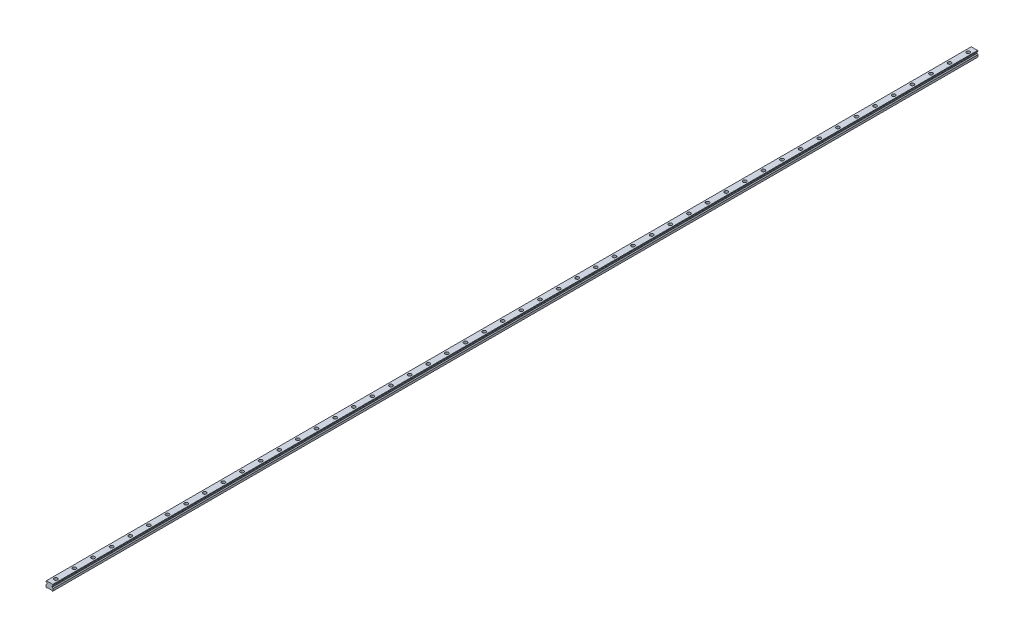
ISO-10303-21;
HEADER;
FILE_DESCRIPTION(('STEP AP214'),'2;1');
FILE_NAME('part.step','',(''),(''),'','','');
FILE_SCHEMA(('AUTOMOTIVE_DESIGN { 1 0 10303 214 1 1 1 1 }'));
ENDSEC;
DATA;
#1=APPLICATION_CONTEXT('core data for automotive mechanical design processes');
#2=APPLICATION_PROTOCOL_DEFINITION('international standard','automotive_design',2000,#1);
#3=PRODUCT_CONTEXT('',#1,'mechanical');
#4=PRODUCT('Part','Part','',(#3));
#5=PRODUCT_RELATED_PRODUCT_CATEGORY('part','',(#4));
#6=PRODUCT_DEFINITION_FORMATION('','',#4);
#7=PRODUCT_DEFINITION_CONTEXT('part definition',#1,'design');
#8=PRODUCT_DEFINITION('design','',#6,#7);
#9=PRODUCT_DEFINITION_SHAPE('','',#8);
#10=(LENGTH_UNIT() NAMED_UNIT(*) SI_UNIT(.MILLI.,.METRE.));
#11=(NAMED_UNIT(*) PLANE_ANGLE_UNIT() SI_UNIT($,.RADIAN.));
#12=(NAMED_UNIT(*) SI_UNIT($,.STERADIAN.) SOLID_ANGLE_UNIT());
#13=UNCERTAINTY_MEASURE_WITH_UNIT(LENGTH_MEASURE(1.E-05),#10,'distance_accuracy_value','');
#14=(GEOMETRIC_REPRESENTATION_CONTEXT(3) GLOBAL_UNCERTAINTY_ASSIGNED_CONTEXT((#13)) GLOBAL_UNIT_ASSIGNED_CONTEXT((#10,
#11,#12)) REPRESENTATION_CONTEXT('',''));
#15=CARTESIAN_POINT('',(0.,0.,0.));
#16=DIRECTION('',(0.,0.,1.));
#17=DIRECTION('',(1.,0.,0.));
#18=AXIS2_PLACEMENT_3D('',#15,#16,#17);
#19=CARTESIAN_POINT('',(0.,10.2,-1470.));
#20=DIRECTION('',(0.,1.,0.));
#21=DIRECTION('',(0.,0.,1.));
#22=AXIS2_PLACEMENT_3D('',#19,#20,#21);
#23=PLANE('',#22);
#24=CARTESIAN_POINT('',(0.,10.2,-1470.));
#25=DIRECTION('',(0.,1.,0.));
#26=DIRECTION('',(0.,0.,1.));
#27=AXIS2_PLACEMENT_3D('',#24,#25,#26);
#28=CIRCLE('',#27,3.49999999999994);
#29=CARTESIAN_POINT('',(0.,10.2,-1466.5));
#30=VERTEX_POINT('',#29);
#31=EDGE_CURVE('E743',#30,#30,#28,.T.);
#32=ORIENTED_EDGE('',*,*,#31,.F.);
#33=EDGE_LOOP('',(#32));
#34=FACE_BOUND('',#33,.T.);
#35=CARTESIAN_POINT('',(0.,10.2,-1470.));
#36=DIRECTION('',(0.,1.,0.));
#37=DIRECTION('',(0.,0.,1.));
#38=AXIS2_PLACEMENT_3D('',#35,#36,#37);
#39=CIRCLE('',#38,5.49999999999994);
#40=CARTESIAN_POINT('',(0.,10.2,-1464.5));
#41=VERTEX_POINT('',#40);
#42=EDGE_CURVE('E11',#41,#41,#39,.T.);
#43=ORIENTED_EDGE('',*,*,#42,.T.);
#44=EDGE_LOOP('',(#43));
#45=FACE_BOUND('',#44,.T.);
#46=ADVANCED_FACE('F39',(#34,#45),#23,.T.);
#47=CARTESIAN_POINT('',(0.,10.2,-1470.));
#48=DIRECTION('',(0.,1.,0.));
#49=DIRECTION('',(0.,0.,1.));
#50=AXIS2_PLACEMENT_3D('',#47,#48,#49);
#51=CYLINDRICAL_SURFACE('',#50,5.49999999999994);
#52=ORIENTED_EDGE('',*,*,#42,.F.);
#53=EDGE_LOOP('',(#52));
#54=FACE_BOUND('',#53,.T.);
#55=CARTESIAN_POINT('',(0.,19.2,-1470.));
#56=DIRECTION('',(0.,1.,0.));
#57=DIRECTION('',(0.,0.,1.));
#58=AXIS2_PLACEMENT_3D('',#55,#56,#57);
#59=CIRCLE('',#58,5.49999999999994);
#60=CARTESIAN_POINT('',(0.,19.2,-1464.5));
#61=VERTEX_POINT('',#60);
#62=EDGE_CURVE('E48',#61,#61,#59,.T.);
#63=ORIENTED_EDGE('',*,*,#62,.T.);
#64=EDGE_LOOP('',(#63));
#65=FACE_BOUND('',#64,.T.);
#66=ADVANCED_FACE('F1391',(#54,#65),#51,.F.);
#67=CARTESIAN_POINT('',(0.,10.2,-1410.));
#68=DIRECTION('',(0.,1.,0.));
#69=DIRECTION('',(0.,0.,1.));
#70=AXIS2_PLACEMENT_3D('',#67,#68,#69);
#71=PLANE('',#70);
#72=CARTESIAN_POINT('',(0.,10.2,-1410.));
#73=DIRECTION('',(0.,1.,0.));
#74=DIRECTION('',(0.,0.,1.));
#75=AXIS2_PLACEMENT_3D('',#72,#73,#74);
#76=CIRCLE('',#75,3.49999999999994);
#77=CARTESIAN_POINT('',(0.,10.2,-1406.5));
#78=VERTEX_POINT('',#77);
#79=EDGE_CURVE('E748',#78,#78,#76,.T.);
#80=ORIENTED_EDGE('',*,*,#79,.F.);
#81=EDGE_LOOP('',(#80));
#82=FACE_BOUND('',#81,.T.);
#83=CARTESIAN_POINT('',(0.,10.2,-1410.));
#84=DIRECTION('',(0.,1.,0.));
#85=DIRECTION('',(0.,0.,1.));
#86=AXIS2_PLACEMENT_3D('',#83,#84,#85);
#87=CIRCLE('',#86,5.49999999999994);
#88=CARTESIAN_POINT('',(0.,10.2,-1404.5));
#89=VERTEX_POINT('',#88);
#90=EDGE_CURVE('E727',#89,#89,#87,.T.);
#91=ORIENTED_EDGE('',*,*,#90,.T.);
#92=EDGE_LOOP('',(#91));
#93=FACE_BOUND('',#92,.T.);
#94=ADVANCED_FACE('F1393',(#82,#93),#71,.T.);
#95=CARTESIAN_POINT('',(0.,10.2,-1410.));
#96=DIRECTION('',(0.,1.,0.));
#97=DIRECTION('',(0.,0.,1.));
#98=AXIS2_PLACEMENT_3D('',#95,#96,#97);
#99=CYLINDRICAL_SURFACE('',#98,5.49999999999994);
#100=ORIENTED_EDGE('',*,*,#90,.F.);
#101=EDGE_LOOP('',(#100));
#102=FACE_BOUND('',#101,.T.);
#103=CARTESIAN_POINT('',(0.,19.2,-1410.));
#104=DIRECTION('',(0.,1.,0.));
#105=DIRECTION('',(0.,0.,1.));
#106=AXIS2_PLACEMENT_3D('',#103,#104,#105);
#107=CIRCLE('',#106,5.49999999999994);
#108=CARTESIAN_POINT('',(0.,19.2,-1404.5));
#109=VERTEX_POINT('',#108);
#110=EDGE_CURVE('E723',#109,#109,#107,.T.);
#111=ORIENTED_EDGE('',*,*,#110,.T.);
#112=EDGE_LOOP('',(#111));
#113=FACE_BOUND('',#112,.T.);
#114=ADVANCED_FACE('F1399',(#102,#113),#99,.F.);
#115=CARTESIAN_POINT('',(0.,10.2,-1350.));
#116=DIRECTION('',(0.,1.,0.));
#117=DIRECTION('',(0.,0.,1.));
#118=AXIS2_PLACEMENT_3D('',#115,#116,#117);
#119=PLANE('',#118);
#120=CARTESIAN_POINT('',(0.,10.2,-1350.));
#121=DIRECTION('',(0.,1.,0.));
#122=DIRECTION('',(0.,0.,1.));
#123=AXIS2_PLACEMENT_3D('',#120,#121,#122);
#124=CIRCLE('',#123,3.49999999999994);
#125=CARTESIAN_POINT('',(0.,10.2,-1346.5));
#126=VERTEX_POINT('',#125);
#127=EDGE_CURVE('E753',#126,#126,#124,.T.);
#128=ORIENTED_EDGE('',*,*,#127,.F.);
#129=EDGE_LOOP('',(#128));
#130=FACE_BOUND('',#129,.T.);
#131=CARTESIAN_POINT('',(0.,10.2,-1350.));
#132=DIRECTION('',(0.,1.,0.));
#133=DIRECTION('',(0.,0.,1.));
#134=AXIS2_PLACEMENT_3D('',#131,#132,#133);
#135=CIRCLE('',#134,5.49999999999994);
#136=CARTESIAN_POINT('',(0.,10.2,-1344.5));
#137=VERTEX_POINT('',#136);
#138=EDGE_CURVE('E719',#137,#137,#135,.T.);
#139=ORIENTED_EDGE('',*,*,#138,.T.);
#140=EDGE_LOOP('',(#139));
#141=FACE_BOUND('',#140,.T.);
#142=ADVANCED_FACE('F1407',(#130,#141),#119,.T.);
#143=CARTESIAN_POINT('',(0.,10.2,-1350.));
#144=DIRECTION('',(0.,1.,0.));
#145=DIRECTION('',(0.,0.,1.));
#146=AXIS2_PLACEMENT_3D('',#143,#144,#145);
#147=CYLINDRICAL_SURFACE('',#146,5.49999999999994);
#148=ORIENTED_EDGE('',*,*,#138,.F.);
#149=EDGE_LOOP('',(#148));
#150=FACE_BOUND('',#149,.T.);
#151=CARTESIAN_POINT('',(0.,19.2,-1350.));
#152=DIRECTION('',(0.,1.,0.));
#153=DIRECTION('',(0.,0.,1.));
#154=AXIS2_PLACEMENT_3D('',#151,#152,#153);
#155=CIRCLE('',#154,5.49999999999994);
#156=CARTESIAN_POINT('',(0.,19.2,-1344.5));
#157=VERTEX_POINT('',#156);
#158=EDGE_CURVE('E715',#157,#157,#155,.T.);
#159=ORIENTED_EDGE('',*,*,#158,.T.);
#160=EDGE_LOOP('',(#159));
#161=FACE_BOUND('',#160,.T.);
#162=ADVANCED_FACE('F1411',(#150,#161),#147,.F.);
#163=CARTESIAN_POINT('',(0.,10.2,-1290.));
#164=DIRECTION('',(0.,1.,0.));
#165=DIRECTION('',(0.,0.,1.));
#166=AXIS2_PLACEMENT_3D('',#163,#164,#165);
#167=PLANE('',#166);
#168=CARTESIAN_POINT('',(0.,10.2,-1290.));
#169=DIRECTION('',(0.,1.,0.));
#170=DIRECTION('',(0.,0.,1.));
#171=AXIS2_PLACEMENT_3D('',#168,#169,#170);
#172=CIRCLE('',#171,3.49999999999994);
#173=CARTESIAN_POINT('',(0.,10.2,-1286.5));
#174=VERTEX_POINT('',#173);
#175=EDGE_CURVE('E758',#174,#174,#172,.T.);
#176=ORIENTED_EDGE('',*,*,#175,.F.);
#177=EDGE_LOOP('',(#176));
#178=FACE_BOUND('',#177,.T.);
#179=CARTESIAN_POINT('',(0.,10.2,-1290.));
#180=DIRECTION('',(0.,1.,0.));
#181=DIRECTION('',(0.,0.,1.));
#182=AXIS2_PLACEMENT_3D('',#179,#180,#181);
#183=CIRCLE('',#182,5.49999999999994);
#184=CARTESIAN_POINT('',(0.,10.2,-1284.5));
#185=VERTEX_POINT('',#184);
#186=EDGE_CURVE('E711',#185,#185,#183,.T.);
#187=ORIENTED_EDGE('',*,*,#186,.T.);
#188=EDGE_LOOP('',(#187));
#189=FACE_BOUND('',#188,.T.);
#190=ADVANCED_FACE('F1415',(#178,#189),#167,.T.);
#191=CARTESIAN_POINT('',(0.,10.2,-1290.));
#192=DIRECTION('',(0.,1.,0.));
#193=DIRECTION('',(0.,0.,1.));
#194=AXIS2_PLACEMENT_3D('',#191,#192,#193);
#195=CYLINDRICAL_SURFACE('',#194,5.49999999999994);
#196=ORIENTED_EDGE('',*,*,#186,.F.);
#197=EDGE_LOOP('',(#196));
#198=FACE_BOUND('',#197,.T.);
#199=CARTESIAN_POINT('',(0.,19.2,-1290.));
#200=DIRECTION('',(0.,1.,0.));
#201=DIRECTION('',(0.,0.,1.));
#202=AXIS2_PLACEMENT_3D('',#199,#200,#201);
#203=CIRCLE('',#202,5.49999999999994);
#204=CARTESIAN_POINT('',(0.,19.2,-1284.5));
#205=VERTEX_POINT('',#204);
#206=EDGE_CURVE('E707',#205,#205,#203,.T.);
#207=ORIENTED_EDGE('',*,*,#206,.T.);
#208=EDGE_LOOP('',(#207));
#209=FACE_BOUND('',#208,.T.);
#210=ADVANCED_FACE('F1419',(#198,#209),#195,.F.);
#211=CARTESIAN_POINT('',(0.,10.2,-1230.));
#212=DIRECTION('',(0.,1.,0.));
#213=DIRECTION('',(0.,0.,1.));
#214=AXIS2_PLACEMENT_3D('',#211,#212,#213);
#215=PLANE('',#214);
#216=CARTESIAN_POINT('',(0.,10.2,-1230.));
#217=DIRECTION('',(0.,1.,0.));
#218=DIRECTION('',(0.,0.,1.));
#219=AXIS2_PLACEMENT_3D('',#216,#217,#218);
#220=CIRCLE('',#219,3.49999999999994);
#221=CARTESIAN_POINT('',(0.,10.2,-1226.5));
#222=VERTEX_POINT('',#221);
#223=EDGE_CURVE('E763',#222,#222,#220,.T.);
#224=ORIENTED_EDGE('',*,*,#223,.F.);
#225=EDGE_LOOP('',(#224));
#226=FACE_BOUND('',#225,.T.);
#227=CARTESIAN_POINT('',(0.,10.2,-1230.));
#228=DIRECTION('',(0.,1.,0.));
#229=DIRECTION('',(0.,0.,1.));
#230=AXIS2_PLACEMENT_3D('',#227,#228,#229);
#231=CIRCLE('',#230,5.49999999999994);
#232=CARTESIAN_POINT('',(0.,10.2,-1224.5));
#233=VERTEX_POINT('',#232);
#234=EDGE_CURVE('E703',#233,#233,#231,.T.);
#235=ORIENTED_EDGE('',*,*,#234,.T.);
#236=EDGE_LOOP('',(#235));
#237=FACE_BOUND('',#236,.T.);
#238=ADVANCED_FACE('F1423',(#226,#237),#215,.T.);
#239=CARTESIAN_POINT('',(0.,10.2,-1230.));
#240=DIRECTION('',(0.,1.,0.));
#241=DIRECTION('',(0.,0.,1.));
#242=AXIS2_PLACEMENT_3D('',#239,#240,#241);
#243=CYLINDRICAL_SURFACE('',#242,5.49999999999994);
#244=ORIENTED_EDGE('',*,*,#234,.F.);
#245=EDGE_LOOP('',(#244));
#246=FACE_BOUND('',#245,.T.);
#247=CARTESIAN_POINT('',(0.,19.2,-1230.));
#248=DIRECTION('',(0.,1.,0.));
#249=DIRECTION('',(0.,0.,1.));
#250=AXIS2_PLACEMENT_3D('',#247,#248,#249);
#251=CIRCLE('',#250,5.49999999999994);
#252=CARTESIAN_POINT('',(0.,19.2,-1224.5));
#253=VERTEX_POINT('',#252);
#254=EDGE_CURVE('E699',#253,#253,#251,.T.);
#255=ORIENTED_EDGE('',*,*,#254,.T.);
#256=EDGE_LOOP('',(#255));
#257=FACE_BOUND('',#256,.T.);
#258=ADVANCED_FACE('F1427',(#246,#257),#243,.F.);
#259=CARTESIAN_POINT('',(0.,10.2,-1170.));
#260=DIRECTION('',(0.,1.,0.));
#261=DIRECTION('',(0.,0.,1.));
#262=AXIS2_PLACEMENT_3D('',#259,#260,#261);
#263=PLANE('',#262);
#264=CARTESIAN_POINT('',(0.,10.2,-1170.));
#265=DIRECTION('',(0.,1.,0.));
#266=DIRECTION('',(0.,0.,1.));
#267=AXIS2_PLACEMENT_3D('',#264,#265,#266);
#268=CIRCLE('',#267,3.49999999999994);
#269=CARTESIAN_POINT('',(0.,10.2,-1166.5));
#270=VERTEX_POINT('',#269);
#271=EDGE_CURVE('E768',#270,#270,#268,.T.);
#272=ORIENTED_EDGE('',*,*,#271,.F.);
#273=EDGE_LOOP('',(#272));
#274=FACE_BOUND('',#273,.T.);
#275=CARTESIAN_POINT('',(0.,10.2,-1170.));
#276=DIRECTION('',(0.,1.,0.));
#277=DIRECTION('',(0.,0.,1.));
#278=AXIS2_PLACEMENT_3D('',#275,#276,#277);
#279=CIRCLE('',#278,5.49999999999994);
#280=CARTESIAN_POINT('',(0.,10.2,-1164.5));
#281=VERTEX_POINT('',#280);
#282=EDGE_CURVE('E695',#281,#281,#279,.T.);
#283=ORIENTED_EDGE('',*,*,#282,.T.);
#284=EDGE_LOOP('',(#283));
#285=FACE_BOUND('',#284,.T.);
#286=ADVANCED_FACE('F1431',(#274,#285),#263,.T.);
#287=CARTESIAN_POINT('',(0.,10.2,-1170.));
#288=DIRECTION('',(0.,1.,0.));
#289=DIRECTION('',(0.,0.,1.));
#290=AXIS2_PLACEMENT_3D('',#287,#288,#289);
#291=CYLINDRICAL_SURFACE('',#290,5.49999999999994);
#292=ORIENTED_EDGE('',*,*,#282,.F.);
#293=EDGE_LOOP('',(#292));
#294=FACE_BOUND('',#293,.T.);
#295=CARTESIAN_POINT('',(0.,19.2,-1170.));
#296=DIRECTION('',(0.,1.,0.));
#297=DIRECTION('',(0.,0.,1.));
#298=AXIS2_PLACEMENT_3D('',#295,#296,#297);
#299=CIRCLE('',#298,5.49999999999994);
#300=CARTESIAN_POINT('',(0.,19.2,-1164.5));
#301=VERTEX_POINT('',#300);
#302=EDGE_CURVE('E691',#301,#301,#299,.T.);
#303=ORIENTED_EDGE('',*,*,#302,.T.);
#304=EDGE_LOOP('',(#303));
#305=FACE_BOUND('',#304,.T.);
#306=ADVANCED_FACE('F1435',(#294,#305),#291,.F.);
#307=CARTESIAN_POINT('',(0.,10.2,-1110.));
#308=DIRECTION('',(0.,1.,0.));
#309=DIRECTION('',(0.,0.,1.));
#310=AXIS2_PLACEMENT_3D('',#307,#308,#309);
#311=PLANE('',#310);
#312=CARTESIAN_POINT('',(0.,10.2,-1110.));
#313=DIRECTION('',(0.,1.,0.));
#314=DIRECTION('',(0.,0.,1.));
#315=AXIS2_PLACEMENT_3D('',#312,#313,#314);
#316=CIRCLE('',#315,3.49999999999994);
#317=CARTESIAN_POINT('',(0.,10.2,-1106.5));
#318=VERTEX_POINT('',#317);
#319=EDGE_CURVE('E773',#318,#318,#316,.T.);
#320=ORIENTED_EDGE('',*,*,#319,.F.);
#321=EDGE_LOOP('',(#320));
#322=FACE_BOUND('',#321,.T.);
#323=CARTESIAN_POINT('',(0.,10.2,-1110.));
#324=DIRECTION('',(0.,1.,0.));
#325=DIRECTION('',(0.,0.,1.));
#326=AXIS2_PLACEMENT_3D('',#323,#324,#325);
#327=CIRCLE('',#326,5.49999999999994);
#328=CARTESIAN_POINT('',(0.,10.2,-1104.5));
#329=VERTEX_POINT('',#328);
#330=EDGE_CURVE('E687',#329,#329,#327,.T.);
#331=ORIENTED_EDGE('',*,*,#330,.T.);
#332=EDGE_LOOP('',(#331));
#333=FACE_BOUND('',#332,.T.);
#334=ADVANCED_FACE('F1439',(#322,#333),#311,.T.);
#335=CARTESIAN_POINT('',(0.,10.2,-1110.));
#336=DIRECTION('',(0.,1.,0.));
#337=DIRECTION('',(0.,0.,1.));
#338=AXIS2_PLACEMENT_3D('',#335,#336,#337);
#339=CYLINDRICAL_SURFACE('',#338,5.49999999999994);
#340=ORIENTED_EDGE('',*,*,#330,.F.);
#341=EDGE_LOOP('',(#340));
#342=FACE_BOUND('',#341,.T.);
#343=CARTESIAN_POINT('',(0.,19.2,-1110.));
#344=DIRECTION('',(0.,1.,0.));
#345=DIRECTION('',(0.,0.,1.));
#346=AXIS2_PLACEMENT_3D('',#343,#344,#345);
#347=CIRCLE('',#346,5.49999999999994);
#348=CARTESIAN_POINT('',(0.,19.2,-1104.5));
#349=VERTEX_POINT('',#348);
#350=EDGE_CURVE('E683',#349,#349,#347,.T.);
#351=ORIENTED_EDGE('',*,*,#350,.T.);
#352=EDGE_LOOP('',(#351));
#353=FACE_BOUND('',#352,.T.);
#354=ADVANCED_FACE('F1443',(#342,#353),#339,.F.);
#355=CARTESIAN_POINT('',(0.,10.2,-1050.));
#356=DIRECTION('',(0.,1.,0.));
#357=DIRECTION('',(0.,0.,1.));
#358=AXIS2_PLACEMENT_3D('',#355,#356,#357);
#359=PLANE('',#358);
#360=CARTESIAN_POINT('',(0.,10.2,-1050.));
#361=DIRECTION('',(0.,1.,0.));
#362=DIRECTION('',(0.,0.,1.));
#363=AXIS2_PLACEMENT_3D('',#360,#361,#362);
#364=CIRCLE('',#363,3.49999999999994);
#365=CARTESIAN_POINT('',(0.,10.2,-1046.5));
#366=VERTEX_POINT('',#365);
#367=EDGE_CURVE('E778',#366,#366,#364,.T.);
#368=ORIENTED_EDGE('',*,*,#367,.F.);
#369=EDGE_LOOP('',(#368));
#370=FACE_BOUND('',#369,.T.);
#371=CARTESIAN_POINT('',(0.,10.2,-1050.));
#372=DIRECTION('',(0.,1.,0.));
#373=DIRECTION('',(0.,0.,1.));
#374=AXIS2_PLACEMENT_3D('',#371,#372,#373);
#375=CIRCLE('',#374,5.49999999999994);
#376=CARTESIAN_POINT('',(0.,10.2,-1044.5));
#377=VERTEX_POINT('',#376);
#378=EDGE_CURVE('E679',#377,#377,#375,.T.);
#379=ORIENTED_EDGE('',*,*,#378,.T.);
#380=EDGE_LOOP('',(#379));
#381=FACE_BOUND('',#380,.T.);
#382=ADVANCED_FACE('F1447',(#370,#381),#359,.T.);
#383=CARTESIAN_POINT('',(0.,10.2,-1050.));
#384=DIRECTION('',(0.,1.,0.));
#385=DIRECTION('',(0.,0.,1.));
#386=AXIS2_PLACEMENT_3D('',#383,#384,#385);
#387=CYLINDRICAL_SURFACE('',#386,5.49999999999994);
#388=ORIENTED_EDGE('',*,*,#378,.F.);
#389=EDGE_LOOP('',(#388));
#390=FACE_BOUND('',#389,.T.);
#391=CARTESIAN_POINT('',(0.,19.2,-1050.));
#392=DIRECTION('',(0.,1.,0.));
#393=DIRECTION('',(0.,0.,1.));
#394=AXIS2_PLACEMENT_3D('',#391,#392,#393);
#395=CIRCLE('',#394,5.49999999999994);
#396=CARTESIAN_POINT('',(0.,19.2,-1044.5));
#397=VERTEX_POINT('',#396);
#398=EDGE_CURVE('E675',#397,#397,#395,.T.);
#399=ORIENTED_EDGE('',*,*,#398,.T.);
#400=EDGE_LOOP('',(#399));
#401=FACE_BOUND('',#400,.T.);
#402=ADVANCED_FACE('F1451',(#390,#401),#387,.F.);
#403=CARTESIAN_POINT('',(0.,10.2,-990.));
#404=DIRECTION('',(0.,1.,0.));
#405=DIRECTION('',(0.,0.,1.));
#406=AXIS2_PLACEMENT_3D('',#403,#404,#405);
#407=PLANE('',#406);
#408=CARTESIAN_POINT('',(0.,10.2,-990.));
#409=DIRECTION('',(0.,1.,0.));
#410=DIRECTION('',(0.,0.,1.));
#411=AXIS2_PLACEMENT_3D('',#408,#409,#410);
#412=CIRCLE('',#411,3.49999999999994);
#413=CARTESIAN_POINT('',(0.,10.2,-986.5));
#414=VERTEX_POINT('',#413);
#415=EDGE_CURVE('E783',#414,#414,#412,.T.);
#416=ORIENTED_EDGE('',*,*,#415,.F.);
#417=EDGE_LOOP('',(#416));
#418=FACE_BOUND('',#417,.T.);
#419=CARTESIAN_POINT('',(0.,10.2,-990.));
#420=DIRECTION('',(0.,1.,0.));
#421=DIRECTION('',(0.,0.,1.));
#422=AXIS2_PLACEMENT_3D('',#419,#420,#421);
#423=CIRCLE('',#422,5.49999999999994);
#424=CARTESIAN_POINT('',(0.,10.2,-984.5));
#425=VERTEX_POINT('',#424);
#426=EDGE_CURVE('E671',#425,#425,#423,.T.);
#427=ORIENTED_EDGE('',*,*,#426,.T.);
#428=EDGE_LOOP('',(#427));
#429=FACE_BOUND('',#428,.T.);
#430=ADVANCED_FACE('F1455',(#418,#429),#407,.T.);
#431=CARTESIAN_POINT('',(0.,10.2,-990.));
#432=DIRECTION('',(0.,1.,0.));
#433=DIRECTION('',(0.,0.,1.));
#434=AXIS2_PLACEMENT_3D('',#431,#432,#433);
#435=CYLINDRICAL_SURFACE('',#434,5.49999999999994);
#436=ORIENTED_EDGE('',*,*,#426,.F.);
#437=EDGE_LOOP('',(#436));
#438=FACE_BOUND('',#437,.T.);
#439=CARTESIAN_POINT('',(0.,19.2,-990.));
#440=DIRECTION('',(0.,1.,0.));
#441=DIRECTION('',(0.,0.,1.));
#442=AXIS2_PLACEMENT_3D('',#439,#440,#441);
#443=CIRCLE('',#442,5.49999999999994);
#444=CARTESIAN_POINT('',(0.,19.2,-984.5));
#445=VERTEX_POINT('',#444);
#446=EDGE_CURVE('E667',#445,#445,#443,.T.);
#447=ORIENTED_EDGE('',*,*,#446,.T.);
#448=EDGE_LOOP('',(#447));
#449=FACE_BOUND('',#448,.T.);
#450=ADVANCED_FACE('F1459',(#438,#449),#435,.F.);
#451=CARTESIAN_POINT('',(0.,10.2,-930.));
#452=DIRECTION('',(0.,1.,0.));
#453=DIRECTION('',(0.,0.,1.));
#454=AXIS2_PLACEMENT_3D('',#451,#452,#453);
#455=PLANE('',#454);
#456=CARTESIAN_POINT('',(0.,10.2,-930.));
#457=DIRECTION('',(0.,1.,0.));
#458=DIRECTION('',(0.,0.,1.));
#459=AXIS2_PLACEMENT_3D('',#456,#457,#458);
#460=CIRCLE('',#459,3.49999999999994);
#461=CARTESIAN_POINT('',(0.,10.2,-926.5));
#462=VERTEX_POINT('',#461);
#463=EDGE_CURVE('E788',#462,#462,#460,.T.);
#464=ORIENTED_EDGE('',*,*,#463,.F.);
#465=EDGE_LOOP('',(#464));
#466=FACE_BOUND('',#465,.T.);
#467=CARTESIAN_POINT('',(0.,10.2,-930.));
#468=DIRECTION('',(0.,1.,0.));
#469=DIRECTION('',(0.,0.,1.));
#470=AXIS2_PLACEMENT_3D('',#467,#468,#469);
#471=CIRCLE('',#470,5.49999999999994);
#472=CARTESIAN_POINT('',(0.,10.2,-924.5));
#473=VERTEX_POINT('',#472);
#474=EDGE_CURVE('E663',#473,#473,#471,.T.);
#475=ORIENTED_EDGE('',*,*,#474,.T.);
#476=EDGE_LOOP('',(#475));
#477=FACE_BOUND('',#476,.T.);
#478=ADVANCED_FACE('F1463',(#466,#477),#455,.T.);
#479=CARTESIAN_POINT('',(0.,10.2,-930.));
#480=DIRECTION('',(0.,1.,0.));
#481=DIRECTION('',(0.,0.,1.));
#482=AXIS2_PLACEMENT_3D('',#479,#480,#481);
#483=CYLINDRICAL_SURFACE('',#482,5.49999999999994);
#484=ORIENTED_EDGE('',*,*,#474,.F.);
#485=EDGE_LOOP('',(#484));
#486=FACE_BOUND('',#485,.T.);
#487=CARTESIAN_POINT('',(0.,19.2,-930.));
#488=DIRECTION('',(0.,1.,0.));
#489=DIRECTION('',(0.,0.,1.));
#490=AXIS2_PLACEMENT_3D('',#487,#488,#489);
#491=CIRCLE('',#490,5.49999999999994);
#492=CARTESIAN_POINT('',(0.,19.2,-924.5));
#493=VERTEX_POINT('',#492);
#494=EDGE_CURVE('E659',#493,#493,#491,.T.);
#495=ORIENTED_EDGE('',*,*,#494,.T.);
#496=EDGE_LOOP('',(#495));
#497=FACE_BOUND('',#496,.T.);
#498=ADVANCED_FACE('F1467',(#486,#497),#483,.F.);
#499=CARTESIAN_POINT('',(0.,10.2,-870.));
#500=DIRECTION('',(0.,1.,0.));
#501=DIRECTION('',(0.,0.,1.));
#502=AXIS2_PLACEMENT_3D('',#499,#500,#501);
#503=PLANE('',#502);
#504=CARTESIAN_POINT('',(0.,10.2,-870.));
#505=DIRECTION('',(0.,1.,0.));
#506=DIRECTION('',(0.,0.,1.));
#507=AXIS2_PLACEMENT_3D('',#504,#505,#506);
#508=CIRCLE('',#507,3.49999999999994);
#509=CARTESIAN_POINT('',(0.,10.2,-866.5));
#510=VERTEX_POINT('',#509);
#511=EDGE_CURVE('E793',#510,#510,#508,.T.);
#512=ORIENTED_EDGE('',*,*,#511,.F.);
#513=EDGE_LOOP('',(#512));
#514=FACE_BOUND('',#513,.T.);
#515=CARTESIAN_POINT('',(0.,10.2,-870.));
#516=DIRECTION('',(0.,1.,0.));
#517=DIRECTION('',(0.,0.,1.));
#518=AXIS2_PLACEMENT_3D('',#515,#516,#517);
#519=CIRCLE('',#518,5.49999999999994);
#520=CARTESIAN_POINT('',(0.,10.2,-864.5));
#521=VERTEX_POINT('',#520);
#522=EDGE_CURVE('E655',#521,#521,#519,.T.);
#523=ORIENTED_EDGE('',*,*,#522,.T.);
#524=EDGE_LOOP('',(#523));
#525=FACE_BOUND('',#524,.T.);
#526=ADVANCED_FACE('F1471',(#514,#525),#503,.T.);
#527=CARTESIAN_POINT('',(0.,10.2,-870.));
#528=DIRECTION('',(0.,1.,0.));
#529=DIRECTION('',(0.,0.,1.));
#530=AXIS2_PLACEMENT_3D('',#527,#528,#529);
#531=CYLINDRICAL_SURFACE('',#530,5.49999999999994);
#532=ORIENTED_EDGE('',*,*,#522,.F.);
#533=EDGE_LOOP('',(#532));
#534=FACE_BOUND('',#533,.T.);
#535=CARTESIAN_POINT('',(0.,19.2,-870.));
#536=DIRECTION('',(0.,1.,0.));
#537=DIRECTION('',(0.,0.,1.));
#538=AXIS2_PLACEMENT_3D('',#535,#536,#537);
#539=CIRCLE('',#538,5.49999999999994);
#540=CARTESIAN_POINT('',(0.,19.2,-864.5));
#541=VERTEX_POINT('',#540);
#542=EDGE_CURVE('E651',#541,#541,#539,.T.);
#543=ORIENTED_EDGE('',*,*,#542,.T.);
#544=EDGE_LOOP('',(#543));
#545=FACE_BOUND('',#544,.T.);
#546=ADVANCED_FACE('F1475',(#534,#545),#531,.F.);
#547=CARTESIAN_POINT('',(0.,10.2,-810.));
#548=DIRECTION('',(0.,1.,0.));
#549=DIRECTION('',(0.,0.,1.));
#550=AXIS2_PLACEMENT_3D('',#547,#548,#549);
#551=PLANE('',#550);
#552=CARTESIAN_POINT('',(0.,10.2,-810.));
#553=DIRECTION('',(0.,1.,0.));
#554=DIRECTION('',(0.,0.,1.));
#555=AXIS2_PLACEMENT_3D('',#552,#553,#554);
#556=CIRCLE('',#555,3.49999999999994);
#557=CARTESIAN_POINT('',(0.,10.2,-806.5));
#558=VERTEX_POINT('',#557);
#559=EDGE_CURVE('E798',#558,#558,#556,.T.);
#560=ORIENTED_EDGE('',*,*,#559,.F.);
#561=EDGE_LOOP('',(#560));
#562=FACE_BOUND('',#561,.T.);
#563=CARTESIAN_POINT('',(0.,10.2,-810.));
#564=DIRECTION('',(0.,1.,0.));
#565=DIRECTION('',(0.,0.,1.));
#566=AXIS2_PLACEMENT_3D('',#563,#564,#565);
#567=CIRCLE('',#566,5.49999999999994);
#568=CARTESIAN_POINT('',(0.,10.2,-804.5));
#569=VERTEX_POINT('',#568);
#570=EDGE_CURVE('E647',#569,#569,#567,.T.);
#571=ORIENTED_EDGE('',*,*,#570,.T.);
#572=EDGE_LOOP('',(#571));
#573=FACE_BOUND('',#572,.T.);
#574=ADVANCED_FACE('F1479',(#562,#573),#551,.T.);
#575=CARTESIAN_POINT('',(0.,10.2,-810.));
#576=DIRECTION('',(0.,1.,0.));
#577=DIRECTION('',(0.,0.,1.));
#578=AXIS2_PLACEMENT_3D('',#575,#576,#577);
#579=CYLINDRICAL_SURFACE('',#578,5.49999999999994);
#580=ORIENTED_EDGE('',*,*,#570,.F.);
#581=EDGE_LOOP('',(#580));
#582=FACE_BOUND('',#581,.T.);
#583=CARTESIAN_POINT('',(0.,19.2,-810.));
#584=DIRECTION('',(0.,1.,0.));
#585=DIRECTION('',(0.,0.,1.));
#586=AXIS2_PLACEMENT_3D('',#583,#584,#585);
#587=CIRCLE('',#586,5.49999999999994);
#588=CARTESIAN_POINT('',(0.,19.2,-804.5));
#589=VERTEX_POINT('',#588);
#590=EDGE_CURVE('E643',#589,#589,#587,.T.);
#591=ORIENTED_EDGE('',*,*,#590,.T.);
#592=EDGE_LOOP('',(#591));
#593=FACE_BOUND('',#592,.T.);
#594=ADVANCED_FACE('F1483',(#582,#593),#579,.F.);
#595=CARTESIAN_POINT('',(0.,10.2,-750.));
#596=DIRECTION('',(0.,1.,0.));
#597=DIRECTION('',(0.,0.,1.));
#598=AXIS2_PLACEMENT_3D('',#595,#596,#597);
#599=PLANE('',#598);
#600=CARTESIAN_POINT('',(0.,10.2,-750.));
#601=DIRECTION('',(0.,1.,0.));
#602=DIRECTION('',(0.,0.,1.));
#603=AXIS2_PLACEMENT_3D('',#600,#601,#602);
#604=CIRCLE('',#603,3.49999999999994);
#605=CARTESIAN_POINT('',(0.,10.2,-746.5));
#606=VERTEX_POINT('',#605);
#607=EDGE_CURVE('E803',#606,#606,#604,.T.);
#608=ORIENTED_EDGE('',*,*,#607,.F.);
#609=EDGE_LOOP('',(#608));
#610=FACE_BOUND('',#609,.T.);
#611=CARTESIAN_POINT('',(0.,10.2,-750.));
#612=DIRECTION('',(0.,1.,0.));
#613=DIRECTION('',(0.,0.,1.));
#614=AXIS2_PLACEMENT_3D('',#611,#612,#613);
#615=CIRCLE('',#614,5.49999999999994);
#616=CARTESIAN_POINT('',(0.,10.2,-744.5));
#617=VERTEX_POINT('',#616);
#618=EDGE_CURVE('E639',#617,#617,#615,.T.);
#619=ORIENTED_EDGE('',*,*,#618,.T.);
#620=EDGE_LOOP('',(#619));
#621=FACE_BOUND('',#620,.T.);
#622=ADVANCED_FACE('F1487',(#610,#621),#599,.T.);
#623=CARTESIAN_POINT('',(0.,10.2,-750.));
#624=DIRECTION('',(0.,1.,0.));
#625=DIRECTION('',(0.,0.,1.));
#626=AXIS2_PLACEMENT_3D('',#623,#624,#625);
#627=CYLINDRICAL_SURFACE('',#626,5.49999999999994);
#628=ORIENTED_EDGE('',*,*,#618,.F.);
#629=EDGE_LOOP('',(#628));
#630=FACE_BOUND('',#629,.T.);
#631=CARTESIAN_POINT('',(0.,19.2,-750.));
#632=DIRECTION('',(0.,1.,0.));
#633=DIRECTION('',(0.,0.,1.));
#634=AXIS2_PLACEMENT_3D('',#631,#632,#633);
#635=CIRCLE('',#634,5.49999999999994);
#636=CARTESIAN_POINT('',(0.,19.2,-744.5));
#637=VERTEX_POINT('',#636);
#638=EDGE_CURVE('E635',#637,#637,#635,.T.);
#639=ORIENTED_EDGE('',*,*,#638,.T.);
#640=EDGE_LOOP('',(#639));
#641=FACE_BOUND('',#640,.T.);
#642=ADVANCED_FACE('F1491',(#630,#641),#627,.F.);
#643=CARTESIAN_POINT('',(0.,10.2,-690.));
#644=DIRECTION('',(0.,1.,0.));
#645=DIRECTION('',(0.,0.,1.));
#646=AXIS2_PLACEMENT_3D('',#643,#644,#645);
#647=PLANE('',#646);
#648=CARTESIAN_POINT('',(0.,10.2,-690.));
#649=DIRECTION('',(0.,1.,0.));
#650=DIRECTION('',(0.,0.,1.));
#651=AXIS2_PLACEMENT_3D('',#648,#649,#650);
#652=CIRCLE('',#651,3.49999999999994);
#653=CARTESIAN_POINT('',(0.,10.2,-686.5));
#654=VERTEX_POINT('',#653);
#655=EDGE_CURVE('E808',#654,#654,#652,.T.);
#656=ORIENTED_EDGE('',*,*,#655,.F.);
#657=EDGE_LOOP('',(#656));
#658=FACE_BOUND('',#657,.T.);
#659=CARTESIAN_POINT('',(0.,10.2,-690.));
#660=DIRECTION('',(0.,1.,0.));
#661=DIRECTION('',(0.,0.,1.));
#662=AXIS2_PLACEMENT_3D('',#659,#660,#661);
#663=CIRCLE('',#662,5.49999999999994);
#664=CARTESIAN_POINT('',(0.,10.2,-684.5));
#665=VERTEX_POINT('',#664);
#666=EDGE_CURVE('E631',#665,#665,#663,.T.);
#667=ORIENTED_EDGE('',*,*,#666,.T.);
#668=EDGE_LOOP('',(#667));
#669=FACE_BOUND('',#668,.T.);
#670=ADVANCED_FACE('F1495',(#658,#669),#647,.T.);
#671=CARTESIAN_POINT('',(0.,10.2,-690.));
#672=DIRECTION('',(0.,1.,0.));
#673=DIRECTION('',(0.,0.,1.));
#674=AXIS2_PLACEMENT_3D('',#671,#672,#673);
#675=CYLINDRICAL_SURFACE('',#674,5.49999999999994);
#676=ORIENTED_EDGE('',*,*,#666,.F.);
#677=EDGE_LOOP('',(#676));
#678=FACE_BOUND('',#677,.T.);
#679=CARTESIAN_POINT('',(0.,19.2,-690.));
#680=DIRECTION('',(0.,1.,0.));
#681=DIRECTION('',(0.,0.,1.));
#682=AXIS2_PLACEMENT_3D('',#679,#680,#681);
#683=CIRCLE('',#682,5.49999999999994);
#684=CARTESIAN_POINT('',(0.,19.2,-684.5));
#685=VERTEX_POINT('',#684);
#686=EDGE_CURVE('E627',#685,#685,#683,.T.);
#687=ORIENTED_EDGE('',*,*,#686,.T.);
#688=EDGE_LOOP('',(#687));
#689=FACE_BOUND('',#688,.T.);
#690=ADVANCED_FACE('F1499',(#678,#689),#675,.F.);
#691=CARTESIAN_POINT('',(0.,10.2,-630.));
#692=DIRECTION('',(0.,1.,0.));
#693=DIRECTION('',(0.,0.,1.));
#694=AXIS2_PLACEMENT_3D('',#691,#692,#693);
#695=PLANE('',#694);
#696=CARTESIAN_POINT('',(0.,10.2,-630.));
#697=DIRECTION('',(0.,1.,0.));
#698=DIRECTION('',(0.,0.,1.));
#699=AXIS2_PLACEMENT_3D('',#696,#697,#698);
#700=CIRCLE('',#699,3.49999999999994);
#701=CARTESIAN_POINT('',(0.,10.2,-626.5));
#702=VERTEX_POINT('',#701);
#703=EDGE_CURVE('E813',#702,#702,#700,.T.);
#704=ORIENTED_EDGE('',*,*,#703,.F.);
#705=EDGE_LOOP('',(#704));
#706=FACE_BOUND('',#705,.T.);
#707=CARTESIAN_POINT('',(0.,10.2,-630.));
#708=DIRECTION('',(0.,1.,0.));
#709=DIRECTION('',(0.,0.,1.));
#710=AXIS2_PLACEMENT_3D('',#707,#708,#709);
#711=CIRCLE('',#710,5.49999999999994);
#712=CARTESIAN_POINT('',(0.,10.2,-624.5));
#713=VERTEX_POINT('',#712);
#714=EDGE_CURVE('E623',#713,#713,#711,.T.);
#715=ORIENTED_EDGE('',*,*,#714,.T.);
#716=EDGE_LOOP('',(#715));
#717=FACE_BOUND('',#716,.T.);
#718=ADVANCED_FACE('F1503',(#706,#717),#695,.T.);
#719=CARTESIAN_POINT('',(0.,10.2,-630.));
#720=DIRECTION('',(0.,1.,0.));
#721=DIRECTION('',(0.,0.,1.));
#722=AXIS2_PLACEMENT_3D('',#719,#720,#721);
#723=CYLINDRICAL_SURFACE('',#722,5.49999999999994);
#724=ORIENTED_EDGE('',*,*,#714,.F.);
#725=EDGE_LOOP('',(#724));
#726=FACE_BOUND('',#725,.T.);
#727=CARTESIAN_POINT('',(0.,19.2,-630.));
#728=DIRECTION('',(0.,1.,0.));
#729=DIRECTION('',(0.,0.,1.));
#730=AXIS2_PLACEMENT_3D('',#727,#728,#729);
#731=CIRCLE('',#730,5.49999999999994);
#732=CARTESIAN_POINT('',(0.,19.2,-624.5));
#733=VERTEX_POINT('',#732);
#734=EDGE_CURVE('E619',#733,#733,#731,.T.);
#735=ORIENTED_EDGE('',*,*,#734,.T.);
#736=EDGE_LOOP('',(#735));
#737=FACE_BOUND('',#736,.T.);
#738=ADVANCED_FACE('F1507',(#726,#737),#723,.F.);
#739=CARTESIAN_POINT('',(0.,10.2,-570.));
#740=DIRECTION('',(0.,1.,0.));
#741=DIRECTION('',(0.,0.,1.));
#742=AXIS2_PLACEMENT_3D('',#739,#740,#741);
#743=PLANE('',#742);
#744=CARTESIAN_POINT('',(0.,10.2,-570.));
#745=DIRECTION('',(0.,1.,0.));
#746=DIRECTION('',(0.,0.,1.));
#747=AXIS2_PLACEMENT_3D('',#744,#745,#746);
#748=CIRCLE('',#747,3.49999999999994);
#749=CARTESIAN_POINT('',(0.,10.2,-566.5));
#750=VERTEX_POINT('',#749);
#751=EDGE_CURVE('E818',#750,#750,#748,.T.);
#752=ORIENTED_EDGE('',*,*,#751,.F.);
#753=EDGE_LOOP('',(#752));
#754=FACE_BOUND('',#753,.T.);
#755=CARTESIAN_POINT('',(0.,10.2,-570.));
#756=DIRECTION('',(0.,1.,0.));
#757=DIRECTION('',(0.,0.,1.));
#758=AXIS2_PLACEMENT_3D('',#755,#756,#757);
#759=CIRCLE('',#758,5.49999999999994);
#760=CARTESIAN_POINT('',(0.,10.2,-564.5));
#761=VERTEX_POINT('',#760);
#762=EDGE_CURVE('E615',#761,#761,#759,.T.);
#763=ORIENTED_EDGE('',*,*,#762,.T.);
#764=EDGE_LOOP('',(#763));
#765=FACE_BOUND('',#764,.T.);
#766=ADVANCED_FACE('F1511',(#754,#765),#743,.T.);
#767=CARTESIAN_POINT('',(0.,10.2,-570.));
#768=DIRECTION('',(0.,1.,0.));
#769=DIRECTION('',(0.,0.,1.));
#770=AXIS2_PLACEMENT_3D('',#767,#768,#769);
#771=CYLINDRICAL_SURFACE('',#770,5.49999999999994);
#772=ORIENTED_EDGE('',*,*,#762,.F.);
#773=EDGE_LOOP('',(#772));
#774=FACE_BOUND('',#773,.T.);
#775=CARTESIAN_POINT('',(0.,19.2,-570.));
#776=DIRECTION('',(0.,1.,0.));
#777=DIRECTION('',(0.,0.,1.));
#778=AXIS2_PLACEMENT_3D('',#775,#776,#777);
#779=CIRCLE('',#778,5.49999999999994);
#780=CARTESIAN_POINT('',(0.,19.2,-564.5));
#781=VERTEX_POINT('',#780);
#782=EDGE_CURVE('E611',#781,#781,#779,.T.);
#783=ORIENTED_EDGE('',*,*,#782,.T.);
#784=EDGE_LOOP('',(#783));
#785=FACE_BOUND('',#784,.T.);
#786=ADVANCED_FACE('F1515',(#774,#785),#771,.F.);
#787=CARTESIAN_POINT('',(0.,10.2,-510.));
#788=DIRECTION('',(0.,1.,0.));
#789=DIRECTION('',(0.,0.,1.));
#790=AXIS2_PLACEMENT_3D('',#787,#788,#789);
#791=PLANE('',#790);
#792=CARTESIAN_POINT('',(0.,10.2,-510.));
#793=DIRECTION('',(0.,1.,0.));
#794=DIRECTION('',(0.,0.,1.));
#795=AXIS2_PLACEMENT_3D('',#792,#793,#794);
#796=CIRCLE('',#795,3.49999999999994);
#797=CARTESIAN_POINT('',(0.,10.2,-506.5));
#798=VERTEX_POINT('',#797);
#799=EDGE_CURVE('E823',#798,#798,#796,.T.);
#800=ORIENTED_EDGE('',*,*,#799,.F.);
#801=EDGE_LOOP('',(#800));
#802=FACE_BOUND('',#801,.T.);
#803=CARTESIAN_POINT('',(0.,10.2,-510.));
#804=DIRECTION('',(0.,1.,0.));
#805=DIRECTION('',(0.,0.,1.));
#806=AXIS2_PLACEMENT_3D('',#803,#804,#805);
#807=CIRCLE('',#806,5.49999999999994);
#808=CARTESIAN_POINT('',(0.,10.2,-504.5));
#809=VERTEX_POINT('',#808);
#810=EDGE_CURVE('E607',#809,#809,#807,.T.);
#811=ORIENTED_EDGE('',*,*,#810,.T.);
#812=EDGE_LOOP('',(#811));
#813=FACE_BOUND('',#812,.T.);
#814=ADVANCED_FACE('F1519',(#802,#813),#791,.T.);
#815=CARTESIAN_POINT('',(0.,10.2,-510.));
#816=DIRECTION('',(0.,1.,0.));
#817=DIRECTION('',(0.,0.,1.));
#818=AXIS2_PLACEMENT_3D('',#815,#816,#817);
#819=CYLINDRICAL_SURFACE('',#818,5.49999999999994);
#820=ORIENTED_EDGE('',*,*,#810,.F.);
#821=EDGE_LOOP('',(#820));
#822=FACE_BOUND('',#821,.T.);
#823=CARTESIAN_POINT('',(0.,19.2,-510.));
#824=DIRECTION('',(0.,1.,0.));
#825=DIRECTION('',(0.,0.,1.));
#826=AXIS2_PLACEMENT_3D('',#823,#824,#825);
#827=CIRCLE('',#826,5.49999999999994);
#828=CARTESIAN_POINT('',(0.,19.2,-504.5));
#829=VERTEX_POINT('',#828);
#830=EDGE_CURVE('E603',#829,#829,#827,.T.);
#831=ORIENTED_EDGE('',*,*,#830,.T.);
#832=EDGE_LOOP('',(#831));
#833=FACE_BOUND('',#832,.T.);
#834=ADVANCED_FACE('F1523',(#822,#833),#819,.F.);
#835=CARTESIAN_POINT('',(0.,10.2,-450.));
#836=DIRECTION('',(0.,1.,0.));
#837=DIRECTION('',(0.,0.,1.));
#838=AXIS2_PLACEMENT_3D('',#835,#836,#837);
#839=PLANE('',#838);
#840=CARTESIAN_POINT('',(0.,10.2,-450.));
#841=DIRECTION('',(0.,1.,0.));
#842=DIRECTION('',(0.,0.,1.));
#843=AXIS2_PLACEMENT_3D('',#840,#841,#842);
#844=CIRCLE('',#843,3.49999999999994);
#845=CARTESIAN_POINT('',(0.,10.2,-446.5));
#846=VERTEX_POINT('',#845);
#847=EDGE_CURVE('E828',#846,#846,#844,.T.);
#848=ORIENTED_EDGE('',*,*,#847,.F.);
#849=EDGE_LOOP('',(#848));
#850=FACE_BOUND('',#849,.T.);
#851=CARTESIAN_POINT('',(0.,10.2,-450.));
#852=DIRECTION('',(0.,1.,0.));
#853=DIRECTION('',(0.,0.,1.));
#854=AXIS2_PLACEMENT_3D('',#851,#852,#853);
#855=CIRCLE('',#854,5.49999999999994);
#856=CARTESIAN_POINT('',(0.,10.2,-444.5));
#857=VERTEX_POINT('',#856);
#858=EDGE_CURVE('E599',#857,#857,#855,.T.);
#859=ORIENTED_EDGE('',*,*,#858,.T.);
#860=EDGE_LOOP('',(#859));
#861=FACE_BOUND('',#860,.T.);
#862=ADVANCED_FACE('F1527',(#850,#861),#839,.T.);
#863=CARTESIAN_POINT('',(0.,10.2,-450.));
#864=DIRECTION('',(0.,1.,0.));
#865=DIRECTION('',(0.,0.,1.));
#866=AXIS2_PLACEMENT_3D('',#863,#864,#865);
#867=CYLINDRICAL_SURFACE('',#866,5.49999999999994);
#868=ORIENTED_EDGE('',*,*,#858,.F.);
#869=EDGE_LOOP('',(#868));
#870=FACE_BOUND('',#869,.T.);
#871=CARTESIAN_POINT('',(0.,19.2,-450.));
#872=DIRECTION('',(0.,1.,0.));
#873=DIRECTION('',(0.,0.,1.));
#874=AXIS2_PLACEMENT_3D('',#871,#872,#873);
#875=CIRCLE('',#874,5.49999999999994);
#876=CARTESIAN_POINT('',(0.,19.2,-444.5));
#877=VERTEX_POINT('',#876);
#878=EDGE_CURVE('E595',#877,#877,#875,.T.);
#879=ORIENTED_EDGE('',*,*,#878,.T.);
#880=EDGE_LOOP('',(#879));
#881=FACE_BOUND('',#880,.T.);
#882=ADVANCED_FACE('F1531',(#870,#881),#867,.F.);
#883=CARTESIAN_POINT('',(0.,10.2,-390.));
#884=DIRECTION('',(0.,1.,0.));
#885=DIRECTION('',(0.,0.,1.));
#886=AXIS2_PLACEMENT_3D('',#883,#884,#885);
#887=PLANE('',#886);
#888=CARTESIAN_POINT('',(0.,10.2,-390.));
#889=DIRECTION('',(0.,1.,0.));
#890=DIRECTION('',(0.,0.,1.));
#891=AXIS2_PLACEMENT_3D('',#888,#889,#890);
#892=CIRCLE('',#891,3.49999999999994);
#893=CARTESIAN_POINT('',(0.,10.2,-386.5));
#894=VERTEX_POINT('',#893);
#895=EDGE_CURVE('E833',#894,#894,#892,.T.);
#896=ORIENTED_EDGE('',*,*,#895,.F.);
#897=EDGE_LOOP('',(#896));
#898=FACE_BOUND('',#897,.T.);
#899=CARTESIAN_POINT('',(0.,10.2,-390.));
#900=DIRECTION('',(0.,1.,0.));
#901=DIRECTION('',(0.,0.,1.));
#902=AXIS2_PLACEMENT_3D('',#899,#900,#901);
#903=CIRCLE('',#902,5.49999999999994);
#904=CARTESIAN_POINT('',(0.,10.2,-384.5));
#905=VERTEX_POINT('',#904);
#906=EDGE_CURVE('E591',#905,#905,#903,.T.);
#907=ORIENTED_EDGE('',*,*,#906,.T.);
#908=EDGE_LOOP('',(#907));
#909=FACE_BOUND('',#908,.T.);
#910=ADVANCED_FACE('F1535',(#898,#909),#887,.T.);
#911=CARTESIAN_POINT('',(0.,10.2,-390.));
#912=DIRECTION('',(0.,1.,0.));
#913=DIRECTION('',(0.,0.,1.));
#914=AXIS2_PLACEMENT_3D('',#911,#912,#913);
#915=CYLINDRICAL_SURFACE('',#914,5.49999999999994);
#916=ORIENTED_EDGE('',*,*,#906,.F.);
#917=EDGE_LOOP('',(#916));
#918=FACE_BOUND('',#917,.T.);
#919=CARTESIAN_POINT('',(0.,19.2,-390.));
#920=DIRECTION('',(0.,1.,0.));
#921=DIRECTION('',(0.,0.,1.));
#922=AXIS2_PLACEMENT_3D('',#919,#920,#921);
#923=CIRCLE('',#922,5.49999999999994);
#924=CARTESIAN_POINT('',(0.,19.2,-384.5));
#925=VERTEX_POINT('',#924);
#926=EDGE_CURVE('E587',#925,#925,#923,.T.);
#927=ORIENTED_EDGE('',*,*,#926,.T.);
#928=EDGE_LOOP('',(#927));
#929=FACE_BOUND('',#928,.T.);
#930=ADVANCED_FACE('F1539',(#918,#929),#915,.F.);
#931=CARTESIAN_POINT('',(0.,10.2,-330.));
#932=DIRECTION('',(0.,1.,0.));
#933=DIRECTION('',(0.,0.,1.));
#934=AXIS2_PLACEMENT_3D('',#931,#932,#933);
#935=PLANE('',#934);
#936=CARTESIAN_POINT('',(0.,10.2,-330.));
#937=DIRECTION('',(0.,1.,0.));
#938=DIRECTION('',(0.,0.,1.));
#939=AXIS2_PLACEMENT_3D('',#936,#937,#938);
#940=CIRCLE('',#939,3.49999999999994);
#941=CARTESIAN_POINT('',(0.,10.2,-326.5));
#942=VERTEX_POINT('',#941);
#943=EDGE_CURVE('E838',#942,#942,#940,.T.);
#944=ORIENTED_EDGE('',*,*,#943,.F.);
#945=EDGE_LOOP('',(#944));
#946=FACE_BOUND('',#945,.T.);
#947=CARTESIAN_POINT('',(0.,10.2,-330.));
#948=DIRECTION('',(0.,1.,0.));
#949=DIRECTION('',(0.,0.,1.));
#950=AXIS2_PLACEMENT_3D('',#947,#948,#949);
#951=CIRCLE('',#950,5.49999999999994);
#952=CARTESIAN_POINT('',(0.,10.2,-324.5));
#953=VERTEX_POINT('',#952);
#954=EDGE_CURVE('E583',#953,#953,#951,.T.);
#955=ORIENTED_EDGE('',*,*,#954,.T.);
#956=EDGE_LOOP('',(#955));
#957=FACE_BOUND('',#956,.T.);
#958=ADVANCED_FACE('F1543',(#946,#957),#935,.T.);
#959=CARTESIAN_POINT('',(0.,10.2,-330.));
#960=DIRECTION('',(0.,1.,0.));
#961=DIRECTION('',(0.,0.,1.));
#962=AXIS2_PLACEMENT_3D('',#959,#960,#961);
#963=CYLINDRICAL_SURFACE('',#962,5.49999999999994);
#964=ORIENTED_EDGE('',*,*,#954,.F.);
#965=EDGE_LOOP('',(#964));
#966=FACE_BOUND('',#965,.T.);
#967=CARTESIAN_POINT('',(0.,19.2,-330.));
#968=DIRECTION('',(0.,1.,0.));
#969=DIRECTION('',(0.,0.,1.));
#970=AXIS2_PLACEMENT_3D('',#967,#968,#969);
#971=CIRCLE('',#970,5.49999999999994);
#972=CARTESIAN_POINT('',(0.,19.2,-324.5));
#973=VERTEX_POINT('',#972);
#974=EDGE_CURVE('E579',#973,#973,#971,.T.);
#975=ORIENTED_EDGE('',*,*,#974,.T.);
#976=EDGE_LOOP('',(#975));
#977=FACE_BOUND('',#976,.T.);
#978=ADVANCED_FACE('F1547',(#966,#977),#963,.F.);
#979=CARTESIAN_POINT('',(0.,10.2,-270.));
#980=DIRECTION('',(0.,1.,0.));
#981=DIRECTION('',(0.,0.,1.));
#982=AXIS2_PLACEMENT_3D('',#979,#980,#981);
#983=PLANE('',#982);
#984=CARTESIAN_POINT('',(0.,10.2,-270.));
#985=DIRECTION('',(0.,1.,0.));
#986=DIRECTION('',(0.,0.,1.));
#987=AXIS2_PLACEMENT_3D('',#984,#985,#986);
#988=CIRCLE('',#987,3.49999999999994);
#989=CARTESIAN_POINT('',(0.,10.2,-266.5));
#990=VERTEX_POINT('',#989);
#991=EDGE_CURVE('E843',#990,#990,#988,.T.);
#992=ORIENTED_EDGE('',*,*,#991,.F.);
#993=EDGE_LOOP('',(#992));
#994=FACE_BOUND('',#993,.T.);
#995=CARTESIAN_POINT('',(0.,10.2,-270.));
#996=DIRECTION('',(0.,1.,0.));
#997=DIRECTION('',(0.,0.,1.));
#998=AXIS2_PLACEMENT_3D('',#995,#996,#997);
#999=CIRCLE('',#998,5.49999999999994);
#1000=CARTESIAN_POINT('',(0.,10.2,-264.5));
#1001=VERTEX_POINT('',#1000);
#1002=EDGE_CURVE('E575',#1001,#1001,#999,.T.);
#1003=ORIENTED_EDGE('',*,*,#1002,.T.);
#1004=EDGE_LOOP('',(#1003));
#1005=FACE_BOUND('',#1004,.T.);
#1006=ADVANCED_FACE('F1551',(#994,#1005),#983,.T.);
#1007=CARTESIAN_POINT('',(0.,10.2,-270.));
#1008=DIRECTION('',(0.,1.,0.));
#1009=DIRECTION('',(0.,0.,1.));
#1010=AXIS2_PLACEMENT_3D('',#1007,#1008,#1009);
#1011=CYLINDRICAL_SURFACE('',#1010,5.49999999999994);
#1012=ORIENTED_EDGE('',*,*,#1002,.F.);
#1013=EDGE_LOOP('',(#1012));
#1014=FACE_BOUND('',#1013,.T.);
#1015=CARTESIAN_POINT('',(0.,19.2,-270.));
#1016=DIRECTION('',(0.,1.,0.));
#1017=DIRECTION('',(0.,0.,1.));
#1018=AXIS2_PLACEMENT_3D('',#1015,#1016,#1017);
#1019=CIRCLE('',#1018,5.49999999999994);
#1020=CARTESIAN_POINT('',(0.,19.2,-264.5));
#1021=VERTEX_POINT('',#1020);
#1022=EDGE_CURVE('E571',#1021,#1021,#1019,.T.);
#1023=ORIENTED_EDGE('',*,*,#1022,.T.);
#1024=EDGE_LOOP('',(#1023));
#1025=FACE_BOUND('',#1024,.T.);
#1026=ADVANCED_FACE('F1555',(#1014,#1025),#1011,.F.);
#1027=CARTESIAN_POINT('',(0.,10.2,-210.));
#1028=DIRECTION('',(0.,1.,0.));
#1029=DIRECTION('',(0.,0.,1.));
#1030=AXIS2_PLACEMENT_3D('',#1027,#1028,#1029);
#1031=PLANE('',#1030);
#1032=CARTESIAN_POINT('',(0.,10.2,-210.));
#1033=DIRECTION('',(0.,1.,0.));
#1034=DIRECTION('',(0.,0.,1.));
#1035=AXIS2_PLACEMENT_3D('',#1032,#1033,#1034);
#1036=CIRCLE('',#1035,3.49999999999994);
#1037=CARTESIAN_POINT('',(0.,10.2,-206.5));
#1038=VERTEX_POINT('',#1037);
#1039=EDGE_CURVE('E848',#1038,#1038,#1036,.T.);
#1040=ORIENTED_EDGE('',*,*,#1039,.F.);
#1041=EDGE_LOOP('',(#1040));
#1042=FACE_BOUND('',#1041,.T.);
#1043=CARTESIAN_POINT('',(0.,10.2,-210.));
#1044=DIRECTION('',(0.,1.,0.));
#1045=DIRECTION('',(0.,0.,1.));
#1046=AXIS2_PLACEMENT_3D('',#1043,#1044,#1045);
#1047=CIRCLE('',#1046,5.49999999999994);
#1048=CARTESIAN_POINT('',(0.,10.2,-204.5));
#1049=VERTEX_POINT('',#1048);
#1050=EDGE_CURVE('E567',#1049,#1049,#1047,.T.);
#1051=ORIENTED_EDGE('',*,*,#1050,.T.);
#1052=EDGE_LOOP('',(#1051));
#1053=FACE_BOUND('',#1052,.T.);
#1054=ADVANCED_FACE('F1559',(#1042,#1053),#1031,.T.);
#1055=CARTESIAN_POINT('',(0.,10.2,-210.));
#1056=DIRECTION('',(0.,1.,0.));
#1057=DIRECTION('',(0.,0.,1.));
#1058=AXIS2_PLACEMENT_3D('',#1055,#1056,#1057);
#1059=CYLINDRICAL_SURFACE('',#1058,5.49999999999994);
#1060=ORIENTED_EDGE('',*,*,#1050,.F.);
#1061=EDGE_LOOP('',(#1060));
#1062=FACE_BOUND('',#1061,.T.);
#1063=CARTESIAN_POINT('',(0.,19.2,-210.));
#1064=DIRECTION('',(0.,1.,0.));
#1065=DIRECTION('',(0.,0.,1.));
#1066=AXIS2_PLACEMENT_3D('',#1063,#1064,#1065);
#1067=CIRCLE('',#1066,5.49999999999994);
#1068=CARTESIAN_POINT('',(0.,19.2,-204.5));
#1069=VERTEX_POINT('',#1068);
#1070=EDGE_CURVE('E563',#1069,#1069,#1067,.T.);
#1071=ORIENTED_EDGE('',*,*,#1070,.T.);
#1072=EDGE_LOOP('',(#1071));
#1073=FACE_BOUND('',#1072,.T.);
#1074=ADVANCED_FACE('F1563',(#1062,#1073),#1059,.F.);
#1075=CARTESIAN_POINT('',(0.,10.2,-150.));
#1076=DIRECTION('',(0.,1.,0.));
#1077=DIRECTION('',(0.,0.,1.));
#1078=AXIS2_PLACEMENT_3D('',#1075,#1076,#1077);
#1079=PLANE('',#1078);
#1080=CARTESIAN_POINT('',(0.,10.2,-150.));
#1081=DIRECTION('',(0.,1.,0.));
#1082=DIRECTION('',(0.,0.,1.));
#1083=AXIS2_PLACEMENT_3D('',#1080,#1081,#1082);
#1084=CIRCLE('',#1083,3.49999999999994);
#1085=CARTESIAN_POINT('',(0.,10.2,-146.5));
#1086=VERTEX_POINT('',#1085);
#1087=EDGE_CURVE('E853',#1086,#1086,#1084,.T.);
#1088=ORIENTED_EDGE('',*,*,#1087,.F.);
#1089=EDGE_LOOP('',(#1088));
#1090=FACE_BOUND('',#1089,.T.);
#1091=CARTESIAN_POINT('',(0.,10.2,-150.));
#1092=DIRECTION('',(0.,1.,0.));
#1093=DIRECTION('',(0.,0.,1.));
#1094=AXIS2_PLACEMENT_3D('',#1091,#1092,#1093);
#1095=CIRCLE('',#1094,5.49999999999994);
#1096=CARTESIAN_POINT('',(0.,10.2,-144.5));
#1097=VERTEX_POINT('',#1096);
#1098=EDGE_CURVE('E559',#1097,#1097,#1095,.T.);
#1099=ORIENTED_EDGE('',*,*,#1098,.T.);
#1100=EDGE_LOOP('',(#1099));
#1101=FACE_BOUND('',#1100,.T.);
#1102=ADVANCED_FACE('F1567',(#1090,#1101),#1079,.T.);
#1103=CARTESIAN_POINT('',(0.,10.2,-150.));
#1104=DIRECTION('',(0.,1.,0.));
#1105=DIRECTION('',(0.,0.,1.));
#1106=AXIS2_PLACEMENT_3D('',#1103,#1104,#1105);
#1107=CYLINDRICAL_SURFACE('',#1106,5.49999999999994);
#1108=ORIENTED_EDGE('',*,*,#1098,.F.);
#1109=EDGE_LOOP('',(#1108));
#1110=FACE_BOUND('',#1109,.T.);
#1111=CARTESIAN_POINT('',(0.,19.2,-150.));
#1112=DIRECTION('',(0.,1.,0.));
#1113=DIRECTION('',(0.,0.,1.));
#1114=AXIS2_PLACEMENT_3D('',#1111,#1112,#1113);
#1115=CIRCLE('',#1114,5.49999999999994);
#1116=CARTESIAN_POINT('',(0.,19.2,-144.5));
#1117=VERTEX_POINT('',#1116);
#1118=EDGE_CURVE('E555',#1117,#1117,#1115,.T.);
#1119=ORIENTED_EDGE('',*,*,#1118,.T.);
#1120=EDGE_LOOP('',(#1119));
#1121=FACE_BOUND('',#1120,.T.);
#1122=ADVANCED_FACE('F1571',(#1110,#1121),#1107,.F.);
#1123=CARTESIAN_POINT('',(0.,10.2,-90.0000000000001));
#1124=DIRECTION('',(0.,1.,0.));
#1125=DIRECTION('',(0.,0.,1.));
#1126=AXIS2_PLACEMENT_3D('',#1123,#1124,#1125);
#1127=PLANE('',#1126);
#1128=CARTESIAN_POINT('',(0.,10.2,-90.0000000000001));
#1129=DIRECTION('',(0.,1.,0.));
#1130=DIRECTION('',(0.,0.,1.));
#1131=AXIS2_PLACEMENT_3D('',#1128,#1129,#1130);
#1132=CIRCLE('',#1131,3.49999999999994);
#1133=CARTESIAN_POINT('',(0.,10.2,-86.5000000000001));
#1134=VERTEX_POINT('',#1133);
#1135=EDGE_CURVE('E858',#1134,#1134,#1132,.T.);
#1136=ORIENTED_EDGE('',*,*,#1135,.F.);
#1137=EDGE_LOOP('',(#1136));
#1138=FACE_BOUND('',#1137,.T.);
#1139=CARTESIAN_POINT('',(0.,10.2,-90.0000000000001));
#1140=DIRECTION('',(0.,1.,0.));
#1141=DIRECTION('',(0.,0.,1.));
#1142=AXIS2_PLACEMENT_3D('',#1139,#1140,#1141);
#1143=CIRCLE('',#1142,5.49999999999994);
#1144=CARTESIAN_POINT('',(0.,10.2,-84.5000000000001));
#1145=VERTEX_POINT('',#1144);
#1146=EDGE_CURVE('E551',#1145,#1145,#1143,.T.);
#1147=ORIENTED_EDGE('',*,*,#1146,.T.);
#1148=EDGE_LOOP('',(#1147));
#1149=FACE_BOUND('',#1148,.T.);
#1150=ADVANCED_FACE('F1575',(#1138,#1149),#1127,.T.);
#1151=CARTESIAN_POINT('',(0.,10.2,-90.0000000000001));
#1152=DIRECTION('',(0.,1.,0.));
#1153=DIRECTION('',(0.,0.,1.));
#1154=AXIS2_PLACEMENT_3D('',#1151,#1152,#1153);
#1155=CYLINDRICAL_SURFACE('',#1154,5.49999999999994);
#1156=ORIENTED_EDGE('',*,*,#1146,.F.);
#1157=EDGE_LOOP('',(#1156));
#1158=FACE_BOUND('',#1157,.T.);
#1159=CARTESIAN_POINT('',(0.,19.2,-90.0000000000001));
#1160=DIRECTION('',(0.,1.,0.));
#1161=DIRECTION('',(0.,0.,1.));
#1162=AXIS2_PLACEMENT_3D('',#1159,#1160,#1161);
#1163=CIRCLE('',#1162,5.49999999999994);
#1164=CARTESIAN_POINT('',(0.,19.2,-84.5000000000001));
#1165=VERTEX_POINT('',#1164);
#1166=EDGE_CURVE('E547',#1165,#1165,#1163,.T.);
#1167=ORIENTED_EDGE('',*,*,#1166,.T.);
#1168=EDGE_LOOP('',(#1167));
#1169=FACE_BOUND('',#1168,.T.);
#1170=ADVANCED_FACE('F1579',(#1158,#1169),#1155,.F.);
#1171=CARTESIAN_POINT('',(0.,10.2,-30.));
#1172=DIRECTION('',(0.,1.,0.));
#1173=DIRECTION('',(0.,0.,1.));
#1174=AXIS2_PLACEMENT_3D('',#1171,#1172,#1173);
#1175=PLANE('',#1174);
#1176=CARTESIAN_POINT('',(0.,10.2,-30.));
#1177=DIRECTION('',(0.,1.,0.));
#1178=DIRECTION('',(0.,0.,1.));
#1179=AXIS2_PLACEMENT_3D('',#1176,#1177,#1178);
#1180=CIRCLE('',#1179,3.49999999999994);
#1181=CARTESIAN_POINT('',(0.,10.2,-26.5000000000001));
#1182=VERTEX_POINT('',#1181);
#1183=EDGE_CURVE('E863',#1182,#1182,#1180,.T.);
#1184=ORIENTED_EDGE('',*,*,#1183,.F.);
#1185=EDGE_LOOP('',(#1184));
#1186=FACE_BOUND('',#1185,.T.);
#1187=CARTESIAN_POINT('',(0.,10.2,-30.));
#1188=DIRECTION('',(0.,1.,0.));
#1189=DIRECTION('',(0.,0.,1.));
#1190=AXIS2_PLACEMENT_3D('',#1187,#1188,#1189);
#1191=CIRCLE('',#1190,5.49999999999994);
#1192=CARTESIAN_POINT('',(0.,10.2,-24.5000000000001));
#1193=VERTEX_POINT('',#1192);
#1194=EDGE_CURVE('E543',#1193,#1193,#1191,.T.);
#1195=ORIENTED_EDGE('',*,*,#1194,.T.);
#1196=EDGE_LOOP('',(#1195));
#1197=FACE_BOUND('',#1196,.T.);
#1198=ADVANCED_FACE('F1583',(#1186,#1197),#1175,.T.);
#1199=CARTESIAN_POINT('',(0.,10.2,-30.));
#1200=DIRECTION('',(0.,1.,0.));
#1201=DIRECTION('',(0.,0.,1.));
#1202=AXIS2_PLACEMENT_3D('',#1199,#1200,#1201);
#1203=CYLINDRICAL_SURFACE('',#1202,5.49999999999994);
#1204=ORIENTED_EDGE('',*,*,#1194,.F.);
#1205=EDGE_LOOP('',(#1204));
#1206=FACE_BOUND('',#1205,.T.);
#1207=CARTESIAN_POINT('',(0.,19.2,-30.));
#1208=DIRECTION('',(0.,1.,0.));
#1209=DIRECTION('',(0.,0.,1.));
#1210=AXIS2_PLACEMENT_3D('',#1207,#1208,#1209);
#1211=CIRCLE('',#1210,5.49999999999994);
#1212=CARTESIAN_POINT('',(0.,19.2,-24.5000000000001));
#1213=VERTEX_POINT('',#1212);
#1214=EDGE_CURVE('E539',#1213,#1213,#1211,.T.);
#1215=ORIENTED_EDGE('',*,*,#1214,.T.);
#1216=EDGE_LOOP('',(#1215));
#1217=FACE_BOUND('',#1216,.T.);
#1218=ADVANCED_FACE('F1587',(#1206,#1217),#1203,.F.);
#1219=CARTESIAN_POINT('',(0.,10.2,30.));
#1220=DIRECTION('',(0.,1.,0.));
#1221=DIRECTION('',(0.,0.,1.));
#1222=AXIS2_PLACEMENT_3D('',#1219,#1220,#1221);
#1223=PLANE('',#1222);
#1224=CARTESIAN_POINT('',(0.,10.2,30.));
#1225=DIRECTION('',(0.,1.,0.));
#1226=DIRECTION('',(0.,0.,1.));
#1227=AXIS2_PLACEMENT_3D('',#1224,#1225,#1226);
#1228=CIRCLE('',#1227,3.49999999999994);
#1229=CARTESIAN_POINT('',(0.,10.2,33.5));
#1230=VERTEX_POINT('',#1229);
#1231=EDGE_CURVE('E868',#1230,#1230,#1228,.T.);
#1232=ORIENTED_EDGE('',*,*,#1231,.F.);
#1233=EDGE_LOOP('',(#1232));
#1234=FACE_BOUND('',#1233,.T.);
#1235=CARTESIAN_POINT('',(0.,10.2,30.));
#1236=DIRECTION('',(0.,1.,0.));
#1237=DIRECTION('',(0.,0.,1.));
#1238=AXIS2_PLACEMENT_3D('',#1235,#1236,#1237);
#1239=CIRCLE('',#1238,5.49999999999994);
#1240=CARTESIAN_POINT('',(0.,10.2,35.5));
#1241=VERTEX_POINT('',#1240);
#1242=EDGE_CURVE('E535',#1241,#1241,#1239,.T.);
#1243=ORIENTED_EDGE('',*,*,#1242,.T.);
#1244=EDGE_LOOP('',(#1243));
#1245=FACE_BOUND('',#1244,.T.);
#1246=ADVANCED_FACE('F1591',(#1234,#1245),#1223,.T.);
#1247=CARTESIAN_POINT('',(0.,10.2,30.));
#1248=DIRECTION('',(0.,1.,0.));
#1249=DIRECTION('',(0.,0.,1.));
#1250=AXIS2_PLACEMENT_3D('',#1247,#1248,#1249);
#1251=CYLINDRICAL_SURFACE('',#1250,5.49999999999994);
#1252=ORIENTED_EDGE('',*,*,#1242,.F.);
#1253=EDGE_LOOP('',(#1252));
#1254=FACE_BOUND('',#1253,.T.);
#1255=CARTESIAN_POINT('',(0.,19.2,30.));
#1256=DIRECTION('',(0.,1.,0.));
#1257=DIRECTION('',(0.,0.,1.));
#1258=AXIS2_PLACEMENT_3D('',#1255,#1256,#1257);
#1259=CIRCLE('',#1258,5.49999999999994);
#1260=CARTESIAN_POINT('',(0.,19.2,35.5));
#1261=VERTEX_POINT('',#1260);
#1262=EDGE_CURVE('E531',#1261,#1261,#1259,.T.);
#1263=ORIENTED_EDGE('',*,*,#1262,.T.);
#1264=EDGE_LOOP('',(#1263));
#1265=FACE_BOUND('',#1264,.T.);
#1266=ADVANCED_FACE('F1595',(#1254,#1265),#1251,.F.);
#1267=CARTESIAN_POINT('',(0.,10.2,90.0000000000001));
#1268=DIRECTION('',(0.,1.,0.));
#1269=DIRECTION('',(0.,0.,1.));
#1270=AXIS2_PLACEMENT_3D('',#1267,#1268,#1269);
#1271=PLANE('',#1270);
#1272=CARTESIAN_POINT('',(0.,10.2,90.0000000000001));
#1273=DIRECTION('',(0.,1.,0.));
#1274=DIRECTION('',(0.,0.,1.));
#1275=AXIS2_PLACEMENT_3D('',#1272,#1273,#1274);
#1276=CIRCLE('',#1275,3.49999999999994);
#1277=CARTESIAN_POINT('',(0.,10.2,93.5));
#1278=VERTEX_POINT('',#1277);
#1279=EDGE_CURVE('E873',#1278,#1278,#1276,.T.);
#1280=ORIENTED_EDGE('',*,*,#1279,.F.);
#1281=EDGE_LOOP('',(#1280));
#1282=FACE_BOUND('',#1281,.T.);
#1283=CARTESIAN_POINT('',(0.,10.2,90.0000000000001));
#1284=DIRECTION('',(0.,1.,0.));
#1285=DIRECTION('',(0.,0.,1.));
#1286=AXIS2_PLACEMENT_3D('',#1283,#1284,#1285);
#1287=CIRCLE('',#1286,5.49999999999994);
#1288=CARTESIAN_POINT('',(0.,10.2,95.5));
#1289=VERTEX_POINT('',#1288);
#1290=EDGE_CURVE('E527',#1289,#1289,#1287,.T.);
#1291=ORIENTED_EDGE('',*,*,#1290,.T.);
#1292=EDGE_LOOP('',(#1291));
#1293=FACE_BOUND('',#1292,.T.);
#1294=ADVANCED_FACE('F1599',(#1282,#1293),#1271,.T.);
#1295=CARTESIAN_POINT('',(0.,10.2,90.0000000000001));
#1296=DIRECTION('',(0.,1.,0.));
#1297=DIRECTION('',(0.,0.,1.));
#1298=AXIS2_PLACEMENT_3D('',#1295,#1296,#1297);
#1299=CYLINDRICAL_SURFACE('',#1298,5.49999999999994);
#1300=ORIENTED_EDGE('',*,*,#1290,.F.);
#1301=EDGE_LOOP('',(#1300));
#1302=FACE_BOUND('',#1301,.T.);
#1303=CARTESIAN_POINT('',(0.,19.2,90.0000000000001));
#1304=DIRECTION('',(0.,1.,0.));
#1305=DIRECTION('',(0.,0.,1.));
#1306=AXIS2_PLACEMENT_3D('',#1303,#1304,#1305);
#1307=CIRCLE('',#1306,5.49999999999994);
#1308=CARTESIAN_POINT('',(0.,19.2,95.5));
#1309=VERTEX_POINT('',#1308);
#1310=EDGE_CURVE('E523',#1309,#1309,#1307,.T.);
#1311=ORIENTED_EDGE('',*,*,#1310,.T.);
#1312=EDGE_LOOP('',(#1311));
#1313=FACE_BOUND('',#1312,.T.);
#1314=ADVANCED_FACE('F1603',(#1302,#1313),#1299,.F.);
#1315=CARTESIAN_POINT('',(0.,10.2,150.));
#1316=DIRECTION('',(0.,1.,0.));
#1317=DIRECTION('',(0.,0.,1.));
#1318=AXIS2_PLACEMENT_3D('',#1315,#1316,#1317);
#1319=PLANE('',#1318);
#1320=CARTESIAN_POINT('',(0.,10.2,150.));
#1321=DIRECTION('',(0.,1.,0.));
#1322=DIRECTION('',(0.,0.,1.));
#1323=AXIS2_PLACEMENT_3D('',#1320,#1321,#1322);
#1324=CIRCLE('',#1323,3.49999999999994);
#1325=CARTESIAN_POINT('',(0.,10.2,153.5));
#1326=VERTEX_POINT('',#1325);
#1327=EDGE_CURVE('E878',#1326,#1326,#1324,.T.);
#1328=ORIENTED_EDGE('',*,*,#1327,.F.);
#1329=EDGE_LOOP('',(#1328));
#1330=FACE_BOUND('',#1329,.T.);
#1331=CARTESIAN_POINT('',(0.,10.2,150.));
#1332=DIRECTION('',(0.,1.,0.));
#1333=DIRECTION('',(0.,0.,1.));
#1334=AXIS2_PLACEMENT_3D('',#1331,#1332,#1333);
#1335=CIRCLE('',#1334,5.49999999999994);
#1336=CARTESIAN_POINT('',(0.,10.2,155.5));
#1337=VERTEX_POINT('',#1336);
#1338=EDGE_CURVE('E519',#1337,#1337,#1335,.T.);
#1339=ORIENTED_EDGE('',*,*,#1338,.T.);
#1340=EDGE_LOOP('',(#1339));
#1341=FACE_BOUND('',#1340,.T.);
#1342=ADVANCED_FACE('F1607',(#1330,#1341),#1319,.T.);
#1343=CARTESIAN_POINT('',(0.,10.2,150.));
#1344=DIRECTION('',(0.,1.,0.));
#1345=DIRECTION('',(0.,0.,1.));
#1346=AXIS2_PLACEMENT_3D('',#1343,#1344,#1345);
#1347=CYLINDRICAL_SURFACE('',#1346,5.49999999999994);
#1348=ORIENTED_EDGE('',*,*,#1338,.F.);
#1349=EDGE_LOOP('',(#1348));
#1350=FACE_BOUND('',#1349,.T.);
#1351=CARTESIAN_POINT('',(0.,19.2,150.));
#1352=DIRECTION('',(0.,1.,0.));
#1353=DIRECTION('',(0.,0.,1.));
#1354=AXIS2_PLACEMENT_3D('',#1351,#1352,#1353);
#1355=CIRCLE('',#1354,5.49999999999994);
#1356=CARTESIAN_POINT('',(0.,19.2,155.5));
#1357=VERTEX_POINT('',#1356);
#1358=EDGE_CURVE('E515',#1357,#1357,#1355,.T.);
#1359=ORIENTED_EDGE('',*,*,#1358,.T.);
#1360=EDGE_LOOP('',(#1359));
#1361=FACE_BOUND('',#1360,.T.);
#1362=ADVANCED_FACE('F1611',(#1350,#1361),#1347,.F.);
#1363=CARTESIAN_POINT('',(0.,10.2,210.));
#1364=DIRECTION('',(0.,1.,0.));
#1365=DIRECTION('',(0.,0.,1.));
#1366=AXIS2_PLACEMENT_3D('',#1363,#1364,#1365);
#1367=PLANE('',#1366);
#1368=CARTESIAN_POINT('',(0.,10.2,210.));
#1369=DIRECTION('',(0.,1.,0.));
#1370=DIRECTION('',(0.,0.,1.));
#1371=AXIS2_PLACEMENT_3D('',#1368,#1369,#1370);
#1372=CIRCLE('',#1371,3.49999999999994);
#1373=CARTESIAN_POINT('',(0.,10.2,213.5));
#1374=VERTEX_POINT('',#1373);
#1375=EDGE_CURVE('E883',#1374,#1374,#1372,.T.);
#1376=ORIENTED_EDGE('',*,*,#1375,.F.);
#1377=EDGE_LOOP('',(#1376));
#1378=FACE_BOUND('',#1377,.T.);
#1379=CARTESIAN_POINT('',(0.,10.2,210.));
#1380=DIRECTION('',(0.,1.,0.));
#1381=DIRECTION('',(0.,0.,1.));
#1382=AXIS2_PLACEMENT_3D('',#1379,#1380,#1381);
#1383=CIRCLE('',#1382,5.49999999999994);
#1384=CARTESIAN_POINT('',(0.,10.2,215.5));
#1385=VERTEX_POINT('',#1384);
#1386=EDGE_CURVE('E511',#1385,#1385,#1383,.T.);
#1387=ORIENTED_EDGE('',*,*,#1386,.T.);
#1388=EDGE_LOOP('',(#1387));
#1389=FACE_BOUND('',#1388,.T.);
#1390=ADVANCED_FACE('F1615',(#1378,#1389),#1367,.T.);
#1391=CARTESIAN_POINT('',(0.,10.2,210.));
#1392=DIRECTION('',(0.,1.,0.));
#1393=DIRECTION('',(0.,0.,1.));
#1394=AXIS2_PLACEMENT_3D('',#1391,#1392,#1393);
#1395=CYLINDRICAL_SURFACE('',#1394,5.49999999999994);
#1396=ORIENTED_EDGE('',*,*,#1386,.F.);
#1397=EDGE_LOOP('',(#1396));
#1398=FACE_BOUND('',#1397,.T.);
#1399=CARTESIAN_POINT('',(0.,19.2,210.));
#1400=DIRECTION('',(0.,1.,0.));
#1401=DIRECTION('',(0.,0.,1.));
#1402=AXIS2_PLACEMENT_3D('',#1399,#1400,#1401);
#1403=CIRCLE('',#1402,5.49999999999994);
#1404=CARTESIAN_POINT('',(0.,19.2,215.5));
#1405=VERTEX_POINT('',#1404);
#1406=EDGE_CURVE('E507',#1405,#1405,#1403,.T.);
#1407=ORIENTED_EDGE('',*,*,#1406,.T.);
#1408=EDGE_LOOP('',(#1407));
#1409=FACE_BOUND('',#1408,.T.);
#1410=ADVANCED_FACE('F1619',(#1398,#1409),#1395,.F.);
#1411=CARTESIAN_POINT('',(0.,10.2,270.));
#1412=DIRECTION('',(0.,1.,0.));
#1413=DIRECTION('',(0.,0.,1.));
#1414=AXIS2_PLACEMENT_3D('',#1411,#1412,#1413);
#1415=PLANE('',#1414);
#1416=CARTESIAN_POINT('',(0.,10.2,270.));
#1417=DIRECTION('',(0.,1.,0.));
#1418=DIRECTION('',(0.,0.,1.));
#1419=AXIS2_PLACEMENT_3D('',#1416,#1417,#1418);
#1420=CIRCLE('',#1419,3.49999999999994);
#1421=CARTESIAN_POINT('',(0.,10.2,273.5));
#1422=VERTEX_POINT('',#1421);
#1423=EDGE_CURVE('E888',#1422,#1422,#1420,.T.);
#1424=ORIENTED_EDGE('',*,*,#1423,.F.);
#1425=EDGE_LOOP('',(#1424));
#1426=FACE_BOUND('',#1425,.T.);
#1427=CARTESIAN_POINT('',(0.,10.2,270.));
#1428=DIRECTION('',(0.,1.,0.));
#1429=DIRECTION('',(0.,0.,1.));
#1430=AXIS2_PLACEMENT_3D('',#1427,#1428,#1429);
#1431=CIRCLE('',#1430,5.49999999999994);
#1432=CARTESIAN_POINT('',(0.,10.2,275.5));
#1433=VERTEX_POINT('',#1432);
#1434=EDGE_CURVE('E503',#1433,#1433,#1431,.T.);
#1435=ORIENTED_EDGE('',*,*,#1434,.T.);
#1436=EDGE_LOOP('',(#1435));
#1437=FACE_BOUND('',#1436,.T.);
#1438=ADVANCED_FACE('F1623',(#1426,#1437),#1415,.T.);
#1439=CARTESIAN_POINT('',(0.,10.2,270.));
#1440=DIRECTION('',(0.,1.,0.));
#1441=DIRECTION('',(0.,0.,1.));
#1442=AXIS2_PLACEMENT_3D('',#1439,#1440,#1441);
#1443=CYLINDRICAL_SURFACE('',#1442,5.49999999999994);
#1444=ORIENTED_EDGE('',*,*,#1434,.F.);
#1445=EDGE_LOOP('',(#1444));
#1446=FACE_BOUND('',#1445,.T.);
#1447=CARTESIAN_POINT('',(0.,19.2,270.));
#1448=DIRECTION('',(0.,1.,0.));
#1449=DIRECTION('',(0.,0.,1.));
#1450=AXIS2_PLACEMENT_3D('',#1447,#1448,#1449);
#1451=CIRCLE('',#1450,5.49999999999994);
#1452=CARTESIAN_POINT('',(0.,19.2,275.5));
#1453=VERTEX_POINT('',#1452);
#1454=EDGE_CURVE('E499',#1453,#1453,#1451,.T.);
#1455=ORIENTED_EDGE('',*,*,#1454,.T.);
#1456=EDGE_LOOP('',(#1455));
#1457=FACE_BOUND('',#1456,.T.);
#1458=ADVANCED_FACE('F1627',(#1446,#1457),#1443,.F.);
#1459=CARTESIAN_POINT('',(0.,10.2,330.));
#1460=DIRECTION('',(0.,1.,0.));
#1461=DIRECTION('',(0.,0.,1.));
#1462=AXIS2_PLACEMENT_3D('',#1459,#1460,#1461);
#1463=PLANE('',#1462);
#1464=CARTESIAN_POINT('',(0.,10.2,330.));
#1465=DIRECTION('',(0.,1.,0.));
#1466=DIRECTION('',(0.,0.,1.));
#1467=AXIS2_PLACEMENT_3D('',#1464,#1465,#1466);
#1468=CIRCLE('',#1467,3.49999999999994);
#1469=CARTESIAN_POINT('',(0.,10.2,333.5));
#1470=VERTEX_POINT('',#1469);
#1471=EDGE_CURVE('E893',#1470,#1470,#1468,.T.);
#1472=ORIENTED_EDGE('',*,*,#1471,.F.);
#1473=EDGE_LOOP('',(#1472));
#1474=FACE_BOUND('',#1473,.T.);
#1475=CARTESIAN_POINT('',(0.,10.2,330.));
#1476=DIRECTION('',(0.,1.,0.));
#1477=DIRECTION('',(0.,0.,1.));
#1478=AXIS2_PLACEMENT_3D('',#1475,#1476,#1477);
#1479=CIRCLE('',#1478,5.49999999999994);
#1480=CARTESIAN_POINT('',(0.,10.2,335.5));
#1481=VERTEX_POINT('',#1480);
#1482=EDGE_CURVE('E495',#1481,#1481,#1479,.T.);
#1483=ORIENTED_EDGE('',*,*,#1482,.T.);
#1484=EDGE_LOOP('',(#1483));
#1485=FACE_BOUND('',#1484,.T.);
#1486=ADVANCED_FACE('F1631',(#1474,#1485),#1463,.T.);
#1487=CARTESIAN_POINT('',(0.,10.2,330.));
#1488=DIRECTION('',(0.,1.,0.));
#1489=DIRECTION('',(0.,0.,1.));
#1490=AXIS2_PLACEMENT_3D('',#1487,#1488,#1489);
#1491=CYLINDRICAL_SURFACE('',#1490,5.49999999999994);
#1492=ORIENTED_EDGE('',*,*,#1482,.F.);
#1493=EDGE_LOOP('',(#1492));
#1494=FACE_BOUND('',#1493,.T.);
#1495=CARTESIAN_POINT('',(0.,19.2,330.));
#1496=DIRECTION('',(0.,1.,0.));
#1497=DIRECTION('',(0.,0.,1.));
#1498=AXIS2_PLACEMENT_3D('',#1495,#1496,#1497);
#1499=CIRCLE('',#1498,5.49999999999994);
#1500=CARTESIAN_POINT('',(0.,19.2,335.5));
#1501=VERTEX_POINT('',#1500);
#1502=EDGE_CURVE('E491',#1501,#1501,#1499,.T.);
#1503=ORIENTED_EDGE('',*,*,#1502,.T.);
#1504=EDGE_LOOP('',(#1503));
#1505=FACE_BOUND('',#1504,.T.);
#1506=ADVANCED_FACE('F1635',(#1494,#1505),#1491,.F.);
#1507=CARTESIAN_POINT('',(0.,10.2,390.));
#1508=DIRECTION('',(0.,1.,0.));
#1509=DIRECTION('',(0.,0.,1.));
#1510=AXIS2_PLACEMENT_3D('',#1507,#1508,#1509);
#1511=PLANE('',#1510);
#1512=CARTESIAN_POINT('',(0.,10.2,390.));
#1513=DIRECTION('',(0.,1.,0.));
#1514=DIRECTION('',(0.,0.,1.));
#1515=AXIS2_PLACEMENT_3D('',#1512,#1513,#1514);
#1516=CIRCLE('',#1515,3.49999999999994);
#1517=CARTESIAN_POINT('',(0.,10.2,393.5));
#1518=VERTEX_POINT('',#1517);
#1519=EDGE_CURVE('E898',#1518,#1518,#1516,.T.);
#1520=ORIENTED_EDGE('',*,*,#1519,.F.);
#1521=EDGE_LOOP('',(#1520));
#1522=FACE_BOUND('',#1521,.T.);
#1523=CARTESIAN_POINT('',(0.,10.2,390.));
#1524=DIRECTION('',(0.,1.,0.));
#1525=DIRECTION('',(0.,0.,1.));
#1526=AXIS2_PLACEMENT_3D('',#1523,#1524,#1525);
#1527=CIRCLE('',#1526,5.49999999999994);
#1528=CARTESIAN_POINT('',(0.,10.2,395.5));
#1529=VERTEX_POINT('',#1528);
#1530=EDGE_CURVE('E487',#1529,#1529,#1527,.T.);
#1531=ORIENTED_EDGE('',*,*,#1530,.T.);
#1532=EDGE_LOOP('',(#1531));
#1533=FACE_BOUND('',#1532,.T.);
#1534=ADVANCED_FACE('F1639',(#1522,#1533),#1511,.T.);
#1535=CARTESIAN_POINT('',(0.,10.2,390.));
#1536=DIRECTION('',(0.,1.,0.));
#1537=DIRECTION('',(0.,0.,1.));
#1538=AXIS2_PLACEMENT_3D('',#1535,#1536,#1537);
#1539=CYLINDRICAL_SURFACE('',#1538,5.49999999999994);
#1540=ORIENTED_EDGE('',*,*,#1530,.F.);
#1541=EDGE_LOOP('',(#1540));
#1542=FACE_BOUND('',#1541,.T.);
#1543=CARTESIAN_POINT('',(0.,19.2,390.));
#1544=DIRECTION('',(0.,1.,0.));
#1545=DIRECTION('',(0.,0.,1.));
#1546=AXIS2_PLACEMENT_3D('',#1543,#1544,#1545);
#1547=CIRCLE('',#1546,5.49999999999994);
#1548=CARTESIAN_POINT('',(0.,19.2,395.5));
#1549=VERTEX_POINT('',#1548);
#1550=EDGE_CURVE('E483',#1549,#1549,#1547,.T.);
#1551=ORIENTED_EDGE('',*,*,#1550,.T.);
#1552=EDGE_LOOP('',(#1551));
#1553=FACE_BOUND('',#1552,.T.);
#1554=ADVANCED_FACE('F1643',(#1542,#1553),#1539,.F.);
#1555=CARTESIAN_POINT('',(0.,10.2,450.));
#1556=DIRECTION('',(0.,1.,0.));
#1557=DIRECTION('',(0.,0.,1.));
#1558=AXIS2_PLACEMENT_3D('',#1555,#1556,#1557);
#1559=PLANE('',#1558);
#1560=CARTESIAN_POINT('',(0.,10.2,450.));
#1561=DIRECTION('',(0.,1.,0.));
#1562=DIRECTION('',(0.,0.,1.));
#1563=AXIS2_PLACEMENT_3D('',#1560,#1561,#1562);
#1564=CIRCLE('',#1563,3.49999999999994);
#1565=CARTESIAN_POINT('',(0.,10.2,453.5));
#1566=VERTEX_POINT('',#1565);
#1567=EDGE_CURVE('E903',#1566,#1566,#1564,.T.);
#1568=ORIENTED_EDGE('',*,*,#1567,.F.);
#1569=EDGE_LOOP('',(#1568));
#1570=FACE_BOUND('',#1569,.T.);
#1571=CARTESIAN_POINT('',(0.,10.2,450.));
#1572=DIRECTION('',(0.,1.,0.));
#1573=DIRECTION('',(0.,0.,1.));
#1574=AXIS2_PLACEMENT_3D('',#1571,#1572,#1573);
#1575=CIRCLE('',#1574,5.49999999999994);
#1576=CARTESIAN_POINT('',(0.,10.2,455.5));
#1577=VERTEX_POINT('',#1576);
#1578=EDGE_CURVE('E479',#1577,#1577,#1575,.T.);
#1579=ORIENTED_EDGE('',*,*,#1578,.T.);
#1580=EDGE_LOOP('',(#1579));
#1581=FACE_BOUND('',#1580,.T.);
#1582=ADVANCED_FACE('F1647',(#1570,#1581),#1559,.T.);
#1583=CARTESIAN_POINT('',(0.,10.2,450.));
#1584=DIRECTION('',(0.,1.,0.));
#1585=DIRECTION('',(0.,0.,1.));
#1586=AXIS2_PLACEMENT_3D('',#1583,#1584,#1585);
#1587=CYLINDRICAL_SURFACE('',#1586,5.49999999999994);
#1588=ORIENTED_EDGE('',*,*,#1578,.F.);
#1589=EDGE_LOOP('',(#1588));
#1590=FACE_BOUND('',#1589,.T.);
#1591=CARTESIAN_POINT('',(0.,19.2,450.));
#1592=DIRECTION('',(0.,1.,0.));
#1593=DIRECTION('',(0.,0.,1.));
#1594=AXIS2_PLACEMENT_3D('',#1591,#1592,#1593);
#1595=CIRCLE('',#1594,5.49999999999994);
#1596=CARTESIAN_POINT('',(0.,19.2,455.5));
#1597=VERTEX_POINT('',#1596);
#1598=EDGE_CURVE('E475',#1597,#1597,#1595,.T.);
#1599=ORIENTED_EDGE('',*,*,#1598,.T.);
#1600=EDGE_LOOP('',(#1599));
#1601=FACE_BOUND('',#1600,.T.);
#1602=ADVANCED_FACE('F1651',(#1590,#1601),#1587,.F.);
#1603=CARTESIAN_POINT('',(0.,10.2,510.));
#1604=DIRECTION('',(0.,1.,0.));
#1605=DIRECTION('',(0.,0.,1.));
#1606=AXIS2_PLACEMENT_3D('',#1603,#1604,#1605);
#1607=PLANE('',#1606);
#1608=CARTESIAN_POINT('',(0.,10.2,510.));
#1609=DIRECTION('',(0.,1.,0.));
#1610=DIRECTION('',(0.,0.,1.));
#1611=AXIS2_PLACEMENT_3D('',#1608,#1609,#1610);
#1612=CIRCLE('',#1611,3.49999999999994);
#1613=CARTESIAN_POINT('',(0.,10.2,513.5));
#1614=VERTEX_POINT('',#1613);
#1615=EDGE_CURVE('E908',#1614,#1614,#1612,.T.);
#1616=ORIENTED_EDGE('',*,*,#1615,.F.);
#1617=EDGE_LOOP('',(#1616));
#1618=FACE_BOUND('',#1617,.T.);
#1619=CARTESIAN_POINT('',(0.,10.2,510.));
#1620=DIRECTION('',(0.,1.,0.));
#1621=DIRECTION('',(0.,0.,1.));
#1622=AXIS2_PLACEMENT_3D('',#1619,#1620,#1621);
#1623=CIRCLE('',#1622,5.49999999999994);
#1624=CARTESIAN_POINT('',(0.,10.2,515.5));
#1625=VERTEX_POINT('',#1624);
#1626=EDGE_CURVE('E471',#1625,#1625,#1623,.T.);
#1627=ORIENTED_EDGE('',*,*,#1626,.T.);
#1628=EDGE_LOOP('',(#1627));
#1629=FACE_BOUND('',#1628,.T.);
#1630=ADVANCED_FACE('F1655',(#1618,#1629),#1607,.T.);
#1631=CARTESIAN_POINT('',(0.,10.2,510.));
#1632=DIRECTION('',(0.,1.,0.));
#1633=DIRECTION('',(0.,0.,1.));
#1634=AXIS2_PLACEMENT_3D('',#1631,#1632,#1633);
#1635=CYLINDRICAL_SURFACE('',#1634,5.49999999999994);
#1636=ORIENTED_EDGE('',*,*,#1626,.F.);
#1637=EDGE_LOOP('',(#1636));
#1638=FACE_BOUND('',#1637,.T.);
#1639=CARTESIAN_POINT('',(0.,19.2,510.));
#1640=DIRECTION('',(0.,1.,0.));
#1641=DIRECTION('',(0.,0.,1.));
#1642=AXIS2_PLACEMENT_3D('',#1639,#1640,#1641);
#1643=CIRCLE('',#1642,5.49999999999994);
#1644=CARTESIAN_POINT('',(0.,19.2,515.5));
#1645=VERTEX_POINT('',#1644);
#1646=EDGE_CURVE('E467',#1645,#1645,#1643,.T.);
#1647=ORIENTED_EDGE('',*,*,#1646,.T.);
#1648=EDGE_LOOP('',(#1647));
#1649=FACE_BOUND('',#1648,.T.);
#1650=ADVANCED_FACE('F1659',(#1638,#1649),#1635,.F.);
#1651=CARTESIAN_POINT('',(0.,10.2,570.));
#1652=DIRECTION('',(0.,1.,0.));
#1653=DIRECTION('',(0.,0.,1.));
#1654=AXIS2_PLACEMENT_3D('',#1651,#1652,#1653);
#1655=PLANE('',#1654);
#1656=CARTESIAN_POINT('',(0.,10.2,570.));
#1657=DIRECTION('',(0.,1.,0.));
#1658=DIRECTION('',(0.,0.,1.));
#1659=AXIS2_PLACEMENT_3D('',#1656,#1657,#1658);
#1660=CIRCLE('',#1659,3.49999999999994);
#1661=CARTESIAN_POINT('',(0.,10.2,573.5));
#1662=VERTEX_POINT('',#1661);
#1663=EDGE_CURVE('E913',#1662,#1662,#1660,.T.);
#1664=ORIENTED_EDGE('',*,*,#1663,.F.);
#1665=EDGE_LOOP('',(#1664));
#1666=FACE_BOUND('',#1665,.T.);
#1667=CARTESIAN_POINT('',(0.,10.2,570.));
#1668=DIRECTION('',(0.,1.,0.));
#1669=DIRECTION('',(0.,0.,1.));
#1670=AXIS2_PLACEMENT_3D('',#1667,#1668,#1669);
#1671=CIRCLE('',#1670,5.49999999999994);
#1672=CARTESIAN_POINT('',(0.,10.2,575.5));
#1673=VERTEX_POINT('',#1672);
#1674=EDGE_CURVE('E463',#1673,#1673,#1671,.T.);
#1675=ORIENTED_EDGE('',*,*,#1674,.T.);
#1676=EDGE_LOOP('',(#1675));
#1677=FACE_BOUND('',#1676,.T.);
#1678=ADVANCED_FACE('F1663',(#1666,#1677),#1655,.T.);
#1679=CARTESIAN_POINT('',(0.,10.2,570.));
#1680=DIRECTION('',(0.,1.,0.));
#1681=DIRECTION('',(0.,0.,1.));
#1682=AXIS2_PLACEMENT_3D('',#1679,#1680,#1681);
#1683=CYLINDRICAL_SURFACE('',#1682,5.49999999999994);
#1684=ORIENTED_EDGE('',*,*,#1674,.F.);
#1685=EDGE_LOOP('',(#1684));
#1686=FACE_BOUND('',#1685,.T.);
#1687=CARTESIAN_POINT('',(0.,19.2,570.));
#1688=DIRECTION('',(0.,1.,0.));
#1689=DIRECTION('',(0.,0.,1.));
#1690=AXIS2_PLACEMENT_3D('',#1687,#1688,#1689);
#1691=CIRCLE('',#1690,5.49999999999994);
#1692=CARTESIAN_POINT('',(0.,19.2,575.5));
#1693=VERTEX_POINT('',#1692);
#1694=EDGE_CURVE('E459',#1693,#1693,#1691,.T.);
#1695=ORIENTED_EDGE('',*,*,#1694,.T.);
#1696=EDGE_LOOP('',(#1695));
#1697=FACE_BOUND('',#1696,.T.);
#1698=ADVANCED_FACE('F1667',(#1686,#1697),#1683,.F.);
#1699=CARTESIAN_POINT('',(0.,10.2,630.));
#1700=DIRECTION('',(0.,1.,0.));
#1701=DIRECTION('',(0.,0.,1.));
#1702=AXIS2_PLACEMENT_3D('',#1699,#1700,#1701);
#1703=PLANE('',#1702);
#1704=CARTESIAN_POINT('',(0.,10.2,630.));
#1705=DIRECTION('',(0.,1.,0.));
#1706=DIRECTION('',(0.,0.,1.));
#1707=AXIS2_PLACEMENT_3D('',#1704,#1705,#1706);
#1708=CIRCLE('',#1707,3.49999999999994);
#1709=CARTESIAN_POINT('',(0.,10.2,633.5));
#1710=VERTEX_POINT('',#1709);
#1711=EDGE_CURVE('E918',#1710,#1710,#1708,.T.);
#1712=ORIENTED_EDGE('',*,*,#1711,.F.);
#1713=EDGE_LOOP('',(#1712));
#1714=FACE_BOUND('',#1713,.T.);
#1715=CARTESIAN_POINT('',(0.,10.2,630.));
#1716=DIRECTION('',(0.,1.,0.));
#1717=DIRECTION('',(0.,0.,1.));
#1718=AXIS2_PLACEMENT_3D('',#1715,#1716,#1717);
#1719=CIRCLE('',#1718,5.49999999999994);
#1720=CARTESIAN_POINT('',(0.,10.2,635.5));
#1721=VERTEX_POINT('',#1720);
#1722=EDGE_CURVE('E455',#1721,#1721,#1719,.T.);
#1723=ORIENTED_EDGE('',*,*,#1722,.T.);
#1724=EDGE_LOOP('',(#1723));
#1725=FACE_BOUND('',#1724,.T.);
#1726=ADVANCED_FACE('F1671',(#1714,#1725),#1703,.T.);
#1727=CARTESIAN_POINT('',(0.,10.2,630.));
#1728=DIRECTION('',(0.,1.,0.));
#1729=DIRECTION('',(0.,0.,1.));
#1730=AXIS2_PLACEMENT_3D('',#1727,#1728,#1729);
#1731=CYLINDRICAL_SURFACE('',#1730,5.49999999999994);
#1732=ORIENTED_EDGE('',*,*,#1722,.F.);
#1733=EDGE_LOOP('',(#1732));
#1734=FACE_BOUND('',#1733,.T.);
#1735=CARTESIAN_POINT('',(0.,19.2,630.));
#1736=DIRECTION('',(0.,1.,0.));
#1737=DIRECTION('',(0.,0.,1.));
#1738=AXIS2_PLACEMENT_3D('',#1735,#1736,#1737);
#1739=CIRCLE('',#1738,5.49999999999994);
#1740=CARTESIAN_POINT('',(0.,19.2,635.5));
#1741=VERTEX_POINT('',#1740);
#1742=EDGE_CURVE('E451',#1741,#1741,#1739,.T.);
#1743=ORIENTED_EDGE('',*,*,#1742,.T.);
#1744=EDGE_LOOP('',(#1743));
#1745=FACE_BOUND('',#1744,.T.);
#1746=ADVANCED_FACE('F1675',(#1734,#1745),#1731,.F.);
#1747=CARTESIAN_POINT('',(0.,10.2,690.));
#1748=DIRECTION('',(0.,1.,0.));
#1749=DIRECTION('',(0.,0.,1.));
#1750=AXIS2_PLACEMENT_3D('',#1747,#1748,#1749);
#1751=PLANE('',#1750);
#1752=CARTESIAN_POINT('',(0.,10.2,690.));
#1753=DIRECTION('',(0.,1.,0.));
#1754=DIRECTION('',(0.,0.,1.));
#1755=AXIS2_PLACEMENT_3D('',#1752,#1753,#1754);
#1756=CIRCLE('',#1755,3.49999999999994);
#1757=CARTESIAN_POINT('',(0.,10.2,693.5));
#1758=VERTEX_POINT('',#1757);
#1759=EDGE_CURVE('E923',#1758,#1758,#1756,.T.);
#1760=ORIENTED_EDGE('',*,*,#1759,.F.);
#1761=EDGE_LOOP('',(#1760));
#1762=FACE_BOUND('',#1761,.T.);
#1763=CARTESIAN_POINT('',(0.,10.2,690.));
#1764=DIRECTION('',(0.,1.,0.));
#1765=DIRECTION('',(0.,0.,1.));
#1766=AXIS2_PLACEMENT_3D('',#1763,#1764,#1765);
#1767=CIRCLE('',#1766,5.49999999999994);
#1768=CARTESIAN_POINT('',(0.,10.2,695.5));
#1769=VERTEX_POINT('',#1768);
#1770=EDGE_CURVE('E447',#1769,#1769,#1767,.T.);
#1771=ORIENTED_EDGE('',*,*,#1770,.T.);
#1772=EDGE_LOOP('',(#1771));
#1773=FACE_BOUND('',#1772,.T.);
#1774=ADVANCED_FACE('F1679',(#1762,#1773),#1751,.T.);
#1775=CARTESIAN_POINT('',(0.,10.2,690.));
#1776=DIRECTION('',(0.,1.,0.));
#1777=DIRECTION('',(0.,0.,1.));
#1778=AXIS2_PLACEMENT_3D('',#1775,#1776,#1777);
#1779=CYLINDRICAL_SURFACE('',#1778,5.49999999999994);
#1780=ORIENTED_EDGE('',*,*,#1770,.F.);
#1781=EDGE_LOOP('',(#1780));
#1782=FACE_BOUND('',#1781,.T.);
#1783=CARTESIAN_POINT('',(0.,19.2,690.));
#1784=DIRECTION('',(0.,1.,0.));
#1785=DIRECTION('',(0.,0.,1.));
#1786=AXIS2_PLACEMENT_3D('',#1783,#1784,#1785);
#1787=CIRCLE('',#1786,5.49999999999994);
#1788=CARTESIAN_POINT('',(0.,19.2,695.5));
#1789=VERTEX_POINT('',#1788);
#1790=EDGE_CURVE('E443',#1789,#1789,#1787,.T.);
#1791=ORIENTED_EDGE('',*,*,#1790,.T.);
#1792=EDGE_LOOP('',(#1791));
#1793=FACE_BOUND('',#1792,.T.);
#1794=ADVANCED_FACE('F1683',(#1782,#1793),#1779,.F.);
#1795=CARTESIAN_POINT('',(0.,10.2,750.));
#1796=DIRECTION('',(0.,1.,0.));
#1797=DIRECTION('',(0.,0.,1.));
#1798=AXIS2_PLACEMENT_3D('',#1795,#1796,#1797);
#1799=PLANE('',#1798);
#1800=CARTESIAN_POINT('',(0.,10.2,750.));
#1801=DIRECTION('',(0.,1.,0.));
#1802=DIRECTION('',(0.,0.,1.));
#1803=AXIS2_PLACEMENT_3D('',#1800,#1801,#1802);
#1804=CIRCLE('',#1803,3.49999999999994);
#1805=CARTESIAN_POINT('',(0.,10.2,753.5));
#1806=VERTEX_POINT('',#1805);
#1807=EDGE_CURVE('E928',#1806,#1806,#1804,.T.);
#1808=ORIENTED_EDGE('',*,*,#1807,.F.);
#1809=EDGE_LOOP('',(#1808));
#1810=FACE_BOUND('',#1809,.T.);
#1811=CARTESIAN_POINT('',(0.,10.2,750.));
#1812=DIRECTION('',(0.,1.,0.));
#1813=DIRECTION('',(0.,0.,1.));
#1814=AXIS2_PLACEMENT_3D('',#1811,#1812,#1813);
#1815=CIRCLE('',#1814,5.49999999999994);
#1816=CARTESIAN_POINT('',(0.,10.2,755.5));
#1817=VERTEX_POINT('',#1816);
#1818=EDGE_CURVE('E439',#1817,#1817,#1815,.T.);
#1819=ORIENTED_EDGE('',*,*,#1818,.T.);
#1820=EDGE_LOOP('',(#1819));
#1821=FACE_BOUND('',#1820,.T.);
#1822=ADVANCED_FACE('F1687',(#1810,#1821),#1799,.T.);
#1823=CARTESIAN_POINT('',(0.,10.2,750.));
#1824=DIRECTION('',(0.,1.,0.));
#1825=DIRECTION('',(0.,0.,1.));
#1826=AXIS2_PLACEMENT_3D('',#1823,#1824,#1825);
#1827=CYLINDRICAL_SURFACE('',#1826,5.49999999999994);
#1828=ORIENTED_EDGE('',*,*,#1818,.F.);
#1829=EDGE_LOOP('',(#1828));
#1830=FACE_BOUND('',#1829,.T.);
#1831=CARTESIAN_POINT('',(0.,19.2,750.));
#1832=DIRECTION('',(0.,1.,0.));
#1833=DIRECTION('',(0.,0.,1.));
#1834=AXIS2_PLACEMENT_3D('',#1831,#1832,#1833);
#1835=CIRCLE('',#1834,5.49999999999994);
#1836=CARTESIAN_POINT('',(0.,19.2,755.5));
#1837=VERTEX_POINT('',#1836);
#1838=EDGE_CURVE('E435',#1837,#1837,#1835,.T.);
#1839=ORIENTED_EDGE('',*,*,#1838,.T.);
#1840=EDGE_LOOP('',(#1839));
#1841=FACE_BOUND('',#1840,.T.);
#1842=ADVANCED_FACE('F1691',(#1830,#1841),#1827,.F.);
#1843=CARTESIAN_POINT('',(0.,10.2,810.));
#1844=DIRECTION('',(0.,1.,0.));
#1845=DIRECTION('',(0.,0.,1.));
#1846=AXIS2_PLACEMENT_3D('',#1843,#1844,#1845);
#1847=PLANE('',#1846);
#1848=CARTESIAN_POINT('',(0.,10.2,810.));
#1849=DIRECTION('',(0.,1.,0.));
#1850=DIRECTION('',(0.,0.,1.));
#1851=AXIS2_PLACEMENT_3D('',#1848,#1849,#1850);
#1852=CIRCLE('',#1851,3.49999999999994);
#1853=CARTESIAN_POINT('',(0.,10.2,813.5));
#1854=VERTEX_POINT('',#1853);
#1855=EDGE_CURVE('E933',#1854,#1854,#1852,.T.);
#1856=ORIENTED_EDGE('',*,*,#1855,.F.);
#1857=EDGE_LOOP('',(#1856));
#1858=FACE_BOUND('',#1857,.T.);
#1859=CARTESIAN_POINT('',(0.,10.2,810.));
#1860=DIRECTION('',(0.,1.,0.));
#1861=DIRECTION('',(0.,0.,1.));
#1862=AXIS2_PLACEMENT_3D('',#1859,#1860,#1861);
#1863=CIRCLE('',#1862,5.49999999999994);
#1864=CARTESIAN_POINT('',(0.,10.2,815.5));
#1865=VERTEX_POINT('',#1864);
#1866=EDGE_CURVE('E431',#1865,#1865,#1863,.T.);
#1867=ORIENTED_EDGE('',*,*,#1866,.T.);
#1868=EDGE_LOOP('',(#1867));
#1869=FACE_BOUND('',#1868,.T.);
#1870=ADVANCED_FACE('F1695',(#1858,#1869),#1847,.T.);
#1871=CARTESIAN_POINT('',(0.,10.2,810.));
#1872=DIRECTION('',(0.,1.,0.));
#1873=DIRECTION('',(0.,0.,1.));
#1874=AXIS2_PLACEMENT_3D('',#1871,#1872,#1873);
#1875=CYLINDRICAL_SURFACE('',#1874,5.49999999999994);
#1876=ORIENTED_EDGE('',*,*,#1866,.F.);
#1877=EDGE_LOOP('',(#1876));
#1878=FACE_BOUND('',#1877,.T.);
#1879=CARTESIAN_POINT('',(0.,19.2,810.));
#1880=DIRECTION('',(0.,1.,0.));
#1881=DIRECTION('',(0.,0.,1.));
#1882=AXIS2_PLACEMENT_3D('',#1879,#1880,#1881);
#1883=CIRCLE('',#1882,5.49999999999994);
#1884=CARTESIAN_POINT('',(0.,19.2,815.5));
#1885=VERTEX_POINT('',#1884);
#1886=EDGE_CURVE('E427',#1885,#1885,#1883,.T.);
#1887=ORIENTED_EDGE('',*,*,#1886,.T.);
#1888=EDGE_LOOP('',(#1887));
#1889=FACE_BOUND('',#1888,.T.);
#1890=ADVANCED_FACE('F1699',(#1878,#1889),#1875,.F.);
#1891=CARTESIAN_POINT('',(0.,10.2,870.));
#1892=DIRECTION('',(0.,1.,0.));
#1893=DIRECTION('',(0.,0.,1.));
#1894=AXIS2_PLACEMENT_3D('',#1891,#1892,#1893);
#1895=PLANE('',#1894);
#1896=CARTESIAN_POINT('',(0.,10.2,870.));
#1897=DIRECTION('',(0.,1.,0.));
#1898=DIRECTION('',(0.,0.,1.));
#1899=AXIS2_PLACEMENT_3D('',#1896,#1897,#1898);
#1900=CIRCLE('',#1899,3.49999999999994);
#1901=CARTESIAN_POINT('',(0.,10.2,873.5));
#1902=VERTEX_POINT('',#1901);
#1903=EDGE_CURVE('E938',#1902,#1902,#1900,.T.);
#1904=ORIENTED_EDGE('',*,*,#1903,.F.);
#1905=EDGE_LOOP('',(#1904));
#1906=FACE_BOUND('',#1905,.T.);
#1907=CARTESIAN_POINT('',(0.,10.2,870.));
#1908=DIRECTION('',(0.,1.,0.));
#1909=DIRECTION('',(0.,0.,1.));
#1910=AXIS2_PLACEMENT_3D('',#1907,#1908,#1909);
#1911=CIRCLE('',#1910,5.49999999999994);
#1912=CARTESIAN_POINT('',(0.,10.2,875.5));
#1913=VERTEX_POINT('',#1912);
#1914=EDGE_CURVE('E423',#1913,#1913,#1911,.T.);
#1915=ORIENTED_EDGE('',*,*,#1914,.T.);
#1916=EDGE_LOOP('',(#1915));
#1917=FACE_BOUND('',#1916,.T.);
#1918=ADVANCED_FACE('F1703',(#1906,#1917),#1895,.T.);
#1919=CARTESIAN_POINT('',(0.,10.2,870.));
#1920=DIRECTION('',(0.,1.,0.));
#1921=DIRECTION('',(0.,0.,1.));
#1922=AXIS2_PLACEMENT_3D('',#1919,#1920,#1921);
#1923=CYLINDRICAL_SURFACE('',#1922,5.49999999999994);
#1924=ORIENTED_EDGE('',*,*,#1914,.F.);
#1925=EDGE_LOOP('',(#1924));
#1926=FACE_BOUND('',#1925,.T.);
#1927=CARTESIAN_POINT('',(0.,19.2,870.));
#1928=DIRECTION('',(0.,1.,0.));
#1929=DIRECTION('',(0.,0.,1.));
#1930=AXIS2_PLACEMENT_3D('',#1927,#1928,#1929);
#1931=CIRCLE('',#1930,5.49999999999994);
#1932=CARTESIAN_POINT('',(0.,19.2,875.5));
#1933=VERTEX_POINT('',#1932);
#1934=EDGE_CURVE('E419',#1933,#1933,#1931,.T.);
#1935=ORIENTED_EDGE('',*,*,#1934,.T.);
#1936=EDGE_LOOP('',(#1935));
#1937=FACE_BOUND('',#1936,.T.);
#1938=ADVANCED_FACE('F1707',(#1926,#1937),#1923,.F.);
#1939=CARTESIAN_POINT('',(0.,10.2,930.));
#1940=DIRECTION('',(0.,1.,0.));
#1941=DIRECTION('',(0.,0.,1.));
#1942=AXIS2_PLACEMENT_3D('',#1939,#1940,#1941);
#1943=PLANE('',#1942);
#1944=CARTESIAN_POINT('',(0.,10.2,930.));
#1945=DIRECTION('',(0.,1.,0.));
#1946=DIRECTION('',(0.,0.,1.));
#1947=AXIS2_PLACEMENT_3D('',#1944,#1945,#1946);
#1948=CIRCLE('',#1947,3.49999999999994);
#1949=CARTESIAN_POINT('',(0.,10.2,933.5));
#1950=VERTEX_POINT('',#1949);
#1951=EDGE_CURVE('E943',#1950,#1950,#1948,.T.);
#1952=ORIENTED_EDGE('',*,*,#1951,.F.);
#1953=EDGE_LOOP('',(#1952));
#1954=FACE_BOUND('',#1953,.T.);
#1955=CARTESIAN_POINT('',(0.,10.2,930.));
#1956=DIRECTION('',(0.,1.,0.));
#1957=DIRECTION('',(0.,0.,1.));
#1958=AXIS2_PLACEMENT_3D('',#1955,#1956,#1957);
#1959=CIRCLE('',#1958,5.49999999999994);
#1960=CARTESIAN_POINT('',(0.,10.2,935.5));
#1961=VERTEX_POINT('',#1960);
#1962=EDGE_CURVE('E415',#1961,#1961,#1959,.T.);
#1963=ORIENTED_EDGE('',*,*,#1962,.T.);
#1964=EDGE_LOOP('',(#1963));
#1965=FACE_BOUND('',#1964,.T.);
#1966=ADVANCED_FACE('F1711',(#1954,#1965),#1943,.T.);
#1967=CARTESIAN_POINT('',(0.,10.2,930.));
#1968=DIRECTION('',(0.,1.,0.));
#1969=DIRECTION('',(0.,0.,1.));
#1970=AXIS2_PLACEMENT_3D('',#1967,#1968,#1969);
#1971=CYLINDRICAL_SURFACE('',#1970,5.49999999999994);
#1972=ORIENTED_EDGE('',*,*,#1962,.F.);
#1973=EDGE_LOOP('',(#1972));
#1974=FACE_BOUND('',#1973,.T.);
#1975=CARTESIAN_POINT('',(0.,19.2,930.));
#1976=DIRECTION('',(0.,1.,0.));
#1977=DIRECTION('',(0.,0.,1.));
#1978=AXIS2_PLACEMENT_3D('',#1975,#1976,#1977);
#1979=CIRCLE('',#1978,5.49999999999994);
#1980=CARTESIAN_POINT('',(0.,19.2,935.5));
#1981=VERTEX_POINT('',#1980);
#1982=EDGE_CURVE('E411',#1981,#1981,#1979,.T.);
#1983=ORIENTED_EDGE('',*,*,#1982,.T.);
#1984=EDGE_LOOP('',(#1983));
#1985=FACE_BOUND('',#1984,.T.);
#1986=ADVANCED_FACE('F1715',(#1974,#1985),#1971,.F.);
#1987=CARTESIAN_POINT('',(0.,10.2,990.));
#1988=DIRECTION('',(0.,1.,0.));
#1989=DIRECTION('',(0.,0.,1.));
#1990=AXIS2_PLACEMENT_3D('',#1987,#1988,#1989);
#1991=PLANE('',#1990);
#1992=CARTESIAN_POINT('',(0.,10.2,990.));
#1993=DIRECTION('',(0.,1.,0.));
#1994=DIRECTION('',(0.,0.,1.));
#1995=AXIS2_PLACEMENT_3D('',#1992,#1993,#1994);
#1996=CIRCLE('',#1995,3.49999999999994);
#1997=CARTESIAN_POINT('',(0.,10.2,993.5));
#1998=VERTEX_POINT('',#1997);
#1999=EDGE_CURVE('E948',#1998,#1998,#1996,.T.);
#2000=ORIENTED_EDGE('',*,*,#1999,.F.);
#2001=EDGE_LOOP('',(#2000));
#2002=FACE_BOUND('',#2001,.T.);
#2003=CARTESIAN_POINT('',(0.,10.2,990.));
#2004=DIRECTION('',(0.,1.,0.));
#2005=DIRECTION('',(0.,0.,1.));
#2006=AXIS2_PLACEMENT_3D('',#2003,#2004,#2005);
#2007=CIRCLE('',#2006,5.49999999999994);
#2008=CARTESIAN_POINT('',(0.,10.2,995.5));
#2009=VERTEX_POINT('',#2008);
#2010=EDGE_CURVE('E407',#2009,#2009,#2007,.T.);
#2011=ORIENTED_EDGE('',*,*,#2010,.T.);
#2012=EDGE_LOOP('',(#2011));
#2013=FACE_BOUND('',#2012,.T.);
#2014=ADVANCED_FACE('F1719',(#2002,#2013),#1991,.T.);
#2015=CARTESIAN_POINT('',(0.,10.2,990.));
#2016=DIRECTION('',(0.,1.,0.));
#2017=DIRECTION('',(0.,0.,1.));
#2018=AXIS2_PLACEMENT_3D('',#2015,#2016,#2017);
#2019=CYLINDRICAL_SURFACE('',#2018,5.49999999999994);
#2020=ORIENTED_EDGE('',*,*,#2010,.F.);
#2021=EDGE_LOOP('',(#2020));
#2022=FACE_BOUND('',#2021,.T.);
#2023=CARTESIAN_POINT('',(0.,19.2,990.));
#2024=DIRECTION('',(0.,1.,0.));
#2025=DIRECTION('',(0.,0.,1.));
#2026=AXIS2_PLACEMENT_3D('',#2023,#2024,#2025);
#2027=CIRCLE('',#2026,5.49999999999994);
#2028=CARTESIAN_POINT('',(0.,19.2,995.5));
#2029=VERTEX_POINT('',#2028);
#2030=EDGE_CURVE('E403',#2029,#2029,#2027,.T.);
#2031=ORIENTED_EDGE('',*,*,#2030,.T.);
#2032=EDGE_LOOP('',(#2031));
#2033=FACE_BOUND('',#2032,.T.);
#2034=ADVANCED_FACE('F1291',(#2022,#2033),#2019,.F.);
#2035=CARTESIAN_POINT('',(0.,10.2,1050.));
#2036=DIRECTION('',(0.,1.,0.));
#2037=DIRECTION('',(0.,0.,1.));
#2038=AXIS2_PLACEMENT_3D('',#2035,#2036,#2037);
#2039=PLANE('',#2038);
#2040=CARTESIAN_POINT('',(0.,10.2,1050.));
#2041=DIRECTION('',(0.,1.,0.));
#2042=DIRECTION('',(0.,0.,1.));
#2043=AXIS2_PLACEMENT_3D('',#2040,#2041,#2042);
#2044=CIRCLE('',#2043,3.49999999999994);
#2045=CARTESIAN_POINT('',(0.,10.2,1053.5));
#2046=VERTEX_POINT('',#2045);
#2047=EDGE_CURVE('E953',#2046,#2046,#2044,.T.);
#2048=ORIENTED_EDGE('',*,*,#2047,.F.);
#2049=EDGE_LOOP('',(#2048));
#2050=FACE_BOUND('',#2049,.T.);
#2051=CARTESIAN_POINT('',(0.,10.2,1050.));
#2052=DIRECTION('',(0.,1.,0.));
#2053=DIRECTION('',(0.,0.,1.));
#2054=AXIS2_PLACEMENT_3D('',#2051,#2052,#2053);
#2055=CIRCLE('',#2054,5.49999999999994);
#2056=CARTESIAN_POINT('',(0.,10.2,1055.5));
#2057=VERTEX_POINT('',#2056);
#2058=EDGE_CURVE('E399',#2057,#2057,#2055,.T.);
#2059=ORIENTED_EDGE('',*,*,#2058,.T.);
#2060=EDGE_LOOP('',(#2059));
#2061=FACE_BOUND('',#2060,.T.);
#2062=ADVANCED_FACE('F1287',(#2050,#2061),#2039,.T.);
#2063=CARTESIAN_POINT('',(0.,10.2,1050.));
#2064=DIRECTION('',(0.,1.,0.));
#2065=DIRECTION('',(0.,0.,1.));
#2066=AXIS2_PLACEMENT_3D('',#2063,#2064,#2065);
#2067=CYLINDRICAL_SURFACE('',#2066,5.49999999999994);
#2068=ORIENTED_EDGE('',*,*,#2058,.F.);
#2069=EDGE_LOOP('',(#2068));
#2070=FACE_BOUND('',#2069,.T.);
#2071=CARTESIAN_POINT('',(0.,19.2,1050.));
#2072=DIRECTION('',(0.,1.,0.));
#2073=DIRECTION('',(0.,0.,1.));
#2074=AXIS2_PLACEMENT_3D('',#2071,#2072,#2073);
#2075=CIRCLE('',#2074,5.49999999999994);
#2076=CARTESIAN_POINT('',(0.,19.2,1055.5));
#2077=VERTEX_POINT('',#2076);
#2078=EDGE_CURVE('E395',#2077,#2077,#2075,.T.);
#2079=ORIENTED_EDGE('',*,*,#2078,.T.);
#2080=EDGE_LOOP('',(#2079));
#2081=FACE_BOUND('',#2080,.T.);
#2082=ADVANCED_FACE('F1290',(#2070,#2081),#2067,.F.);
#2083=CARTESIAN_POINT('',(0.,10.2,1110.));
#2084=DIRECTION('',(0.,1.,0.));
#2085=DIRECTION('',(0.,0.,1.));
#2086=AXIS2_PLACEMENT_3D('',#2083,#2084,#2085);
#2087=PLANE('',#2086);
#2088=CARTESIAN_POINT('',(0.,10.2,1110.));
#2089=DIRECTION('',(0.,1.,0.));
#2090=DIRECTION('',(0.,0.,1.));
#2091=AXIS2_PLACEMENT_3D('',#2088,#2089,#2090);
#2092=CIRCLE('',#2091,3.49999999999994);
#2093=CARTESIAN_POINT('',(0.,10.2,1113.5));
#2094=VERTEX_POINT('',#2093);
#2095=EDGE_CURVE('E958',#2094,#2094,#2092,.T.);
#2096=ORIENTED_EDGE('',*,*,#2095,.F.);
#2097=EDGE_LOOP('',(#2096));
#2098=FACE_BOUND('',#2097,.T.);
#2099=CARTESIAN_POINT('',(0.,10.2,1110.));
#2100=DIRECTION('',(0.,1.,0.));
#2101=DIRECTION('',(0.,0.,1.));
#2102=AXIS2_PLACEMENT_3D('',#2099,#2100,#2101);
#2103=CIRCLE('',#2102,5.49999999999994);
#2104=CARTESIAN_POINT('',(0.,10.2,1115.5));
#2105=VERTEX_POINT('',#2104);
#2106=EDGE_CURVE('E391',#2105,#2105,#2103,.T.);
#2107=ORIENTED_EDGE('',*,*,#2106,.T.);
#2108=EDGE_LOOP('',(#2107));
#2109=FACE_BOUND('',#2108,.T.);
#2110=ADVANCED_FACE('F1297',(#2098,#2109),#2087,.T.);
#2111=CARTESIAN_POINT('',(0.,10.2,1110.));
#2112=DIRECTION('',(0.,1.,0.));
#2113=DIRECTION('',(0.,0.,1.));
#2114=AXIS2_PLACEMENT_3D('',#2111,#2112,#2113);
#2115=CYLINDRICAL_SURFACE('',#2114,5.49999999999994);
#2116=ORIENTED_EDGE('',*,*,#2106,.F.);
#2117=EDGE_LOOP('',(#2116));
#2118=FACE_BOUND('',#2117,.T.);
#2119=CARTESIAN_POINT('',(0.,19.2,1110.));
#2120=DIRECTION('',(0.,1.,0.));
#2121=DIRECTION('',(0.,0.,1.));
#2122=AXIS2_PLACEMENT_3D('',#2119,#2120,#2121);
#2123=CIRCLE('',#2122,5.49999999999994);
#2124=CARTESIAN_POINT('',(0.,19.2,1115.5));
#2125=VERTEX_POINT('',#2124);
#2126=EDGE_CURVE('E387',#2125,#2125,#2123,.T.);
#2127=ORIENTED_EDGE('',*,*,#2126,.T.);
#2128=EDGE_LOOP('',(#2127));
#2129=FACE_BOUND('',#2128,.T.);
#2130=ADVANCED_FACE('F1729',(#2118,#2129),#2115,.F.);
#2131=CARTESIAN_POINT('',(0.,10.2,1170.));
#2132=DIRECTION('',(0.,1.,0.));
#2133=DIRECTION('',(0.,0.,1.));
#2134=AXIS2_PLACEMENT_3D('',#2131,#2132,#2133);
#2135=PLANE('',#2134);
#2136=CARTESIAN_POINT('',(0.,10.2,1170.));
#2137=DIRECTION('',(0.,1.,0.));
#2138=DIRECTION('',(0.,0.,1.));
#2139=AXIS2_PLACEMENT_3D('',#2136,#2137,#2138);
#2140=CIRCLE('',#2139,3.49999999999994);
#2141=CARTESIAN_POINT('',(0.,10.2,1173.5));
#2142=VERTEX_POINT('',#2141);
#2143=EDGE_CURVE('E963',#2142,#2142,#2140,.T.);
#2144=ORIENTED_EDGE('',*,*,#2143,.F.);
#2145=EDGE_LOOP('',(#2144));
#2146=FACE_BOUND('',#2145,.T.);
#2147=CARTESIAN_POINT('',(0.,10.2,1170.));
#2148=DIRECTION('',(0.,1.,0.));
#2149=DIRECTION('',(0.,0.,1.));
#2150=AXIS2_PLACEMENT_3D('',#2147,#2148,#2149);
#2151=CIRCLE('',#2150,5.49999999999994);
#2152=CARTESIAN_POINT('',(0.,10.2,1175.5));
#2153=VERTEX_POINT('',#2152);
#2154=EDGE_CURVE('E383',#2153,#2153,#2151,.T.);
#2155=ORIENTED_EDGE('',*,*,#2154,.T.);
#2156=EDGE_LOOP('',(#2155));
#2157=FACE_BOUND('',#2156,.T.);
#2158=ADVANCED_FACE('F1733',(#2146,#2157),#2135,.T.);
#2159=CARTESIAN_POINT('',(0.,10.2,1170.));
#2160=DIRECTION('',(0.,1.,0.));
#2161=DIRECTION('',(0.,0.,1.));
#2162=AXIS2_PLACEMENT_3D('',#2159,#2160,#2161);
#2163=CYLINDRICAL_SURFACE('',#2162,5.49999999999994);
#2164=ORIENTED_EDGE('',*,*,#2154,.F.);
#2165=EDGE_LOOP('',(#2164));
#2166=FACE_BOUND('',#2165,.T.);
#2167=CARTESIAN_POINT('',(0.,19.2,1170.));
#2168=DIRECTION('',(0.,1.,0.));
#2169=DIRECTION('',(0.,0.,1.));
#2170=AXIS2_PLACEMENT_3D('',#2167,#2168,#2169);
#2171=CIRCLE('',#2170,5.49999999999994);
#2172=CARTESIAN_POINT('',(0.,19.2,1175.5));
#2173=VERTEX_POINT('',#2172);
#2174=EDGE_CURVE('E379',#2173,#2173,#2171,.T.);
#2175=ORIENTED_EDGE('',*,*,#2174,.T.);
#2176=EDGE_LOOP('',(#2175));
#2177=FACE_BOUND('',#2176,.T.);
#2178=ADVANCED_FACE('F1737',(#2166,#2177),#2163,.F.);
#2179=CARTESIAN_POINT('',(0.,10.2,1230.));
#2180=DIRECTION('',(0.,1.,0.));
#2181=DIRECTION('',(0.,0.,1.));
#2182=AXIS2_PLACEMENT_3D('',#2179,#2180,#2181);
#2183=PLANE('',#2182);
#2184=CARTESIAN_POINT('',(0.,10.2,1230.));
#2185=DIRECTION('',(0.,1.,0.));
#2186=DIRECTION('',(0.,0.,1.));
#2187=AXIS2_PLACEMENT_3D('',#2184,#2185,#2186);
#2188=CIRCLE('',#2187,3.49999999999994);
#2189=CARTESIAN_POINT('',(0.,10.2,1233.5));
#2190=VERTEX_POINT('',#2189);
#2191=EDGE_CURVE('E967',#2190,#2190,#2188,.T.);
#2192=ORIENTED_EDGE('',*,*,#2191,.F.);
#2193=EDGE_LOOP('',(#2192));
#2194=FACE_BOUND('',#2193,.T.);
#2195=CARTESIAN_POINT('',(0.,10.2,1230.));
#2196=DIRECTION('',(0.,1.,0.));
#2197=DIRECTION('',(0.,0.,1.));
#2198=AXIS2_PLACEMENT_3D('',#2195,#2196,#2197);
#2199=CIRCLE('',#2198,5.49999999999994);
#2200=CARTESIAN_POINT('',(0.,10.2,1235.5));
#2201=VERTEX_POINT('',#2200);
#2202=EDGE_CURVE('E375',#2201,#2201,#2199,.T.);
#2203=ORIENTED_EDGE('',*,*,#2202,.T.);
#2204=EDGE_LOOP('',(#2203));
#2205=FACE_BOUND('',#2204,.T.);
#2206=ADVANCED_FACE('F1741',(#2194,#2205),#2183,.T.);
#2207=CARTESIAN_POINT('',(0.,10.2,1230.));
#2208=DIRECTION('',(0.,1.,0.));
#2209=DIRECTION('',(0.,0.,1.));
#2210=AXIS2_PLACEMENT_3D('',#2207,#2208,#2209);
#2211=CYLINDRICAL_SURFACE('',#2210,5.49999999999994);
#2212=ORIENTED_EDGE('',*,*,#2202,.F.);
#2213=EDGE_LOOP('',(#2212));
#2214=FACE_BOUND('',#2213,.T.);
#2215=CARTESIAN_POINT('',(0.,19.2,1230.));
#2216=DIRECTION('',(0.,1.,0.));
#2217=DIRECTION('',(0.,0.,1.));
#2218=AXIS2_PLACEMENT_3D('',#2215,#2216,#2217);
#2219=CIRCLE('',#2218,5.49999999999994);
#2220=CARTESIAN_POINT('',(0.,19.2,1235.5));
#2221=VERTEX_POINT('',#2220);
#2222=EDGE_CURVE('E371',#2221,#2221,#2219,.T.);
#2223=ORIENTED_EDGE('',*,*,#2222,.T.);
#2224=EDGE_LOOP('',(#2223));
#2225=FACE_BOUND('',#2224,.T.);
#2226=ADVANCED_FACE('F1745',(#2214,#2225),#2211,.F.);
#2227=CARTESIAN_POINT('',(0.,10.2,1290.));
#2228=DIRECTION('',(0.,1.,0.));
#2229=DIRECTION('',(0.,0.,1.));
#2230=AXIS2_PLACEMENT_3D('',#2227,#2228,#2229);
#2231=PLANE('',#2230);
#2232=CARTESIAN_POINT('',(0.,10.2,1290.));
#2233=DIRECTION('',(0.,1.,0.));
#2234=DIRECTION('',(0.,0.,1.));
#2235=AXIS2_PLACEMENT_3D('',#2232,#2233,#2234);
#2236=CIRCLE('',#2235,3.49999999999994);
#2237=CARTESIAN_POINT('',(0.,10.2,1293.5));
#2238=VERTEX_POINT('',#2237);
#2239=EDGE_CURVE('E971',#2238,#2238,#2236,.T.);
#2240=ORIENTED_EDGE('',*,*,#2239,.F.);
#2241=EDGE_LOOP('',(#2240));
#2242=FACE_BOUND('',#2241,.T.);
#2243=CARTESIAN_POINT('',(0.,10.2,1290.));
#2244=DIRECTION('',(0.,1.,0.));
#2245=DIRECTION('',(0.,0.,1.));
#2246=AXIS2_PLACEMENT_3D('',#2243,#2244,#2245);
#2247=CIRCLE('',#2246,5.49999999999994);
#2248=CARTESIAN_POINT('',(0.,10.2,1295.5));
#2249=VERTEX_POINT('',#2248);
#2250=EDGE_CURVE('E367',#2249,#2249,#2247,.T.);
#2251=ORIENTED_EDGE('',*,*,#2250,.T.);
#2252=EDGE_LOOP('',(#2251));
#2253=FACE_BOUND('',#2252,.T.);
#2254=ADVANCED_FACE('F1749',(#2242,#2253),#2231,.T.);
#2255=CARTESIAN_POINT('',(0.,10.2,1290.));
#2256=DIRECTION('',(0.,1.,0.));
#2257=DIRECTION('',(0.,0.,1.));
#2258=AXIS2_PLACEMENT_3D('',#2255,#2256,#2257);
#2259=CYLINDRICAL_SURFACE('',#2258,5.49999999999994);
#2260=ORIENTED_EDGE('',*,*,#2250,.F.);
#2261=EDGE_LOOP('',(#2260));
#2262=FACE_BOUND('',#2261,.T.);
#2263=CARTESIAN_POINT('',(0.,19.2,1290.));
#2264=DIRECTION('',(0.,1.,0.));
#2265=DIRECTION('',(0.,0.,1.));
#2266=AXIS2_PLACEMENT_3D('',#2263,#2264,#2265);
#2267=CIRCLE('',#2266,5.49999999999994);
#2268=CARTESIAN_POINT('',(0.,19.2,1295.5));
#2269=VERTEX_POINT('',#2268);
#2270=EDGE_CURVE('E363',#2269,#2269,#2267,.T.);
#2271=ORIENTED_EDGE('',*,*,#2270,.T.);
#2272=EDGE_LOOP('',(#2271));
#2273=FACE_BOUND('',#2272,.T.);
#2274=ADVANCED_FACE('F1753',(#2262,#2273),#2259,.F.);
#2275=CARTESIAN_POINT('',(0.,10.2,1350.));
#2276=DIRECTION('',(0.,1.,0.));
#2277=DIRECTION('',(0.,0.,1.));
#2278=AXIS2_PLACEMENT_3D('',#2275,#2276,#2277);
#2279=PLANE('',#2278);
#2280=CARTESIAN_POINT('',(0.,10.2,1350.));
#2281=DIRECTION('',(0.,1.,0.));
#2282=DIRECTION('',(0.,0.,1.));
#2283=AXIS2_PLACEMENT_3D('',#2280,#2281,#2282);
#2284=CIRCLE('',#2283,3.49999999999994);
#2285=CARTESIAN_POINT('',(0.,10.2,1353.5));
#2286=VERTEX_POINT('',#2285);
#2287=EDGE_CURVE('E986',#2286,#2286,#2284,.T.);
#2288=ORIENTED_EDGE('',*,*,#2287,.F.);
#2289=EDGE_LOOP('',(#2288));
#2290=FACE_BOUND('',#2289,.T.);
#2291=CARTESIAN_POINT('',(0.,10.2,1350.));
#2292=DIRECTION('',(0.,1.,0.));
#2293=DIRECTION('',(0.,0.,1.));
#2294=AXIS2_PLACEMENT_3D('',#2291,#2292,#2293);
#2295=CIRCLE('',#2294,5.49999999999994);
#2296=CARTESIAN_POINT('',(0.,10.2,1355.5));
#2297=VERTEX_POINT('',#2296);
#2298=EDGE_CURVE('E359',#2297,#2297,#2295,.T.);
#2299=ORIENTED_EDGE('',*,*,#2298,.T.);
#2300=EDGE_LOOP('',(#2299));
#2301=FACE_BOUND('',#2300,.T.);
#2302=ADVANCED_FACE('F1757',(#2290,#2301),#2279,.T.);
#2303=CARTESIAN_POINT('',(0.,10.2,1350.));
#2304=DIRECTION('',(0.,1.,0.));
#2305=DIRECTION('',(0.,0.,1.));
#2306=AXIS2_PLACEMENT_3D('',#2303,#2304,#2305);
#2307=CYLINDRICAL_SURFACE('',#2306,5.49999999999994);
#2308=ORIENTED_EDGE('',*,*,#2298,.F.);
#2309=EDGE_LOOP('',(#2308));
#2310=FACE_BOUND('',#2309,.T.);
#2311=CARTESIAN_POINT('',(0.,19.2,1350.));
#2312=DIRECTION('',(0.,1.,0.));
#2313=DIRECTION('',(0.,0.,1.));
#2314=AXIS2_PLACEMENT_3D('',#2311,#2312,#2313);
#2315=CIRCLE('',#2314,5.49999999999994);
#2316=CARTESIAN_POINT('',(0.,19.2,1355.5));
#2317=VERTEX_POINT('',#2316);
#2318=EDGE_CURVE('E355',#2317,#2317,#2315,.T.);
#2319=ORIENTED_EDGE('',*,*,#2318,.T.);
#2320=EDGE_LOOP('',(#2319));
#2321=FACE_BOUND('',#2320,.T.);
#2322=ADVANCED_FACE('F1761',(#2310,#2321),#2307,.F.);
#2323=CARTESIAN_POINT('',(11.5,0.,1490.));
#2324=DIRECTION('',(0.,1.,0.));
#2325=DIRECTION('',(-1.,0.,0.));
#2326=AXIS2_PLACEMENT_3D('',#2323,#2324,#2325);
#2327=PLANE('',#2326);
#2328=DIRECTION('',(1.,0.,0.));
#2329=VECTOR('',#2328,1.);
#2330=CARTESIAN_POINT('',(11.5,0.,-1490.));
#2331=LINE('',#2330,#2329);
#2332=CARTESIAN_POINT('',(-10.2499999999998,0.,-1490.));
#2333=VERTEX_POINT('',#2332);
#2334=CARTESIAN_POINT('',(-6.99999999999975,0.,-1490.));
#2335=VERTEX_POINT('',#2334);
#2336=EDGE_CURVE('E229',#2333,#2335,#2331,.T.);
#2337=ORIENTED_EDGE('',*,*,#2336,.T.);
#2338=DIRECTION('',(0.,0.,1.));
#2339=VECTOR('',#2338,1.);
#2340=CARTESIAN_POINT('',(-6.99999999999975,0.,-1490.));
#2341=LINE('',#2340,#2339);
#2342=CARTESIAN_POINT('',(-6.99999999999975,0.,1490.));
#2343=VERTEX_POINT('',#2342);
#2344=EDGE_CURVE('E1026',#2335,#2343,#2341,.T.);
#2345=ORIENTED_EDGE('',*,*,#2344,.T.);
#2346=DIRECTION('',(1.,0.,0.));
#2347=VECTOR('',#2346,1.);
#2348=CARTESIAN_POINT('',(11.5,0.,1490.));
#2349=LINE('',#2348,#2347);
#2350=CARTESIAN_POINT('',(-10.2499999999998,0.,1490.));
#2351=VERTEX_POINT('',#2350);
#2352=EDGE_CURVE('E1095',#2351,#2343,#2349,.T.);
#2353=ORIENTED_EDGE('',*,*,#2352,.F.);
#2354=DIRECTION('',(0.,0.,-1.));
#2355=VECTOR('',#2354,1.);
#2356=CARTESIAN_POINT('',(-10.2499999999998,0.,1490.));
#2357=LINE('',#2356,#2355);
#2358=EDGE_CURVE('E290',#2351,#2333,#2357,.T.);
#2359=ORIENTED_EDGE('',*,*,#2358,.T.);
#2360=EDGE_LOOP('',(#2337,#2345,#2353,#2359));
#2361=FACE_BOUND('',#2360,.T.);
#2362=ADVANCED_FACE('F1765',(#2361),#2327,.F.);
#2363=CARTESIAN_POINT('',(-11.5,19.2,1490.));
#2364=DIRECTION('',(1.,0.,0.));
#2365=DIRECTION('',(0.,1.,0.));
#2366=AXIS2_PLACEMENT_3D('',#2363,#2364,#2365);
#2367=PLANE('',#2366);
#2368=DIRECTION('',(0.,-1.,0.));
#2369=VECTOR('',#2368,1.);
#2370=CARTESIAN_POINT('',(-11.5,19.2,1490.));
#2371=LINE('',#2370,#2369);
#2372=CARTESIAN_POINT('',(-11.5,17.9500000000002,1490.));
#2373=VERTEX_POINT('',#2372);
#2374=CARTESIAN_POINT('',(-11.5,16.7,1490.));
#2375=VERTEX_POINT('',#2374);
#2376=EDGE_CURVE('E1091',#2373,#2375,#2371,.T.);
#2377=ORIENTED_EDGE('',*,*,#2376,.F.);
#2378=DIRECTION('',(0.,0.,-1.));
#2379=VECTOR('',#2378,1.);
#2380=CARTESIAN_POINT('',(-11.5,17.9500000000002,1490.));
#2381=LINE('',#2380,#2379);
#2382=CARTESIAN_POINT('',(-11.5,17.9500000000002,-1490.));
#2383=VERTEX_POINT('',#2382);
#2384=EDGE_CURVE('E252',#2373,#2383,#2381,.T.);
#2385=ORIENTED_EDGE('',*,*,#2384,.T.);
#2386=DIRECTION('',(0.,-1.,0.));
#2387=VECTOR('',#2386,1.);
#2388=CARTESIAN_POINT('',(-11.5,19.2,-1490.));
#2389=LINE('',#2388,#2387);
#2390=CARTESIAN_POINT('',(-11.5,16.7,-1490.));
#2391=VERTEX_POINT('',#2390);
#2392=EDGE_CURVE('E230',#2383,#2391,#2389,.T.);
#2393=ORIENTED_EDGE('',*,*,#2392,.T.);
#2394=DIRECTION('',(0.,0.,1.));
#2395=VECTOR('',#2394,1.);
#2396=CARTESIAN_POINT('',(-11.5,16.7,-1490.));
#2397=LINE('',#2396,#2395);
#2398=EDGE_CURVE('E1046',#2391,#2375,#2397,.T.);
#2399=ORIENTED_EDGE('',*,*,#2398,.T.);
#2400=EDGE_LOOP('',(#2377,#2385,#2393,#2399));
#2401=FACE_BOUND('',#2400,.T.);
#2402=ADVANCED_FACE('F1120',(#2401),#2367,.F.);
#2403=CARTESIAN_POINT('',(11.5,19.2,1490.));
#2404=DIRECTION('',(-1.,0.,0.));
#2405=DIRECTION('',(0.,0.,1.));
#2406=AXIS2_PLACEMENT_3D('',#2403,#2404,#2405);
#2407=PLANE('',#2406);
#2408=DIRECTION('',(0.,1.,0.));
#2409=VECTOR('',#2408,1.);
#2410=CARTESIAN_POINT('',(11.5,19.2,1490.));
#2411=LINE('',#2410,#2409);
#2412=CARTESIAN_POINT('',(11.5,1.24999999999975,1490.));
#2413=VERTEX_POINT('',#2412);
#2414=CARTESIAN_POINT('',(11.5,7.95,1490.));
#2415=VERTEX_POINT('',#2414);
#2416=EDGE_CURVE('E1100',#2413,#2415,#2411,.T.);
#2417=ORIENTED_EDGE('',*,*,#2416,.F.);
#2418=DIRECTION('',(0.,0.,-1.));
#2419=VECTOR('',#2418,1.);
#2420=CARTESIAN_POINT('',(11.5,1.24999999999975,1490.));
#2421=LINE('',#2420,#2419);
#2422=CARTESIAN_POINT('',(11.5,1.24999999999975,-1490.));
#2423=VERTEX_POINT('',#2422);
#2424=EDGE_CURVE('E297',#2413,#2423,#2421,.T.);
#2425=ORIENTED_EDGE('',*,*,#2424,.T.);
#2426=DIRECTION('',(0.,1.,0.));
#2427=VECTOR('',#2426,1.);
#2428=CARTESIAN_POINT('',(11.5,19.2,-1490.));
#2429=LINE('',#2428,#2427);
#2430=CARTESIAN_POINT('',(11.5,7.95,-1490.));
#2431=VERTEX_POINT('',#2430);
#2432=EDGE_CURVE('E243',#2423,#2431,#2429,.T.);
#2433=ORIENTED_EDGE('',*,*,#2432,.T.);
#2434=DIRECTION('',(0.,0.,1.));
#2435=VECTOR('',#2434,1.);
#2436=CARTESIAN_POINT('',(11.5,7.95,-1490.));
#2437=LINE('',#2436,#2435);
#2438=EDGE_CURVE('E1076',#2431,#2415,#2437,.T.);
#2439=ORIENTED_EDGE('',*,*,#2438,.T.);
#2440=EDGE_LOOP('',(#2417,#2425,#2433,#2439));
#2441=FACE_BOUND('',#2440,.T.);
#2442=ADVANCED_FACE('F1796',(#2441),#2407,.F.);
#2443=CARTESIAN_POINT('',(-11.5,7.95,-1490.));
#2444=VERTEX_POINT('',#2443);
#2445=CARTESIAN_POINT('',(-11.5,1.2500000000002,-1490.));
#2446=VERTEX_POINT('',#2445);
#2447=EDGE_CURVE('E239',#2444,#2446,#2389,.T.);
#2448=ORIENTED_EDGE('',*,*,#2447,.T.);
#2449=DIRECTION('',(0.,0.,1.));
#2450=VECTOR('',#2449,1.);
#2451=CARTESIAN_POINT('',(-11.5,1.2500000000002,1490.));
#2452=LINE('',#2451,#2450);
#2453=CARTESIAN_POINT('',(-11.5,1.2500000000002,1490.));
#2454=VERTEX_POINT('',#2453);
#2455=EDGE_CURVE('E294',#2446,#2454,#2452,.T.);
#2456=ORIENTED_EDGE('',*,*,#2455,.T.);
#2457=CARTESIAN_POINT('',(-11.5,7.95,1490.));
#2458=VERTEX_POINT('',#2457);
#2459=EDGE_CURVE('E251',#2458,#2454,#2371,.T.);
#2460=ORIENTED_EDGE('',*,*,#2459,.F.);
#2461=DIRECTION('',(0.,0.,1.));
#2462=VECTOR('',#2461,1.);
#2463=CARTESIAN_POINT('',(-11.5,7.95,-1490.));
#2464=LINE('',#2463,#2462);
#2465=EDGE_CURVE('E1058',#2444,#2458,#2464,.T.);
#2466=ORIENTED_EDGE('',*,*,#2465,.F.);
#2467=EDGE_LOOP('',(#2448,#2456,#2460,#2466));
#2468=FACE_BOUND('',#2467,.T.);
#2469=ADVANCED_FACE('F1148',(#2468),#2367,.F.);
#2470=CARTESIAN_POINT('',(6.99999999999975,0.,1490.));
#2471=VERTEX_POINT('',#2470);
#2472=CARTESIAN_POINT('',(10.2500000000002,0.,1490.));
#2473=VERTEX_POINT('',#2472);
#2474=EDGE_CURVE('E219',#2471,#2473,#2349,.T.);
#2475=ORIENTED_EDGE('',*,*,#2474,.F.);
#2476=DIRECTION('',(0.,0.,1.));
#2477=VECTOR('',#2476,1.);
#2478=CARTESIAN_POINT('',(6.99999999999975,0.,-1490.));
#2479=LINE('',#2478,#2477);
#2480=CARTESIAN_POINT('',(6.99999999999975,0.,-1490.));
#2481=VERTEX_POINT('',#2480);
#2482=EDGE_CURVE('E206',#2481,#2471,#2479,.T.);
#2483=ORIENTED_EDGE('',*,*,#2482,.F.);
#2484=CARTESIAN_POINT('',(10.2500000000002,0.,-1490.));
#2485=VERTEX_POINT('',#2484);
#2486=EDGE_CURVE('E217',#2481,#2485,#2331,.T.);
#2487=ORIENTED_EDGE('',*,*,#2486,.T.);
#2488=DIRECTION('',(0.,0.,1.));
#2489=VECTOR('',#2488,1.);
#2490=CARTESIAN_POINT('',(10.2500000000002,0.,1490.));
#2491=LINE('',#2490,#2489);
#2492=EDGE_CURVE('E287',#2485,#2473,#2491,.T.);
#2493=ORIENTED_EDGE('',*,*,#2492,.T.);
#2494=EDGE_LOOP('',(#2475,#2483,#2487,#2493));
#2495=FACE_BOUND('',#2494,.T.);
#2496=ADVANCED_FACE('F215',(#2495),#2327,.F.);
#2497=CARTESIAN_POINT('',(11.5,16.7,-1490.));
#2498=VERTEX_POINT('',#2497);
#2499=CARTESIAN_POINT('',(11.5,17.9499999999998,-1490.));
#2500=VERTEX_POINT('',#2499);
#2501=EDGE_CURVE('E236',#2498,#2500,#2429,.T.);
#2502=ORIENTED_EDGE('',*,*,#2501,.T.);
#2503=DIRECTION('',(0.,0.,1.));
#2504=VECTOR('',#2503,1.);
#2505=CARTESIAN_POINT('',(11.5,17.9499999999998,1490.));
#2506=LINE('',#2505,#2504);
#2507=CARTESIAN_POINT('',(11.5,17.9499999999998,1490.));
#2508=VERTEX_POINT('',#2507);
#2509=EDGE_CURVE('E301',#2500,#2508,#2506,.T.);
#2510=ORIENTED_EDGE('',*,*,#2509,.T.);
#2511=CARTESIAN_POINT('',(11.5,16.7,1490.));
#2512=VERTEX_POINT('',#2511);
#2513=EDGE_CURVE('E1099',#2512,#2508,#2411,.T.);
#2514=ORIENTED_EDGE('',*,*,#2513,.F.);
#2515=DIRECTION('',(0.,0.,1.));
#2516=VECTOR('',#2515,1.);
#2517=CARTESIAN_POINT('',(11.5,16.7,-1490.));
#2518=LINE('',#2517,#2516);
#2519=EDGE_CURVE('E1051',#2498,#2512,#2518,.T.);
#2520=ORIENTED_EDGE('',*,*,#2519,.F.);
#2521=EDGE_LOOP('',(#2502,#2510,#2514,#2520));
#2522=FACE_BOUND('',#2521,.T.);
#2523=ADVANCED_FACE('F1304',(#2522),#2407,.F.);
#2524=CARTESIAN_POINT('',(11.5,19.2,1490.));
#2525=DIRECTION('',(0.,-1.,0.));
#2526=DIRECTION('',(0.,0.,-1.));
#2527=AXIS2_PLACEMENT_3D('',#2524,#2525,#2526);
#2528=PLANE('',#2527);
#2529=CARTESIAN_POINT('',(0.,19.2,1410.));
#2530=DIRECTION('',(0.,1.,0.));
#2531=DIRECTION('',(0.,0.,1.));
#2532=AXIS2_PLACEMENT_3D('',#2529,#2530,#2531);
#2533=CIRCLE('',#2532,5.49999999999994);
#2534=CARTESIAN_POINT('',(0.,19.2,1415.5));
#2535=VERTEX_POINT('',#2534);
#2536=EDGE_CURVE('E990',#2535,#2535,#2533,.T.);
#2537=ORIENTED_EDGE('',*,*,#2536,.F.);
#2538=EDGE_LOOP('',(#2537));
#2539=FACE_BOUND('',#2538,.T.);
#2540=CARTESIAN_POINT('',(0.,19.2,1470.));
#2541=DIRECTION('',(0.,1.,0.));
#2542=DIRECTION('',(0.,0.,1.));
#2543=AXIS2_PLACEMENT_3D('',#2540,#2541,#2542);
#2544=CIRCLE('',#2543,5.49999999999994);
#2545=CARTESIAN_POINT('',(0.,19.2,1475.5));
#2546=VERTEX_POINT('',#2545);
#2547=EDGE_CURVE('E1006',#2546,#2546,#2544,.T.);
#2548=ORIENTED_EDGE('',*,*,#2547,.F.);
#2549=EDGE_LOOP('',(#2548));
#2550=FACE_BOUND('',#2549,.T.);
#2551=DIRECTION('',(-1.,0.,0.));
#2552=VECTOR('',#2551,1.);
#2553=CARTESIAN_POINT('',(11.5,19.2,-1490.));
#2554=LINE('',#2553,#2552);
#2555=CARTESIAN_POINT('',(10.2499999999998,19.2,-1490.));
#2556=VERTEX_POINT('',#2555);
#2557=CARTESIAN_POINT('',(-10.2500000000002,19.2,-1490.));
#2558=VERTEX_POINT('',#2557);
#2559=EDGE_CURVE('E247',#2556,#2558,#2554,.T.);
#2560=ORIENTED_EDGE('',*,*,#2559,.T.);
#2561=DIRECTION('',(0.,0.,1.));
#2562=VECTOR('',#2561,1.);
#2563=CARTESIAN_POINT('',(-10.2500000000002,19.2,1490.));
#2564=LINE('',#2563,#2562);
#2565=CARTESIAN_POINT('',(-10.2500000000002,19.2,1490.));
#2566=VERTEX_POINT('',#2565);
#2567=EDGE_CURVE('E272',#2558,#2566,#2564,.T.);
#2568=ORIENTED_EDGE('',*,*,#2567,.T.);
#2569=DIRECTION('',(-1.,0.,0.));
#2570=VECTOR('',#2569,1.);
#2571=CARTESIAN_POINT('',(11.5,19.2,1490.));
#2572=LINE('',#2571,#2570);
#2573=CARTESIAN_POINT('',(10.2499999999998,19.2,1490.));
#2574=VERTEX_POINT('',#2573);
#2575=EDGE_CURVE('E257',#2574,#2566,#2572,.T.);
#2576=ORIENTED_EDGE('',*,*,#2575,.F.);
#2577=DIRECTION('',(0.,0.,-1.));
#2578=VECTOR('',#2577,1.);
#2579=CARTESIAN_POINT('',(10.2499999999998,19.2,1490.));
#2580=LINE('',#2579,#2578);
#2581=EDGE_CURVE('E268',#2574,#2556,#2580,.T.);
#2582=ORIENTED_EDGE('',*,*,#2581,.T.);
#2583=EDGE_LOOP('',(#2560,#2568,#2576,#2582));
#2584=FACE_BOUND('',#2583,.T.);
#2585=ORIENTED_EDGE('',*,*,#2318,.F.);
#2586=EDGE_LOOP('',(#2585));
#2587=FACE_BOUND('',#2586,.T.);
#2588=ORIENTED_EDGE('',*,*,#2270,.F.);
#2589=EDGE_LOOP('',(#2588));
#2590=FACE_BOUND('',#2589,.T.);
#2591=ORIENTED_EDGE('',*,*,#2222,.F.);
#2592=EDGE_LOOP('',(#2591));
#2593=FACE_BOUND('',#2592,.T.);
#2594=ORIENTED_EDGE('',*,*,#2174,.F.);
#2595=EDGE_LOOP('',(#2594));
#2596=FACE_BOUND('',#2595,.T.);
#2597=ORIENTED_EDGE('',*,*,#2126,.F.);
#2598=EDGE_LOOP('',(#2597));
#2599=FACE_BOUND('',#2598,.T.);
#2600=ORIENTED_EDGE('',*,*,#2078,.F.);
#2601=EDGE_LOOP('',(#2600));
#2602=FACE_BOUND('',#2601,.T.);
#2603=ORIENTED_EDGE('',*,*,#2030,.F.);
#2604=EDGE_LOOP('',(#2603));
#2605=FACE_BOUND('',#2604,.T.);
#2606=ORIENTED_EDGE('',*,*,#1982,.F.);
#2607=EDGE_LOOP('',(#2606));
#2608=FACE_BOUND('',#2607,.T.);
#2609=ORIENTED_EDGE('',*,*,#1934,.F.);
#2610=EDGE_LOOP('',(#2609));
#2611=FACE_BOUND('',#2610,.T.);
#2612=ORIENTED_EDGE('',*,*,#1886,.F.);
#2613=EDGE_LOOP('',(#2612));
#2614=FACE_BOUND('',#2613,.T.);
#2615=ORIENTED_EDGE('',*,*,#1838,.F.);
#2616=EDGE_LOOP('',(#2615));
#2617=FACE_BOUND('',#2616,.T.);
#2618=ORIENTED_EDGE('',*,*,#1790,.F.);
#2619=EDGE_LOOP('',(#2618));
#2620=FACE_BOUND('',#2619,.T.);
#2621=ORIENTED_EDGE('',*,*,#1742,.F.);
#2622=EDGE_LOOP('',(#2621));
#2623=FACE_BOUND('',#2622,.T.);
#2624=ORIENTED_EDGE('',*,*,#1694,.F.);
#2625=EDGE_LOOP('',(#2624));
#2626=FACE_BOUND('',#2625,.T.);
#2627=ORIENTED_EDGE('',*,*,#1646,.F.);
#2628=EDGE_LOOP('',(#2627));
#2629=FACE_BOUND('',#2628,.T.);
#2630=ORIENTED_EDGE('',*,*,#1598,.F.);
#2631=EDGE_LOOP('',(#2630));
#2632=FACE_BOUND('',#2631,.T.);
#2633=ORIENTED_EDGE('',*,*,#1550,.F.);
#2634=EDGE_LOOP('',(#2633));
#2635=FACE_BOUND('',#2634,.T.);
#2636=ORIENTED_EDGE('',*,*,#1502,.F.);
#2637=EDGE_LOOP('',(#2636));
#2638=FACE_BOUND('',#2637,.T.);
#2639=ORIENTED_EDGE('',*,*,#1454,.F.);
#2640=EDGE_LOOP('',(#2639));
#2641=FACE_BOUND('',#2640,.T.);
#2642=ORIENTED_EDGE('',*,*,#1406,.F.);
#2643=EDGE_LOOP('',(#2642));
#2644=FACE_BOUND('',#2643,.T.);
#2645=ORIENTED_EDGE('',*,*,#1358,.F.);
#2646=EDGE_LOOP('',(#2645));
#2647=FACE_BOUND('',#2646,.T.);
#2648=ORIENTED_EDGE('',*,*,#1310,.F.);
#2649=EDGE_LOOP('',(#2648));
#2650=FACE_BOUND('',#2649,.T.);
#2651=ORIENTED_EDGE('',*,*,#1262,.F.);
#2652=EDGE_LOOP('',(#2651));
#2653=FACE_BOUND('',#2652,.T.);
#2654=ORIENTED_EDGE('',*,*,#1214,.F.);
#2655=EDGE_LOOP('',(#2654));
#2656=FACE_BOUND('',#2655,.T.);
#2657=ORIENTED_EDGE('',*,*,#1166,.F.);
#2658=EDGE_LOOP('',(#2657));
#2659=FACE_BOUND('',#2658,.T.);
#2660=ORIENTED_EDGE('',*,*,#1118,.F.);
#2661=EDGE_LOOP('',(#2660));
#2662=FACE_BOUND('',#2661,.T.);
#2663=ORIENTED_EDGE('',*,*,#1070,.F.);
#2664=EDGE_LOOP('',(#2663));
#2665=FACE_BOUND('',#2664,.T.);
#2666=ORIENTED_EDGE('',*,*,#1022,.F.);
#2667=EDGE_LOOP('',(#2666));
#2668=FACE_BOUND('',#2667,.T.);
#2669=ORIENTED_EDGE('',*,*,#974,.F.);
#2670=EDGE_LOOP('',(#2669));
#2671=FACE_BOUND('',#2670,.T.);
#2672=ORIENTED_EDGE('',*,*,#926,.F.);
#2673=EDGE_LOOP('',(#2672));
#2674=FACE_BOUND('',#2673,.T.);
#2675=ORIENTED_EDGE('',*,*,#878,.F.);
#2676=EDGE_LOOP('',(#2675));
#2677=FACE_BOUND('',#2676,.T.);
#2678=ORIENTED_EDGE('',*,*,#830,.F.);
#2679=EDGE_LOOP('',(#2678));
#2680=FACE_BOUND('',#2679,.T.);
#2681=ORIENTED_EDGE('',*,*,#782,.F.);
#2682=EDGE_LOOP('',(#2681));
#2683=FACE_BOUND('',#2682,.T.);
#2684=ORIENTED_EDGE('',*,*,#734,.F.);
#2685=EDGE_LOOP('',(#2684));
#2686=FACE_BOUND('',#2685,.T.);
#2687=ORIENTED_EDGE('',*,*,#686,.F.);
#2688=EDGE_LOOP('',(#2687));
#2689=FACE_BOUND('',#2688,.T.);
#2690=ORIENTED_EDGE('',*,*,#638,.F.);
#2691=EDGE_LOOP('',(#2690));
#2692=FACE_BOUND('',#2691,.T.);
#2693=ORIENTED_EDGE('',*,*,#590,.F.);
#2694=EDGE_LOOP('',(#2693));
#2695=FACE_BOUND('',#2694,.T.);
#2696=ORIENTED_EDGE('',*,*,#542,.F.);
#2697=EDGE_LOOP('',(#2696));
#2698=FACE_BOUND('',#2697,.T.);
#2699=ORIENTED_EDGE('',*,*,#494,.F.);
#2700=EDGE_LOOP('',(#2699));
#2701=FACE_BOUND('',#2700,.T.);
#2702=ORIENTED_EDGE('',*,*,#446,.F.);
#2703=EDGE_LOOP('',(#2702));
#2704=FACE_BOUND('',#2703,.T.);
#2705=ORIENTED_EDGE('',*,*,#398,.F.);
#2706=EDGE_LOOP('',(#2705));
#2707=FACE_BOUND('',#2706,.T.);
#2708=ORIENTED_EDGE('',*,*,#350,.F.);
#2709=EDGE_LOOP('',(#2708));
#2710=FACE_BOUND('',#2709,.T.);
#2711=ORIENTED_EDGE('',*,*,#302,.F.);
#2712=EDGE_LOOP('',(#2711));
#2713=FACE_BOUND('',#2712,.T.);
#2714=ORIENTED_EDGE('',*,*,#254,.F.);
#2715=EDGE_LOOP('',(#2714));
#2716=FACE_BOUND('',#2715,.T.);
#2717=ORIENTED_EDGE('',*,*,#206,.F.);
#2718=EDGE_LOOP('',(#2717));
#2719=FACE_BOUND('',#2718,.T.);
#2720=ORIENTED_EDGE('',*,*,#158,.F.);
#2721=EDGE_LOOP('',(#2720));
#2722=FACE_BOUND('',#2721,.T.);
#2723=ORIENTED_EDGE('',*,*,#110,.F.);
#2724=EDGE_LOOP('',(#2723));
#2725=FACE_BOUND('',#2724,.T.);
#2726=ORIENTED_EDGE('',*,*,#62,.F.);
#2727=EDGE_LOOP('',(#2726));
#2728=FACE_BOUND('',#2727,.T.);
#2729=ADVANCED_FACE('F1301',(#2539,#2550,#2584,#2587,#2590,#2593,#2596,#2599,#2602,#2605,#2608,
#2611,#2614,#2617,#2620,#2623,#2626,#2629,#2632,#2635,#2638,#2641,#2644,#2647,#2650,#2653,#2656,
#2659,#2662,#2665,#2668,#2671,#2674,#2677,#2680,#2683,#2686,#2689,#2692,#2695,#2698,#2701,#2704,
#2707,#2710,#2713,#2716,#2719,#2722,#2725,#2728),#2528,.F.);
#2730=CARTESIAN_POINT('',(0.,0.,1490.));
#2731=DIRECTION('',(0.,0.,-1.));
#2732=DIRECTION('',(-1.,0.,0.));
#2733=AXIS2_PLACEMENT_3D('',#2730,#2731,#2732);
#2734=PLANE('',#2733);
#2735=ORIENTED_EDGE('',*,*,#2352,.T.);
#2736=DIRECTION('',(-0.707106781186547,-0.707106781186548,0.));
#2737=VECTOR('',#2736,1.);
#2738=CARTESIAN_POINT('',(-6.99999999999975,0.,1490.));
#2739=LINE('',#2738,#2737);
#2740=CARTESIAN_POINT('',(-5.75,1.24999999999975,1490.));
#2741=VERTEX_POINT('',#2740);
#2742=EDGE_CURVE('E211',#2741,#2343,#2739,.T.);
#2743=ORIENTED_EDGE('',*,*,#2742,.F.);
#2744=DIRECTION('',(-1.,0.,0.));
#2745=VECTOR('',#2744,1.);
#2746=CARTESIAN_POINT('',(-5.75,1.24999999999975,1490.));
#2747=LINE('',#2746,#2745);
#2748=CARTESIAN_POINT('',(5.75,1.24999999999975,1490.));
#2749=VERTEX_POINT('',#2748);
#2750=EDGE_CURVE('E1020',#2749,#2741,#2747,.T.);
#2751=ORIENTED_EDGE('',*,*,#2750,.F.);
#2752=DIRECTION('',(-0.707106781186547,0.707106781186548,0.));
#2753=VECTOR('',#2752,1.);
#2754=CARTESIAN_POINT('',(5.75,1.24999999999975,1490.));
#2755=LINE('',#2754,#2753);
#2756=EDGE_CURVE('E1011',#2471,#2749,#2755,.T.);
#2757=ORIENTED_EDGE('',*,*,#2756,.F.);
#2758=ORIENTED_EDGE('',*,*,#2474,.T.);
#2759=DIRECTION('',(-0.707106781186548,-0.707106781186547,0.));
#2760=VECTOR('',#2759,1.);
#2761=CARTESIAN_POINT('',(11.5,1.24999999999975,1490.));
#2762=LINE('',#2761,#2760);
#2763=EDGE_CURVE('E278',#2473,#2413,#2762,.F.);
#2764=ORIENTED_EDGE('',*,*,#2763,.T.);
#2765=ORIENTED_EDGE('',*,*,#2416,.T.);
#2766=DIRECTION('',(0.707106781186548,-0.707106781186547,0.));
#2767=VECTOR('',#2766,1.);
#2768=CARTESIAN_POINT('',(11.5,7.95,1490.));
#2769=LINE('',#2768,#2767);
#2770=CARTESIAN_POINT('',(8.94944985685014,10.5005501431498,1490.));
#2771=VERTEX_POINT('',#2770);
#2772=EDGE_CURVE('E1030',#2771,#2415,#2769,.T.);
#2773=ORIENTED_EDGE('',*,*,#2772,.F.);
#2774=CARTESIAN_POINT('',(9.83333333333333,11.384433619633,1490.));
#2775=DIRECTION('',(0.,0.,-1.));
#2776=DIRECTION('',(-1.,0.,0.));
#2777=AXIS2_PLACEMENT_3D('',#2774,#2775,#2776);
#2778=CIRCLE('',#2777,1.25);
#2779=CARTESIAN_POINT('',(8.58333333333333,11.384433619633,1490.));
#2780=VERTEX_POINT('',#2779);
#2781=EDGE_CURVE('E332',#2771,#2780,#2778,.T.);
#2782=ORIENTED_EDGE('',*,*,#2781,.T.);
#2783=DIRECTION('',(0.,-1.,0.));
#2784=VECTOR('',#2783,1.);
#2785=CARTESIAN_POINT('',(8.58333333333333,10.8666666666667,1490.));
#2786=LINE('',#2785,#2784);
#2787=CARTESIAN_POINT('',(8.58333333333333,13.265566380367,1490.));
#2788=VERTEX_POINT('',#2787);
#2789=EDGE_CURVE('E1068',#2788,#2780,#2786,.T.);
#2790=ORIENTED_EDGE('',*,*,#2789,.F.);
#2791=CARTESIAN_POINT('',(9.83333333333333,13.265566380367,1490.));
#2792=DIRECTION('',(0.,0.,-1.));
#2793=DIRECTION('',(-1.,0.,0.));
#2794=AXIS2_PLACEMENT_3D('',#2791,#2792,#2793);
#2795=CIRCLE('',#2794,1.25);
#2796=CARTESIAN_POINT('',(8.94944985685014,14.1494498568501,1490.));
#2797=VERTEX_POINT('',#2796);
#2798=EDGE_CURVE('E338',#2788,#2797,#2795,.T.);
#2799=ORIENTED_EDGE('',*,*,#2798,.T.);
#2800=DIRECTION('',(-0.707106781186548,-0.707106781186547,0.));
#2801=VECTOR('',#2800,1.);
#2802=CARTESIAN_POINT('',(8.58333333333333,13.7833333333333,1490.));
#2803=LINE('',#2802,#2801);
#2804=EDGE_CURVE('E1079',#2512,#2797,#2803,.T.);
#2805=ORIENTED_EDGE('',*,*,#2804,.F.);
#2806=ORIENTED_EDGE('',*,*,#2513,.T.);
#2807=DIRECTION('',(0.707106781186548,-0.707106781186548,0.));
#2808=VECTOR('',#2807,1.);
#2809=CARTESIAN_POINT('',(10.2499999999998,19.2,1490.));
#2810=LINE('',#2809,#2808);
#2811=EDGE_CURVE('E275',#2508,#2574,#2810,.F.);
#2812=ORIENTED_EDGE('',*,*,#2811,.T.);
#2813=ORIENTED_EDGE('',*,*,#2575,.T.);
#2814=DIRECTION('',(0.707106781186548,0.707106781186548,0.));
#2815=VECTOR('',#2814,1.);
#2816=CARTESIAN_POINT('',(-11.5,17.9500000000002,1490.));
#2817=LINE('',#2816,#2815);
#2818=EDGE_CURVE('E284',#2566,#2373,#2817,.F.);
#2819=ORIENTED_EDGE('',*,*,#2818,.T.);
#2820=ORIENTED_EDGE('',*,*,#2376,.T.);
#2821=DIRECTION('',(-0.707106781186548,0.707106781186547,0.));
#2822=VECTOR('',#2821,1.);
#2823=CARTESIAN_POINT('',(-8.58333333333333,13.7833333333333,1490.));
#2824=LINE('',#2823,#2822);
#2825=CARTESIAN_POINT('',(-8.94944985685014,14.1494498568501,1490.));
#2826=VERTEX_POINT('',#2825);
#2827=EDGE_CURVE('E1047',#2826,#2375,#2824,.T.);
#2828=ORIENTED_EDGE('',*,*,#2827,.F.);
#2829=CARTESIAN_POINT('',(-9.83333333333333,13.265566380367,1490.));
#2830=DIRECTION('',(0.,0.,-1.));
#2831=DIRECTION('',(-1.,0.,0.));
#2832=AXIS2_PLACEMENT_3D('',#2829,#2830,#2831);
#2833=CIRCLE('',#2832,1.25);
#2834=CARTESIAN_POINT('',(-8.58333333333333,13.265566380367,1490.));
#2835=VERTEX_POINT('',#2834);
#2836=EDGE_CURVE('E350',#2826,#2835,#2833,.T.);
#2837=ORIENTED_EDGE('',*,*,#2836,.T.);
#2838=DIRECTION('',(0.,1.,0.));
#2839=VECTOR('',#2838,1.);
#2840=CARTESIAN_POINT('',(-8.58333333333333,10.8666666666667,1490.));
#2841=LINE('',#2840,#2839);
#2842=CARTESIAN_POINT('',(-8.58333333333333,11.384433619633,1490.));
#2843=VERTEX_POINT('',#2842);
#2844=EDGE_CURVE('E1040',#2843,#2835,#2841,.T.);
#2845=ORIENTED_EDGE('',*,*,#2844,.F.);
#2846=CARTESIAN_POINT('',(-9.83333333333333,11.384433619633,1490.));
#2847=DIRECTION('',(0.,0.,-1.));
#2848=DIRECTION('',(-1.,0.,0.));
#2849=AXIS2_PLACEMENT_3D('',#2846,#2847,#2848);
#2850=CIRCLE('',#2849,1.25);
#2851=CARTESIAN_POINT('',(-8.94944985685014,10.5005501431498,1490.));
#2852=VERTEX_POINT('',#2851);
#2853=EDGE_CURVE('E344',#2843,#2852,#2850,.T.);
#2854=ORIENTED_EDGE('',*,*,#2853,.T.);
#2855=DIRECTION('',(0.707106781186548,0.707106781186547,0.));
#2856=VECTOR('',#2855,1.);
#2857=CARTESIAN_POINT('',(-11.5,7.95,1490.));
#2858=LINE('',#2857,#2856);
#2859=EDGE_CURVE('E1050',#2458,#2852,#2858,.T.);
#2860=ORIENTED_EDGE('',*,*,#2859,.F.);
#2861=ORIENTED_EDGE('',*,*,#2459,.T.);
#2862=DIRECTION('',(-0.707106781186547,0.707106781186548,0.));
#2863=VECTOR('',#2862,1.);
#2864=CARTESIAN_POINT('',(-10.2499999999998,0.,1490.));
#2865=LINE('',#2864,#2863);
#2866=EDGE_CURVE('E281',#2454,#2351,#2865,.F.);
#2867=ORIENTED_EDGE('',*,*,#2866,.T.);
#2868=EDGE_LOOP('',(#2735,#2743,#2751,#2757,#2758,#2764,#2765,#2773,#2782,#2790,#2799,#2805,
#2806,#2812,#2813,#2819,#2820,#2828,#2837,#2845,#2854,#2860,#2861,#2867));
#2869=FACE_BOUND('',#2868,.T.);
#2870=ADVANCED_FACE('F1108',(#2869),#2734,.F.);
#2871=CARTESIAN_POINT('',(0.,0.,-1490.));
#2872=DIRECTION('',(0.,0.,-1.));
#2873=DIRECTION('',(-1.,0.,0.));
#2874=AXIS2_PLACEMENT_3D('',#2871,#2872,#2873);
#2875=PLANE('',#2874);
#2876=DIRECTION('',(-0.707106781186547,-0.707106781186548,0.));
#2877=VECTOR('',#2876,1.);
#2878=CARTESIAN_POINT('',(-6.99999999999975,0.,-1490.));
#2879=LINE('',#2878,#2877);
#2880=CARTESIAN_POINT('',(-5.75,1.24999999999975,-1490.));
#2881=VERTEX_POINT('',#2880);
#2882=EDGE_CURVE('E221',#2881,#2335,#2879,.T.);
#2883=ORIENTED_EDGE('',*,*,#2882,.T.);
#2884=ORIENTED_EDGE('',*,*,#2336,.F.);
#2885=DIRECTION('',(0.707106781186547,-0.707106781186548,0.));
#2886=VECTOR('',#2885,1.);
#2887=CARTESIAN_POINT('',(-5.12499999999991,-5.1249999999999,-1490.));
#2888=LINE('',#2887,#2886);
#2889=EDGE_CURVE('E262',#2333,#2446,#2888,.F.);
#2890=ORIENTED_EDGE('',*,*,#2889,.T.);
#2891=ORIENTED_EDGE('',*,*,#2447,.F.);
#2892=DIRECTION('',(0.707106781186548,0.707106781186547,0.));
#2893=VECTOR('',#2892,1.);
#2894=CARTESIAN_POINT('',(-11.5,7.95,-1490.));
#2895=LINE('',#2894,#2893);
#2896=CARTESIAN_POINT('',(-8.94944985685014,10.5005501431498,-1490.));
#2897=VERTEX_POINT('',#2896);
#2898=EDGE_CURVE('E1039',#2444,#2897,#2895,.T.);
#2899=ORIENTED_EDGE('',*,*,#2898,.T.);
#2900=CARTESIAN_POINT('',(-9.83333333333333,11.384433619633,-1490.));
#2901=DIRECTION('',(0.,0.,-1.));
#2902=DIRECTION('',(-1.,0.,0.));
#2903=AXIS2_PLACEMENT_3D('',#2900,#2901,#2902);
#2904=CIRCLE('',#2903,1.25);
#2905=CARTESIAN_POINT('',(-8.58333333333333,11.384433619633,-1490.));
#2906=VERTEX_POINT('',#2905);
#2907=EDGE_CURVE('E347',#2897,#2906,#2904,.F.);
#2908=ORIENTED_EDGE('',*,*,#2907,.T.);
#2909=DIRECTION('',(0.,1.,0.));
#2910=VECTOR('',#2909,1.);
#2911=CARTESIAN_POINT('',(-8.58333333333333,10.8666666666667,-1490.));
#2912=LINE('',#2911,#2910);
#2913=CARTESIAN_POINT('',(-8.58333333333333,13.265566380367,-1490.));
#2914=VERTEX_POINT('',#2913);
#2915=EDGE_CURVE('E1044',#2906,#2914,#2912,.T.);
#2916=ORIENTED_EDGE('',*,*,#2915,.T.);
#2917=CARTESIAN_POINT('',(-9.83333333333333,13.265566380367,-1490.));
#2918=DIRECTION('',(0.,0.,-1.));
#2919=DIRECTION('',(-1.,0.,0.));
#2920=AXIS2_PLACEMENT_3D('',#2917,#2918,#2919);
#2921=CIRCLE('',#2920,1.25);
#2922=CARTESIAN_POINT('',(-8.94944985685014,14.1494498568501,-1490.));
#2923=VERTEX_POINT('',#2922);
#2924=EDGE_CURVE('E64',#2914,#2923,#2921,.F.);
#2925=ORIENTED_EDGE('',*,*,#2924,.T.);
#2926=DIRECTION('',(-0.707106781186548,0.707106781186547,0.));
#2927=VECTOR('',#2926,1.);
#2928=CARTESIAN_POINT('',(-8.58333333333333,13.7833333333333,-1490.));
#2929=LINE('',#2928,#2927);
#2930=EDGE_CURVE('E1036',#2923,#2391,#2929,.T.);
#2931=ORIENTED_EDGE('',*,*,#2930,.T.);
#2932=ORIENTED_EDGE('',*,*,#2392,.F.);
#2933=DIRECTION('',(-0.707106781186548,-0.707106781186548,0.));
#2934=VECTOR('',#2933,1.);
#2935=CARTESIAN_POINT('',(-14.7250000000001,14.7250000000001,-1490.));
#2936=LINE('',#2935,#2934);
#2937=EDGE_CURVE('E265',#2383,#2558,#2936,.F.);
#2938=ORIENTED_EDGE('',*,*,#2937,.T.);
#2939=ORIENTED_EDGE('',*,*,#2559,.F.);
#2940=DIRECTION('',(-0.707106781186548,0.707106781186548,0.));
#2941=VECTOR('',#2940,1.);
#2942=CARTESIAN_POINT('',(14.7249999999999,14.7249999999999,-1490.));
#2943=LINE('',#2942,#2941);
#2944=EDGE_CURVE('E256',#2556,#2500,#2943,.F.);
#2945=ORIENTED_EDGE('',*,*,#2944,.T.);
#2946=ORIENTED_EDGE('',*,*,#2501,.F.);
#2947=DIRECTION('',(-0.707106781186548,-0.707106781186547,0.));
#2948=VECTOR('',#2947,1.);
#2949=CARTESIAN_POINT('',(8.58333333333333,13.7833333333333,-1490.));
#2950=LINE('',#2949,#2948);
#2951=CARTESIAN_POINT('',(8.94944985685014,14.1494498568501,-1490.));
#2952=VERTEX_POINT('',#2951);
#2953=EDGE_CURVE('E1067',#2498,#2952,#2950,.T.);
#2954=ORIENTED_EDGE('',*,*,#2953,.T.);
#2955=CARTESIAN_POINT('',(9.83333333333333,13.265566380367,-1490.));
#2956=DIRECTION('',(0.,0.,-1.));
#2957=DIRECTION('',(-1.,0.,0.));
#2958=AXIS2_PLACEMENT_3D('',#2955,#2956,#2957);
#2959=CIRCLE('',#2958,1.25);
#2960=CARTESIAN_POINT('',(8.58333333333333,13.265566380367,-1490.));
#2961=VERTEX_POINT('',#2960);
#2962=EDGE_CURVE('E341',#2952,#2961,#2959,.F.);
#2963=ORIENTED_EDGE('',*,*,#2962,.T.);
#2964=DIRECTION('',(0.,-1.,0.));
#2965=VECTOR('',#2964,1.);
#2966=CARTESIAN_POINT('',(8.58333333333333,10.8666666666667,-1490.));
#2967=LINE('',#2966,#2965);
#2968=CARTESIAN_POINT('',(8.58333333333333,11.384433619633,-1490.));
#2969=VERTEX_POINT('',#2968);
#2970=EDGE_CURVE('E1072',#2961,#2969,#2967,.T.);
#2971=ORIENTED_EDGE('',*,*,#2970,.T.);
#2972=CARTESIAN_POINT('',(9.83333333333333,11.384433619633,-1490.));
#2973=DIRECTION('',(0.,0.,-1.));
#2974=DIRECTION('',(-1.,0.,0.));
#2975=AXIS2_PLACEMENT_3D('',#2972,#2973,#2974);
#2976=CIRCLE('',#2975,1.25);
#2977=CARTESIAN_POINT('',(8.94944985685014,10.5005501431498,-1490.));
#2978=VERTEX_POINT('',#2977);
#2979=EDGE_CURVE('E335',#2969,#2978,#2976,.F.);
#2980=ORIENTED_EDGE('',*,*,#2979,.T.);
#2981=DIRECTION('',(0.707106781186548,-0.707106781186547,0.));
#2982=VECTOR('',#2981,1.);
#2983=CARTESIAN_POINT('',(11.5,7.95,-1490.));
#2984=LINE('',#2983,#2982);
#2985=EDGE_CURVE('E1064',#2978,#2431,#2984,.T.);
#2986=ORIENTED_EDGE('',*,*,#2985,.T.);
#2987=ORIENTED_EDGE('',*,*,#2432,.F.);
#2988=DIRECTION('',(0.707106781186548,0.707106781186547,0.));
#2989=VECTOR('',#2988,1.);
#2990=CARTESIAN_POINT('',(5.12500000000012,-5.12500000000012,-1490.));
#2991=LINE('',#2990,#2989);
#2992=EDGE_CURVE('E226',#2423,#2485,#2991,.F.);
#2993=ORIENTED_EDGE('',*,*,#2992,.T.);
#2994=ORIENTED_EDGE('',*,*,#2486,.F.);
#2995=DIRECTION('',(-0.707106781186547,0.707106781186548,0.));
#2996=VECTOR('',#2995,1.);
#2997=CARTESIAN_POINT('',(5.75,1.24999999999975,-1490.));
#2998=LINE('',#2997,#2996);
#2999=CARTESIAN_POINT('',(5.75,1.24999999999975,-1490.));
#3000=VERTEX_POINT('',#2999);
#3001=EDGE_CURVE('E202',#2481,#3000,#2998,.T.);
#3002=ORIENTED_EDGE('',*,*,#3001,.T.);
#3003=DIRECTION('',(-1.,0.,0.));
#3004=VECTOR('',#3003,1.);
#3005=CARTESIAN_POINT('',(-5.75,1.24999999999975,-1490.));
#3006=LINE('',#3005,#3004);
#3007=EDGE_CURVE('E56',#3000,#2881,#3006,.T.);
#3008=ORIENTED_EDGE('',*,*,#3007,.T.);
#3009=EDGE_LOOP('',(#2883,#2884,#2890,#2891,#2899,#2908,#2916,#2925,#2931,#2932,#2938,#2939,
#2945,#2946,#2954,#2963,#2971,#2980,#2986,#2987,#2993,#2994,#3002,#3008));
#3010=FACE_BOUND('',#3009,.T.);
#3011=ADVANCED_FACE('F224',(#3010),#2875,.T.);
#3012=CARTESIAN_POINT('',(11.5,7.95,-1490.));
#3013=DIRECTION('',(-0.707106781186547,-0.707106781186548,0.));
#3014=DIRECTION('',(0.707106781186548,-0.707106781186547,0.));
#3015=AXIS2_PLACEMENT_3D('',#3012,#3013,#3014);
#3016=PLANE('',#3015);
#3017=ORIENTED_EDGE('',*,*,#2985,.F.);
#3018=DIRECTION('',(0.,0.,1.));
#3019=VECTOR('',#3018,1.);
#3020=CARTESIAN_POINT('',(8.94944985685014,10.5005501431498,1490.));
#3021=LINE('',#3020,#3019);
#3022=EDGE_CURVE('E304',#2978,#2771,#3021,.T.);
#3023=ORIENTED_EDGE('',*,*,#3022,.T.);
#3024=ORIENTED_EDGE('',*,*,#2772,.T.);
#3025=ORIENTED_EDGE('',*,*,#2438,.F.);
#3026=EDGE_LOOP('',(#3017,#3023,#3024,#3025));
#3027=FACE_BOUND('',#3026,.T.);
#3028=ADVANCED_FACE('F1804',(#3027),#3016,.F.);
#3029=CARTESIAN_POINT('',(8.58333333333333,10.8666666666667,-1490.));
#3030=DIRECTION('',(-1.,0.,0.));
#3031=DIRECTION('',(0.,0.,1.));
#3032=AXIS2_PLACEMENT_3D('',#3029,#3030,#3031);
#3033=PLANE('',#3032);
#3034=ORIENTED_EDGE('',*,*,#2789,.T.);
#3035=DIRECTION('',(0.,0.,1.));
#3036=VECTOR('',#3035,1.);
#3037=CARTESIAN_POINT('',(8.58333333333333,11.384433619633,-1490.));
#3038=LINE('',#3037,#3036);
#3039=EDGE_CURVE('E312',#2780,#2969,#3038,.F.);
#3040=ORIENTED_EDGE('',*,*,#3039,.T.);
#3041=ORIENTED_EDGE('',*,*,#2970,.F.);
#3042=DIRECTION('',(0.,0.,1.));
#3043=VECTOR('',#3042,1.);
#3044=CARTESIAN_POINT('',(8.58333333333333,13.265566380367,1490.));
#3045=LINE('',#3044,#3043);
#3046=EDGE_CURVE('E308',#2961,#2788,#3045,.T.);
#3047=ORIENTED_EDGE('',*,*,#3046,.T.);
#3048=EDGE_LOOP('',(#3034,#3040,#3041,#3047));
#3049=FACE_BOUND('',#3048,.T.);
#3050=ADVANCED_FACE('F1809',(#3049),#3033,.F.);
#3051=CARTESIAN_POINT('',(8.58333333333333,13.7833333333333,-1490.));
#3052=DIRECTION('',(-0.707106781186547,0.707106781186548,0.));
#3053=DIRECTION('',(-0.707106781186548,-0.707106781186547,0.));
#3054=AXIS2_PLACEMENT_3D('',#3051,#3052,#3053);
#3055=PLANE('',#3054);
#3056=ORIENTED_EDGE('',*,*,#2804,.T.);
#3057=DIRECTION('',(0.,0.,1.));
#3058=VECTOR('',#3057,1.);
#3059=CARTESIAN_POINT('',(8.94944985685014,14.1494498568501,-1490.));
#3060=LINE('',#3059,#3058);
#3061=EDGE_CURVE('E315',#2797,#2952,#3060,.F.);
#3062=ORIENTED_EDGE('',*,*,#3061,.T.);
#3063=ORIENTED_EDGE('',*,*,#2953,.F.);
#3064=ORIENTED_EDGE('',*,*,#2519,.T.);
#3065=EDGE_LOOP('',(#3056,#3062,#3063,#3064));
#3066=FACE_BOUND('',#3065,.T.);
#3067=ADVANCED_FACE('F1811',(#3066),#3055,.F.);
#3068=CARTESIAN_POINT('',(-8.58333333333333,13.7833333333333,-1490.));
#3069=DIRECTION('',(0.707106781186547,0.707106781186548,0.));
#3070=DIRECTION('',(-0.707106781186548,0.707106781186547,0.));
#3071=AXIS2_PLACEMENT_3D('',#3068,#3069,#3070);
#3072=PLANE('',#3071);
#3073=ORIENTED_EDGE('',*,*,#2930,.F.);
#3074=DIRECTION('',(0.,0.,1.));
#3075=VECTOR('',#3074,1.);
#3076=CARTESIAN_POINT('',(-8.94944985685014,14.1494498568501,1490.));
#3077=LINE('',#3076,#3075);
#3078=EDGE_CURVE('E328',#2923,#2826,#3077,.T.);
#3079=ORIENTED_EDGE('',*,*,#3078,.T.);
#3080=ORIENTED_EDGE('',*,*,#2827,.T.);
#3081=ORIENTED_EDGE('',*,*,#2398,.F.);
#3082=EDGE_LOOP('',(#3073,#3079,#3080,#3081));
#3083=FACE_BOUND('',#3082,.T.);
#3084=ADVANCED_FACE('F1125',(#3083),#3072,.F.);
#3085=CARTESIAN_POINT('',(-8.58333333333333,10.8666666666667,-1490.));
#3086=DIRECTION('',(1.,0.,0.));
#3087=DIRECTION('',(0.,0.,-1.));
#3088=AXIS2_PLACEMENT_3D('',#3085,#3086,#3087);
#3089=PLANE('',#3088);
#3090=ORIENTED_EDGE('',*,*,#2915,.F.);
#3091=DIRECTION('',(0.,0.,1.));
#3092=VECTOR('',#3091,1.);
#3093=CARTESIAN_POINT('',(-8.58333333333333,11.384433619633,1490.));
#3094=LINE('',#3093,#3092);
#3095=EDGE_CURVE('E321',#2906,#2843,#3094,.T.);
#3096=ORIENTED_EDGE('',*,*,#3095,.T.);
#3097=ORIENTED_EDGE('',*,*,#2844,.T.);
#3098=DIRECTION('',(0.,0.,1.));
#3099=VECTOR('',#3098,1.);
#3100=CARTESIAN_POINT('',(-8.58333333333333,13.265566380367,-1490.));
#3101=LINE('',#3100,#3099);
#3102=EDGE_CURVE('E318',#2835,#2914,#3101,.F.);
#3103=ORIENTED_EDGE('',*,*,#3102,.T.);
#3104=EDGE_LOOP('',(#3090,#3096,#3097,#3103));
#3105=FACE_BOUND('',#3104,.T.);
#3106=ADVANCED_FACE('F1133',(#3105),#3089,.F.);
#3107=CARTESIAN_POINT('',(-11.5,7.95,-1490.));
#3108=DIRECTION('',(0.707106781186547,-0.707106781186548,0.));
#3109=DIRECTION('',(0.707106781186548,0.707106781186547,0.));
#3110=AXIS2_PLACEMENT_3D('',#3107,#3108,#3109);
#3111=PLANE('',#3110);
#3112=ORIENTED_EDGE('',*,*,#2859,.T.);
#3113=DIRECTION('',(0.,0.,1.));
#3114=VECTOR('',#3113,1.);
#3115=CARTESIAN_POINT('',(-8.94944985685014,10.5005501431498,-1490.));
#3116=LINE('',#3115,#3114);
#3117=EDGE_CURVE('E325',#2852,#2897,#3116,.F.);
#3118=ORIENTED_EDGE('',*,*,#3117,.T.);
#3119=ORIENTED_EDGE('',*,*,#2898,.F.);
#3120=ORIENTED_EDGE('',*,*,#2465,.T.);
#3121=EDGE_LOOP('',(#3112,#3118,#3119,#3120));
#3122=FACE_BOUND('',#3121,.T.);
#3123=ADVANCED_FACE('F1143',(#3122),#3111,.F.);
#3124=CARTESIAN_POINT('',(-11.5,17.9500000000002,1490.));
#3125=DIRECTION('',(0.707106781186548,-0.707106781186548,0.));
#3126=DIRECTION('',(0.,0.,-1.));
#3127=AXIS2_PLACEMENT_3D('',#3124,#3125,#3126);
#3128=PLANE('',#3127);
#3129=ORIENTED_EDGE('',*,*,#2818,.F.);
#3130=ORIENTED_EDGE('',*,*,#2567,.F.);
#3131=ORIENTED_EDGE('',*,*,#2937,.F.);
#3132=ORIENTED_EDGE('',*,*,#2384,.F.);
#3133=EDGE_LOOP('',(#3129,#3130,#3131,#3132));
#3134=FACE_BOUND('',#3133,.T.);
#3135=ADVANCED_FACE('F1117',(#3134),#3128,.F.);
#3136=CARTESIAN_POINT('',(-10.2499999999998,0.,1490.));
#3137=DIRECTION('',(0.707106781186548,0.707106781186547,0.));
#3138=DIRECTION('',(0.,0.,-1.));
#3139=AXIS2_PLACEMENT_3D('',#3136,#3137,#3138);
#3140=PLANE('',#3139);
#3141=ORIENTED_EDGE('',*,*,#2866,.F.);
#3142=ORIENTED_EDGE('',*,*,#2455,.F.);
#3143=ORIENTED_EDGE('',*,*,#2889,.F.);
#3144=ORIENTED_EDGE('',*,*,#2358,.F.);
#3145=EDGE_LOOP('',(#3141,#3142,#3143,#3144));
#3146=FACE_BOUND('',#3145,.T.);
#3147=ADVANCED_FACE('F1787',(#3146),#3140,.F.);
#3148=CARTESIAN_POINT('',(11.5,1.24999999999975,1490.));
#3149=DIRECTION('',(-0.707106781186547,0.707106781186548,0.));
#3150=DIRECTION('',(0.,0.,-1.));
#3151=AXIS2_PLACEMENT_3D('',#3148,#3149,#3150);
#3152=PLANE('',#3151);
#3153=ORIENTED_EDGE('',*,*,#2763,.F.);
#3154=ORIENTED_EDGE('',*,*,#2492,.F.);
#3155=ORIENTED_EDGE('',*,*,#2992,.F.);
#3156=ORIENTED_EDGE('',*,*,#2424,.F.);
#3157=EDGE_LOOP('',(#3153,#3154,#3155,#3156));
#3158=FACE_BOUND('',#3157,.T.);
#3159=ADVANCED_FACE('F1783',(#3158),#3152,.F.);
#3160=CARTESIAN_POINT('',(10.2499999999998,19.2,1490.));
#3161=DIRECTION('',(-0.707106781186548,-0.707106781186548,0.));
#3162=DIRECTION('',(0.,0.,-1.));
#3163=AXIS2_PLACEMENT_3D('',#3160,#3161,#3162);
#3164=PLANE('',#3163);
#3165=ORIENTED_EDGE('',*,*,#2811,.F.);
#3166=ORIENTED_EDGE('',*,*,#2509,.F.);
#3167=ORIENTED_EDGE('',*,*,#2944,.F.);
#3168=ORIENTED_EDGE('',*,*,#2581,.F.);
#3169=EDGE_LOOP('',(#3165,#3166,#3167,#3168));
#3170=FACE_BOUND('',#3169,.T.);
#3171=ADVANCED_FACE('F1779',(#3170),#3164,.F.);
#3172=CARTESIAN_POINT('',(9.83333333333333,11.384433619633,-1490.));
#3173=DIRECTION('',(0.,0.,-1.));
#3174=DIRECTION('',(-1.,0.,0.));
#3175=AXIS2_PLACEMENT_3D('',#3172,#3173,#3174);
#3176=CYLINDRICAL_SURFACE('',#3175,1.25);
#3177=ORIENTED_EDGE('',*,*,#2979,.F.);
#3178=ORIENTED_EDGE('',*,*,#3039,.F.);
#3179=ORIENTED_EDGE('',*,*,#2781,.F.);
#3180=ORIENTED_EDGE('',*,*,#3022,.F.);
#3181=EDGE_LOOP('',(#3177,#3178,#3179,#3180));
#3182=FACE_BOUND('',#3181,.T.);
#3183=ADVANCED_FACE('F1775',(#3182),#3176,.F.);
#3184=CARTESIAN_POINT('',(9.83333333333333,13.265566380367,-1490.));
#3185=DIRECTION('',(0.,0.,-1.));
#3186=DIRECTION('',(-1.,0.,0.));
#3187=AXIS2_PLACEMENT_3D('',#3184,#3185,#3186);
#3188=CYLINDRICAL_SURFACE('',#3187,1.25);
#3189=ORIENTED_EDGE('',*,*,#2962,.F.);
#3190=ORIENTED_EDGE('',*,*,#3061,.F.);
#3191=ORIENTED_EDGE('',*,*,#2798,.F.);
#3192=ORIENTED_EDGE('',*,*,#3046,.F.);
#3193=EDGE_LOOP('',(#3189,#3190,#3191,#3192));
#3194=FACE_BOUND('',#3193,.T.);
#3195=ADVANCED_FACE('F1772',(#3194),#3188,.F.);
#3196=CARTESIAN_POINT('',(-9.83333333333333,11.384433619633,-1490.));
#3197=DIRECTION('',(0.,0.,-1.));
#3198=DIRECTION('',(-1.,0.,0.));
#3199=AXIS2_PLACEMENT_3D('',#3196,#3197,#3198);
#3200=CYLINDRICAL_SURFACE('',#3199,1.25);
#3201=ORIENTED_EDGE('',*,*,#2907,.F.);
#3202=ORIENTED_EDGE('',*,*,#3117,.F.);
#3203=ORIENTED_EDGE('',*,*,#2853,.F.);
#3204=ORIENTED_EDGE('',*,*,#3095,.F.);
#3205=EDGE_LOOP('',(#3201,#3202,#3203,#3204));
#3206=FACE_BOUND('',#3205,.T.);
#3207=ADVANCED_FACE('F1137',(#3206),#3200,.F.);
#3208=CARTESIAN_POINT('',(-9.83333333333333,13.265566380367,-1490.));
#3209=DIRECTION('',(0.,0.,-1.));
#3210=DIRECTION('',(-1.,0.,0.));
#3211=AXIS2_PLACEMENT_3D('',#3208,#3209,#3210);
#3212=CYLINDRICAL_SURFACE('',#3211,1.25);
#3213=ORIENTED_EDGE('',*,*,#2924,.F.);
#3214=ORIENTED_EDGE('',*,*,#3102,.F.);
#3215=ORIENTED_EDGE('',*,*,#2836,.F.);
#3216=ORIENTED_EDGE('',*,*,#3078,.F.);
#3217=EDGE_LOOP('',(#3213,#3214,#3215,#3216));
#3218=FACE_BOUND('',#3217,.T.);
#3219=ADVANCED_FACE('F1128',(#3218),#3212,.F.);
#3220=CARTESIAN_POINT('',(-6.99999999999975,0.,-1490.));
#3221=DIRECTION('',(-0.707106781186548,0.707106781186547,0.));
#3222=DIRECTION('',(-0.707106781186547,-0.707106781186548,0.));
#3223=AXIS2_PLACEMENT_3D('',#3220,#3221,#3222);
#3224=PLANE('',#3223);
#3225=ORIENTED_EDGE('',*,*,#2742,.T.);
#3226=ORIENTED_EDGE('',*,*,#2344,.F.);
#3227=ORIENTED_EDGE('',*,*,#2882,.F.);
#3228=DIRECTION('',(0.,0.,1.));
#3229=VECTOR('',#3228,1.);
#3230=CARTESIAN_POINT('',(-5.75,1.24999999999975,-1490.));
#3231=LINE('',#3230,#3229);
#3232=EDGE_CURVE('E1031',#2881,#2741,#3231,.T.);
#3233=ORIENTED_EDGE('',*,*,#3232,.T.);
#3234=EDGE_LOOP('',(#3225,#3226,#3227,#3233));
#3235=FACE_BOUND('',#3234,.T.);
#3236=ADVANCED_FACE('F1769',(#3235),#3224,.F.);
#3237=CARTESIAN_POINT('',(-5.75,1.24999999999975,-1490.));
#3238=DIRECTION('',(0.,1.,0.));
#3239=DIRECTION('',(0.,0.,1.));
#3240=AXIS2_PLACEMENT_3D('',#3237,#3238,#3239);
#3241=PLANE('',#3240);
#3242=CARTESIAN_POINT('',(0.,1.24999999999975,1410.));
#3243=DIRECTION('',(0.,1.,0.));
#3244=DIRECTION('',(0.,0.,1.));
#3245=AXIS2_PLACEMENT_3D('',#3242,#3243,#3244);
#3246=CIRCLE('',#3245,3.49999999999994);
#3247=CARTESIAN_POINT('',(0.,1.24999999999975,1413.5));
#3248=VERTEX_POINT('',#3247);
#3249=EDGE_CURVE('E738',#3248,#3248,#3246,.T.);
#3250=ORIENTED_EDGE('',*,*,#3249,.T.);
#3251=EDGE_LOOP('',(#3250));
#3252=FACE_BOUND('',#3251,.T.);
#3253=CARTESIAN_POINT('',(0.,1.24999999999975,1350.));
#3254=DIRECTION('',(0.,1.,0.));
#3255=DIRECTION('',(0.,0.,1.));
#3256=AXIS2_PLACEMENT_3D('',#3253,#3254,#3255);
#3257=CIRCLE('',#3256,3.49999999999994);
#3258=CARTESIAN_POINT('',(0.,1.24999999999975,1353.5));
#3259=VERTEX_POINT('',#3258);
#3260=EDGE_CURVE('E42',#3259,#3259,#3257,.T.);
#3261=ORIENTED_EDGE('',*,*,#3260,.T.);
#3262=EDGE_LOOP('',(#3261));
#3263=FACE_BOUND('',#3262,.T.);
#3264=CARTESIAN_POINT('',(0.,1.24999999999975,1290.));
#3265=DIRECTION('',(0.,1.,0.));
#3266=DIRECTION('',(0.,0.,1.));
#3267=AXIS2_PLACEMENT_3D('',#3264,#3265,#3266);
#3268=CIRCLE('',#3267,3.49999999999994);
#3269=CARTESIAN_POINT('',(0.,1.24999999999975,1293.5));
#3270=VERTEX_POINT('',#3269);
#3271=EDGE_CURVE('E968',#3270,#3270,#3268,.T.);
#3272=ORIENTED_EDGE('',*,*,#3271,.T.);
#3273=EDGE_LOOP('',(#3272));
#3274=FACE_BOUND('',#3273,.T.);
#3275=CARTESIAN_POINT('',(0.,1.24999999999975,1230.));
#3276=DIRECTION('',(0.,1.,0.));
#3277=DIRECTION('',(0.,0.,1.));
#3278=AXIS2_PLACEMENT_3D('',#3275,#3276,#3277);
#3279=CIRCLE('',#3278,3.49999999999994);
#3280=CARTESIAN_POINT('',(0.,1.24999999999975,1233.5));
#3281=VERTEX_POINT('',#3280);
#3282=EDGE_CURVE('E964',#3281,#3281,#3279,.T.);
#3283=ORIENTED_EDGE('',*,*,#3282,.T.);
#3284=EDGE_LOOP('',(#3283));
#3285=FACE_BOUND('',#3284,.T.);
#3286=CARTESIAN_POINT('',(0.,1.24999999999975,1170.));
#3287=DIRECTION('',(0.,1.,0.));
#3288=DIRECTION('',(0.,0.,1.));
#3289=AXIS2_PLACEMENT_3D('',#3286,#3287,#3288);
#3290=CIRCLE('',#3289,3.49999999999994);
#3291=CARTESIAN_POINT('',(0.,1.24999999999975,1173.5));
#3292=VERTEX_POINT('',#3291);
#3293=EDGE_CURVE('E959',#3292,#3292,#3290,.T.);
#3294=ORIENTED_EDGE('',*,*,#3293,.T.);
#3295=EDGE_LOOP('',(#3294));
#3296=FACE_BOUND('',#3295,.T.);
#3297=CARTESIAN_POINT('',(0.,1.24999999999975,1110.));
#3298=DIRECTION('',(0.,1.,0.));
#3299=DIRECTION('',(0.,0.,1.));
#3300=AXIS2_PLACEMENT_3D('',#3297,#3298,#3299);
#3301=CIRCLE('',#3300,3.49999999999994);
#3302=CARTESIAN_POINT('',(0.,1.24999999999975,1113.5));
#3303=VERTEX_POINT('',#3302);
#3304=EDGE_CURVE('E954',#3303,#3303,#3301,.T.);
#3305=ORIENTED_EDGE('',*,*,#3304,.T.);
#3306=EDGE_LOOP('',(#3305));
#3307=FACE_BOUND('',#3306,.T.);
#3308=CARTESIAN_POINT('',(0.,1.24999999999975,1050.));
#3309=DIRECTION('',(0.,1.,0.));
#3310=DIRECTION('',(0.,0.,1.));
#3311=AXIS2_PLACEMENT_3D('',#3308,#3309,#3310);
#3312=CIRCLE('',#3311,3.49999999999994);
#3313=CARTESIAN_POINT('',(0.,1.24999999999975,1053.5));
#3314=VERTEX_POINT('',#3313);
#3315=EDGE_CURVE('E949',#3314,#3314,#3312,.T.);
#3316=ORIENTED_EDGE('',*,*,#3315,.T.);
#3317=EDGE_LOOP('',(#3316));
#3318=FACE_BOUND('',#3317,.T.);
#3319=CARTESIAN_POINT('',(0.,1.24999999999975,990.));
#3320=DIRECTION('',(0.,1.,0.));
#3321=DIRECTION('',(0.,0.,1.));
#3322=AXIS2_PLACEMENT_3D('',#3319,#3320,#3321);
#3323=CIRCLE('',#3322,3.49999999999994);
#3324=CARTESIAN_POINT('',(0.,1.24999999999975,993.5));
#3325=VERTEX_POINT('',#3324);
#3326=EDGE_CURVE('E944',#3325,#3325,#3323,.T.);
#3327=ORIENTED_EDGE('',*,*,#3326,.T.);
#3328=EDGE_LOOP('',(#3327));
#3329=FACE_BOUND('',#3328,.T.);
#3330=CARTESIAN_POINT('',(0.,1.24999999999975,930.));
#3331=DIRECTION('',(0.,1.,0.));
#3332=DIRECTION('',(0.,0.,1.));
#3333=AXIS2_PLACEMENT_3D('',#3330,#3331,#3332);
#3334=CIRCLE('',#3333,3.49999999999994);
#3335=CARTESIAN_POINT('',(0.,1.24999999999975,933.5));
#3336=VERTEX_POINT('',#3335);
#3337=EDGE_CURVE('E939',#3336,#3336,#3334,.T.);
#3338=ORIENTED_EDGE('',*,*,#3337,.T.);
#3339=EDGE_LOOP('',(#3338));
#3340=FACE_BOUND('',#3339,.T.);
#3341=CARTESIAN_POINT('',(0.,1.24999999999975,870.));
#3342=DIRECTION('',(0.,1.,0.));
#3343=DIRECTION('',(0.,0.,1.));
#3344=AXIS2_PLACEMENT_3D('',#3341,#3342,#3343);
#3345=CIRCLE('',#3344,3.49999999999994);
#3346=CARTESIAN_POINT('',(0.,1.24999999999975,873.5));
#3347=VERTEX_POINT('',#3346);
#3348=EDGE_CURVE('E934',#3347,#3347,#3345,.T.);
#3349=ORIENTED_EDGE('',*,*,#3348,.T.);
#3350=EDGE_LOOP('',(#3349));
#3351=FACE_BOUND('',#3350,.T.);
#3352=CARTESIAN_POINT('',(0.,1.24999999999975,810.));
#3353=DIRECTION('',(0.,1.,0.));
#3354=DIRECTION('',(0.,0.,1.));
#3355=AXIS2_PLACEMENT_3D('',#3352,#3353,#3354);
#3356=CIRCLE('',#3355,3.49999999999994);
#3357=CARTESIAN_POINT('',(0.,1.24999999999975,813.5));
#3358=VERTEX_POINT('',#3357);
#3359=EDGE_CURVE('E929',#3358,#3358,#3356,.T.);
#3360=ORIENTED_EDGE('',*,*,#3359,.T.);
#3361=EDGE_LOOP('',(#3360));
#3362=FACE_BOUND('',#3361,.T.);
#3363=CARTESIAN_POINT('',(0.,1.24999999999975,750.));
#3364=DIRECTION('',(0.,1.,0.));
#3365=DIRECTION('',(0.,0.,1.));
#3366=AXIS2_PLACEMENT_3D('',#3363,#3364,#3365);
#3367=CIRCLE('',#3366,3.49999999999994);
#3368=CARTESIAN_POINT('',(0.,1.24999999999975,753.5));
#3369=VERTEX_POINT('',#3368);
#3370=EDGE_CURVE('E924',#3369,#3369,#3367,.T.);
#3371=ORIENTED_EDGE('',*,*,#3370,.T.);
#3372=EDGE_LOOP('',(#3371));
#3373=FACE_BOUND('',#3372,.T.);
#3374=CARTESIAN_POINT('',(0.,1.24999999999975,690.));
#3375=DIRECTION('',(0.,1.,0.));
#3376=DIRECTION('',(0.,0.,1.));
#3377=AXIS2_PLACEMENT_3D('',#3374,#3375,#3376);
#3378=CIRCLE('',#3377,3.49999999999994);
#3379=CARTESIAN_POINT('',(0.,1.24999999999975,693.5));
#3380=VERTEX_POINT('',#3379);
#3381=EDGE_CURVE('E919',#3380,#3380,#3378,.T.);
#3382=ORIENTED_EDGE('',*,*,#3381,.T.);
#3383=EDGE_LOOP('',(#3382));
#3384=FACE_BOUND('',#3383,.T.);
#3385=CARTESIAN_POINT('',(0.,1.24999999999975,630.));
#3386=DIRECTION('',(0.,1.,0.));
#3387=DIRECTION('',(0.,0.,1.));
#3388=AXIS2_PLACEMENT_3D('',#3385,#3386,#3387);
#3389=CIRCLE('',#3388,3.49999999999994);
#3390=CARTESIAN_POINT('',(0.,1.24999999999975,633.5));
#3391=VERTEX_POINT('',#3390);
#3392=EDGE_CURVE('E914',#3391,#3391,#3389,.T.);
#3393=ORIENTED_EDGE('',*,*,#3392,.T.);
#3394=EDGE_LOOP('',(#3393));
#3395=FACE_BOUND('',#3394,.T.);
#3396=CARTESIAN_POINT('',(0.,1.24999999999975,570.));
#3397=DIRECTION('',(0.,1.,0.));
#3398=DIRECTION('',(0.,0.,1.));
#3399=AXIS2_PLACEMENT_3D('',#3396,#3397,#3398);
#3400=CIRCLE('',#3399,3.49999999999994);
#3401=CARTESIAN_POINT('',(0.,1.24999999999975,573.5));
#3402=VERTEX_POINT('',#3401);
#3403=EDGE_CURVE('E909',#3402,#3402,#3400,.T.);
#3404=ORIENTED_EDGE('',*,*,#3403,.T.);
#3405=EDGE_LOOP('',(#3404));
#3406=FACE_BOUND('',#3405,.T.);
#3407=CARTESIAN_POINT('',(0.,1.24999999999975,510.));
#3408=DIRECTION('',(0.,1.,0.));
#3409=DIRECTION('',(0.,0.,1.));
#3410=AXIS2_PLACEMENT_3D('',#3407,#3408,#3409);
#3411=CIRCLE('',#3410,3.49999999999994);
#3412=CARTESIAN_POINT('',(0.,1.24999999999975,513.5));
#3413=VERTEX_POINT('',#3412);
#3414=EDGE_CURVE('E904',#3413,#3413,#3411,.T.);
#3415=ORIENTED_EDGE('',*,*,#3414,.T.);
#3416=EDGE_LOOP('',(#3415));
#3417=FACE_BOUND('',#3416,.T.);
#3418=CARTESIAN_POINT('',(0.,1.24999999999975,450.));
#3419=DIRECTION('',(0.,1.,0.));
#3420=DIRECTION('',(0.,0.,1.));
#3421=AXIS2_PLACEMENT_3D('',#3418,#3419,#3420);
#3422=CIRCLE('',#3421,3.49999999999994);
#3423=CARTESIAN_POINT('',(0.,1.24999999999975,453.5));
#3424=VERTEX_POINT('',#3423);
#3425=EDGE_CURVE('E899',#3424,#3424,#3422,.T.);
#3426=ORIENTED_EDGE('',*,*,#3425,.T.);
#3427=EDGE_LOOP('',(#3426));
#3428=FACE_BOUND('',#3427,.T.);
#3429=CARTESIAN_POINT('',(0.,1.24999999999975,390.));
#3430=DIRECTION('',(0.,1.,0.));
#3431=DIRECTION('',(0.,0.,1.));
#3432=AXIS2_PLACEMENT_3D('',#3429,#3430,#3431);
#3433=CIRCLE('',#3432,3.49999999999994);
#3434=CARTESIAN_POINT('',(0.,1.24999999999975,393.5));
#3435=VERTEX_POINT('',#3434);
#3436=EDGE_CURVE('E894',#3435,#3435,#3433,.T.);
#3437=ORIENTED_EDGE('',*,*,#3436,.T.);
#3438=EDGE_LOOP('',(#3437));
#3439=FACE_BOUND('',#3438,.T.);
#3440=CARTESIAN_POINT('',(0.,1.24999999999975,330.));
#3441=DIRECTION('',(0.,1.,0.));
#3442=DIRECTION('',(0.,0.,1.));
#3443=AXIS2_PLACEMENT_3D('',#3440,#3441,#3442);
#3444=CIRCLE('',#3443,3.49999999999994);
#3445=CARTESIAN_POINT('',(0.,1.24999999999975,333.5));
#3446=VERTEX_POINT('',#3445);
#3447=EDGE_CURVE('E889',#3446,#3446,#3444,.T.);
#3448=ORIENTED_EDGE('',*,*,#3447,.T.);
#3449=EDGE_LOOP('',(#3448));
#3450=FACE_BOUND('',#3449,.T.);
#3451=CARTESIAN_POINT('',(0.,1.24999999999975,270.));
#3452=DIRECTION('',(0.,1.,0.));
#3453=DIRECTION('',(0.,0.,1.));
#3454=AXIS2_PLACEMENT_3D('',#3451,#3452,#3453);
#3455=CIRCLE('',#3454,3.49999999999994);
#3456=CARTESIAN_POINT('',(0.,1.24999999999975,273.5));
#3457=VERTEX_POINT('',#3456);
#3458=EDGE_CURVE('E884',#3457,#3457,#3455,.T.);
#3459=ORIENTED_EDGE('',*,*,#3458,.T.);
#3460=EDGE_LOOP('',(#3459));
#3461=FACE_BOUND('',#3460,.T.);
#3462=CARTESIAN_POINT('',(0.,1.24999999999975,210.));
#3463=DIRECTION('',(0.,1.,0.));
#3464=DIRECTION('',(0.,0.,1.));
#3465=AXIS2_PLACEMENT_3D('',#3462,#3463,#3464);
#3466=CIRCLE('',#3465,3.49999999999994);
#3467=CARTESIAN_POINT('',(0.,1.24999999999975,213.5));
#3468=VERTEX_POINT('',#3467);
#3469=EDGE_CURVE('E879',#3468,#3468,#3466,.T.);
#3470=ORIENTED_EDGE('',*,*,#3469,.T.);
#3471=EDGE_LOOP('',(#3470));
#3472=FACE_BOUND('',#3471,.T.);
#3473=CARTESIAN_POINT('',(0.,1.24999999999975,150.));
#3474=DIRECTION('',(0.,1.,0.));
#3475=DIRECTION('',(0.,0.,1.));
#3476=AXIS2_PLACEMENT_3D('',#3473,#3474,#3475);
#3477=CIRCLE('',#3476,3.49999999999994);
#3478=CARTESIAN_POINT('',(0.,1.24999999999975,153.5));
#3479=VERTEX_POINT('',#3478);
#3480=EDGE_CURVE('E874',#3479,#3479,#3477,.T.);
#3481=ORIENTED_EDGE('',*,*,#3480,.T.);
#3482=EDGE_LOOP('',(#3481));
#3483=FACE_BOUND('',#3482,.T.);
#3484=CARTESIAN_POINT('',(0.,1.24999999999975,90.0000000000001));
#3485=DIRECTION('',(0.,1.,0.));
#3486=DIRECTION('',(0.,0.,1.));
#3487=AXIS2_PLACEMENT_3D('',#3484,#3485,#3486);
#3488=CIRCLE('',#3487,3.49999999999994);
#3489=CARTESIAN_POINT('',(0.,1.24999999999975,93.5));
#3490=VERTEX_POINT('',#3489);
#3491=EDGE_CURVE('E869',#3490,#3490,#3488,.T.);
#3492=ORIENTED_EDGE('',*,*,#3491,.T.);
#3493=EDGE_LOOP('',(#3492));
#3494=FACE_BOUND('',#3493,.T.);
#3495=CARTESIAN_POINT('',(0.,1.24999999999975,30.));
#3496=DIRECTION('',(0.,1.,0.));
#3497=DIRECTION('',(0.,0.,1.));
#3498=AXIS2_PLACEMENT_3D('',#3495,#3496,#3497);
#3499=CIRCLE('',#3498,3.49999999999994);
#3500=CARTESIAN_POINT('',(0.,1.24999999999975,33.5));
#3501=VERTEX_POINT('',#3500);
#3502=EDGE_CURVE('E864',#3501,#3501,#3499,.T.);
#3503=ORIENTED_EDGE('',*,*,#3502,.T.);
#3504=EDGE_LOOP('',(#3503));
#3505=FACE_BOUND('',#3504,.T.);
#3506=CARTESIAN_POINT('',(0.,1.24999999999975,-30.));
#3507=DIRECTION('',(0.,1.,0.));
#3508=DIRECTION('',(0.,0.,1.));
#3509=AXIS2_PLACEMENT_3D('',#3506,#3507,#3508);
#3510=CIRCLE('',#3509,3.49999999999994);
#3511=CARTESIAN_POINT('',(0.,1.24999999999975,-26.5000000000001));
#3512=VERTEX_POINT('',#3511);
#3513=EDGE_CURVE('E859',#3512,#3512,#3510,.T.);
#3514=ORIENTED_EDGE('',*,*,#3513,.T.);
#3515=EDGE_LOOP('',(#3514));
#3516=FACE_BOUND('',#3515,.T.);
#3517=CARTESIAN_POINT('',(0.,1.24999999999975,-90.0000000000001));
#3518=DIRECTION('',(0.,1.,0.));
#3519=DIRECTION('',(0.,0.,1.));
#3520=AXIS2_PLACEMENT_3D('',#3517,#3518,#3519);
#3521=CIRCLE('',#3520,3.49999999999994);
#3522=CARTESIAN_POINT('',(0.,1.24999999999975,-86.5000000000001));
#3523=VERTEX_POINT('',#3522);
#3524=EDGE_CURVE('E854',#3523,#3523,#3521,.T.);
#3525=ORIENTED_EDGE('',*,*,#3524,.T.);
#3526=EDGE_LOOP('',(#3525));
#3527=FACE_BOUND('',#3526,.T.);
#3528=CARTESIAN_POINT('',(0.,1.24999999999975,-150.));
#3529=DIRECTION('',(0.,1.,0.));
#3530=DIRECTION('',(0.,0.,1.));
#3531=AXIS2_PLACEMENT_3D('',#3528,#3529,#3530);
#3532=CIRCLE('',#3531,3.49999999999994);
#3533=CARTESIAN_POINT('',(0.,1.24999999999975,-146.5));
#3534=VERTEX_POINT('',#3533);
#3535=EDGE_CURVE('E849',#3534,#3534,#3532,.T.);
#3536=ORIENTED_EDGE('',*,*,#3535,.T.);
#3537=EDGE_LOOP('',(#3536));
#3538=FACE_BOUND('',#3537,.T.);
#3539=CARTESIAN_POINT('',(0.,1.24999999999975,-210.));
#3540=DIRECTION('',(0.,1.,0.));
#3541=DIRECTION('',(0.,0.,1.));
#3542=AXIS2_PLACEMENT_3D('',#3539,#3540,#3541);
#3543=CIRCLE('',#3542,3.49999999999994);
#3544=CARTESIAN_POINT('',(0.,1.24999999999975,-206.5));
#3545=VERTEX_POINT('',#3544);
#3546=EDGE_CURVE('E844',#3545,#3545,#3543,.T.);
#3547=ORIENTED_EDGE('',*,*,#3546,.T.);
#3548=EDGE_LOOP('',(#3547));
#3549=FACE_BOUND('',#3548,.T.);
#3550=CARTESIAN_POINT('',(0.,1.24999999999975,-270.));
#3551=DIRECTION('',(0.,1.,0.));
#3552=DIRECTION('',(0.,0.,1.));
#3553=AXIS2_PLACEMENT_3D('',#3550,#3551,#3552);
#3554=CIRCLE('',#3553,3.49999999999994);
#3555=CARTESIAN_POINT('',(0.,1.24999999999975,-266.5));
#3556=VERTEX_POINT('',#3555);
#3557=EDGE_CURVE('E839',#3556,#3556,#3554,.T.);
#3558=ORIENTED_EDGE('',*,*,#3557,.T.);
#3559=EDGE_LOOP('',(#3558));
#3560=FACE_BOUND('',#3559,.T.);
#3561=CARTESIAN_POINT('',(0.,1.24999999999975,-330.));
#3562=DIRECTION('',(0.,1.,0.));
#3563=DIRECTION('',(0.,0.,1.));
#3564=AXIS2_PLACEMENT_3D('',#3561,#3562,#3563);
#3565=CIRCLE('',#3564,3.49999999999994);
#3566=CARTESIAN_POINT('',(0.,1.24999999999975,-326.5));
#3567=VERTEX_POINT('',#3566);
#3568=EDGE_CURVE('E834',#3567,#3567,#3565,.T.);
#3569=ORIENTED_EDGE('',*,*,#3568,.T.);
#3570=EDGE_LOOP('',(#3569));
#3571=FACE_BOUND('',#3570,.T.);
#3572=CARTESIAN_POINT('',(0.,1.24999999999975,-390.));
#3573=DIRECTION('',(0.,1.,0.));
#3574=DIRECTION('',(0.,0.,1.));
#3575=AXIS2_PLACEMENT_3D('',#3572,#3573,#3574);
#3576=CIRCLE('',#3575,3.49999999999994);
#3577=CARTESIAN_POINT('',(0.,1.24999999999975,-386.5));
#3578=VERTEX_POINT('',#3577);
#3579=EDGE_CURVE('E829',#3578,#3578,#3576,.T.);
#3580=ORIENTED_EDGE('',*,*,#3579,.T.);
#3581=EDGE_LOOP('',(#3580));
#3582=FACE_BOUND('',#3581,.T.);
#3583=CARTESIAN_POINT('',(0.,1.24999999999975,-450.));
#3584=DIRECTION('',(0.,1.,0.));
#3585=DIRECTION('',(0.,0.,1.));
#3586=AXIS2_PLACEMENT_3D('',#3583,#3584,#3585);
#3587=CIRCLE('',#3586,3.49999999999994);
#3588=CARTESIAN_POINT('',(0.,1.24999999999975,-446.5));
#3589=VERTEX_POINT('',#3588);
#3590=EDGE_CURVE('E824',#3589,#3589,#3587,.T.);
#3591=ORIENTED_EDGE('',*,*,#3590,.T.);
#3592=EDGE_LOOP('',(#3591));
#3593=FACE_BOUND('',#3592,.T.);
#3594=CARTESIAN_POINT('',(0.,1.24999999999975,-510.));
#3595=DIRECTION('',(0.,1.,0.));
#3596=DIRECTION('',(0.,0.,1.));
#3597=AXIS2_PLACEMENT_3D('',#3594,#3595,#3596);
#3598=CIRCLE('',#3597,3.49999999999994);
#3599=CARTESIAN_POINT('',(0.,1.24999999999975,-506.5));
#3600=VERTEX_POINT('',#3599);
#3601=EDGE_CURVE('E819',#3600,#3600,#3598,.T.);
#3602=ORIENTED_EDGE('',*,*,#3601,.T.);
#3603=EDGE_LOOP('',(#3602));
#3604=FACE_BOUND('',#3603,.T.);
#3605=CARTESIAN_POINT('',(0.,1.24999999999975,-570.));
#3606=DIRECTION('',(0.,1.,0.));
#3607=DIRECTION('',(0.,0.,1.));
#3608=AXIS2_PLACEMENT_3D('',#3605,#3606,#3607);
#3609=CIRCLE('',#3608,3.49999999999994);
#3610=CARTESIAN_POINT('',(0.,1.24999999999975,-566.5));
#3611=VERTEX_POINT('',#3610);
#3612=EDGE_CURVE('E814',#3611,#3611,#3609,.T.);
#3613=ORIENTED_EDGE('',*,*,#3612,.T.);
#3614=EDGE_LOOP('',(#3613));
#3615=FACE_BOUND('',#3614,.T.);
#3616=CARTESIAN_POINT('',(0.,1.24999999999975,-630.));
#3617=DIRECTION('',(0.,1.,0.));
#3618=DIRECTION('',(0.,0.,1.));
#3619=AXIS2_PLACEMENT_3D('',#3616,#3617,#3618);
#3620=CIRCLE('',#3619,3.49999999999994);
#3621=CARTESIAN_POINT('',(0.,1.24999999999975,-626.5));
#3622=VERTEX_POINT('',#3621);
#3623=EDGE_CURVE('E809',#3622,#3622,#3620,.T.);
#3624=ORIENTED_EDGE('',*,*,#3623,.T.);
#3625=EDGE_LOOP('',(#3624));
#3626=FACE_BOUND('',#3625,.T.);
#3627=CARTESIAN_POINT('',(0.,1.24999999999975,-690.));
#3628=DIRECTION('',(0.,1.,0.));
#3629=DIRECTION('',(0.,0.,1.));
#3630=AXIS2_PLACEMENT_3D('',#3627,#3628,#3629);
#3631=CIRCLE('',#3630,3.49999999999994);
#3632=CARTESIAN_POINT('',(0.,1.24999999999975,-686.5));
#3633=VERTEX_POINT('',#3632);
#3634=EDGE_CURVE('E804',#3633,#3633,#3631,.T.);
#3635=ORIENTED_EDGE('',*,*,#3634,.T.);
#3636=EDGE_LOOP('',(#3635));
#3637=FACE_BOUND('',#3636,.T.);
#3638=CARTESIAN_POINT('',(0.,1.24999999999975,-750.));
#3639=DIRECTION('',(0.,1.,0.));
#3640=DIRECTION('',(0.,0.,1.));
#3641=AXIS2_PLACEMENT_3D('',#3638,#3639,#3640);
#3642=CIRCLE('',#3641,3.49999999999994);
#3643=CARTESIAN_POINT('',(0.,1.24999999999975,-746.5));
#3644=VERTEX_POINT('',#3643);
#3645=EDGE_CURVE('E799',#3644,#3644,#3642,.T.);
#3646=ORIENTED_EDGE('',*,*,#3645,.T.);
#3647=EDGE_LOOP('',(#3646));
#3648=FACE_BOUND('',#3647,.T.);
#3649=CARTESIAN_POINT('',(0.,1.24999999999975,-810.));
#3650=DIRECTION('',(0.,1.,0.));
#3651=DIRECTION('',(0.,0.,1.));
#3652=AXIS2_PLACEMENT_3D('',#3649,#3650,#3651);
#3653=CIRCLE('',#3652,3.49999999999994);
#3654=CARTESIAN_POINT('',(0.,1.24999999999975,-806.5));
#3655=VERTEX_POINT('',#3654);
#3656=EDGE_CURVE('E794',#3655,#3655,#3653,.T.);
#3657=ORIENTED_EDGE('',*,*,#3656,.T.);
#3658=EDGE_LOOP('',(#3657));
#3659=FACE_BOUND('',#3658,.T.);
#3660=CARTESIAN_POINT('',(0.,1.24999999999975,-870.));
#3661=DIRECTION('',(0.,1.,0.));
#3662=DIRECTION('',(0.,0.,1.));
#3663=AXIS2_PLACEMENT_3D('',#3660,#3661,#3662);
#3664=CIRCLE('',#3663,3.49999999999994);
#3665=CARTESIAN_POINT('',(0.,1.24999999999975,-866.5));
#3666=VERTEX_POINT('',#3665);
#3667=EDGE_CURVE('E789',#3666,#3666,#3664,.T.);
#3668=ORIENTED_EDGE('',*,*,#3667,.T.);
#3669=EDGE_LOOP('',(#3668));
#3670=FACE_BOUND('',#3669,.T.);
#3671=CARTESIAN_POINT('',(0.,1.24999999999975,-930.));
#3672=DIRECTION('',(0.,1.,0.));
#3673=DIRECTION('',(0.,0.,1.));
#3674=AXIS2_PLACEMENT_3D('',#3671,#3672,#3673);
#3675=CIRCLE('',#3674,3.49999999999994);
#3676=CARTESIAN_POINT('',(0.,1.24999999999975,-926.5));
#3677=VERTEX_POINT('',#3676);
#3678=EDGE_CURVE('E784',#3677,#3677,#3675,.T.);
#3679=ORIENTED_EDGE('',*,*,#3678,.T.);
#3680=EDGE_LOOP('',(#3679));
#3681=FACE_BOUND('',#3680,.T.);
#3682=CARTESIAN_POINT('',(0.,1.24999999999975,-990.));
#3683=DIRECTION('',(0.,1.,0.));
#3684=DIRECTION('',(0.,0.,1.));
#3685=AXIS2_PLACEMENT_3D('',#3682,#3683,#3684);
#3686=CIRCLE('',#3685,3.49999999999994);
#3687=CARTESIAN_POINT('',(0.,1.24999999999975,-986.5));
#3688=VERTEX_POINT('',#3687);
#3689=EDGE_CURVE('E779',#3688,#3688,#3686,.T.);
#3690=ORIENTED_EDGE('',*,*,#3689,.T.);
#3691=EDGE_LOOP('',(#3690));
#3692=FACE_BOUND('',#3691,.T.);
#3693=CARTESIAN_POINT('',(0.,1.24999999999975,-1050.));
#3694=DIRECTION('',(0.,1.,0.));
#3695=DIRECTION('',(0.,0.,1.));
#3696=AXIS2_PLACEMENT_3D('',#3693,#3694,#3695);
#3697=CIRCLE('',#3696,3.49999999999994);
#3698=CARTESIAN_POINT('',(0.,1.24999999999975,-1046.5));
#3699=VERTEX_POINT('',#3698);
#3700=EDGE_CURVE('E774',#3699,#3699,#3697,.T.);
#3701=ORIENTED_EDGE('',*,*,#3700,.T.);
#3702=EDGE_LOOP('',(#3701));
#3703=FACE_BOUND('',#3702,.T.);
#3704=CARTESIAN_POINT('',(0.,1.24999999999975,-1110.));
#3705=DIRECTION('',(0.,1.,0.));
#3706=DIRECTION('',(0.,0.,1.));
#3707=AXIS2_PLACEMENT_3D('',#3704,#3705,#3706);
#3708=CIRCLE('',#3707,3.49999999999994);
#3709=CARTESIAN_POINT('',(0.,1.24999999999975,-1106.5));
#3710=VERTEX_POINT('',#3709);
#3711=EDGE_CURVE('E769',#3710,#3710,#3708,.T.);
#3712=ORIENTED_EDGE('',*,*,#3711,.T.);
#3713=EDGE_LOOP('',(#3712));
#3714=FACE_BOUND('',#3713,.T.);
#3715=CARTESIAN_POINT('',(0.,1.24999999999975,-1170.));
#3716=DIRECTION('',(0.,1.,0.));
#3717=DIRECTION('',(0.,0.,1.));
#3718=AXIS2_PLACEMENT_3D('',#3715,#3716,#3717);
#3719=CIRCLE('',#3718,3.49999999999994);
#3720=CARTESIAN_POINT('',(0.,1.24999999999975,-1166.5));
#3721=VERTEX_POINT('',#3720);
#3722=EDGE_CURVE('E764',#3721,#3721,#3719,.T.);
#3723=ORIENTED_EDGE('',*,*,#3722,.T.);
#3724=EDGE_LOOP('',(#3723));
#3725=FACE_BOUND('',#3724,.T.);
#3726=CARTESIAN_POINT('',(0.,1.24999999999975,-1230.));
#3727=DIRECTION('',(0.,1.,0.));
#3728=DIRECTION('',(0.,0.,1.));
#3729=AXIS2_PLACEMENT_3D('',#3726,#3727,#3728);
#3730=CIRCLE('',#3729,3.49999999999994);
#3731=CARTESIAN_POINT('',(0.,1.24999999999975,-1226.5));
#3732=VERTEX_POINT('',#3731);
#3733=EDGE_CURVE('E759',#3732,#3732,#3730,.T.);
#3734=ORIENTED_EDGE('',*,*,#3733,.T.);
#3735=EDGE_LOOP('',(#3734));
#3736=FACE_BOUND('',#3735,.T.);
#3737=CARTESIAN_POINT('',(0.,1.24999999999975,-1290.));
#3738=DIRECTION('',(0.,1.,0.));
#3739=DIRECTION('',(0.,0.,1.));
#3740=AXIS2_PLACEMENT_3D('',#3737,#3738,#3739);
#3741=CIRCLE('',#3740,3.49999999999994);
#3742=CARTESIAN_POINT('',(0.,1.24999999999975,-1286.5));
#3743=VERTEX_POINT('',#3742);
#3744=EDGE_CURVE('E754',#3743,#3743,#3741,.T.);
#3745=ORIENTED_EDGE('',*,*,#3744,.T.);
#3746=EDGE_LOOP('',(#3745));
#3747=FACE_BOUND('',#3746,.T.);
#3748=CARTESIAN_POINT('',(0.,1.24999999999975,-1350.));
#3749=DIRECTION('',(0.,1.,0.));
#3750=DIRECTION('',(0.,0.,1.));
#3751=AXIS2_PLACEMENT_3D('',#3748,#3749,#3750);
#3752=CIRCLE('',#3751,3.49999999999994);
#3753=CARTESIAN_POINT('',(0.,1.24999999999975,-1346.5));
#3754=VERTEX_POINT('',#3753);
#3755=EDGE_CURVE('E749',#3754,#3754,#3752,.T.);
#3756=ORIENTED_EDGE('',*,*,#3755,.T.);
#3757=EDGE_LOOP('',(#3756));
#3758=FACE_BOUND('',#3757,.T.);
#3759=CARTESIAN_POINT('',(0.,1.24999999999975,-1410.));
#3760=DIRECTION('',(0.,1.,0.));
#3761=DIRECTION('',(0.,0.,1.));
#3762=AXIS2_PLACEMENT_3D('',#3759,#3760,#3761);
#3763=CIRCLE('',#3762,3.49999999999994);
#3764=CARTESIAN_POINT('',(0.,1.24999999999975,-1406.5));
#3765=VERTEX_POINT('',#3764);
#3766=EDGE_CURVE('E744',#3765,#3765,#3763,.T.);
#3767=ORIENTED_EDGE('',*,*,#3766,.T.);
#3768=EDGE_LOOP('',(#3767));
#3769=FACE_BOUND('',#3768,.T.);
#3770=CARTESIAN_POINT('',(0.,1.24999999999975,-1470.));
#3771=DIRECTION('',(0.,1.,0.));
#3772=DIRECTION('',(0.,0.,1.));
#3773=AXIS2_PLACEMENT_3D('',#3770,#3771,#3772);
#3774=CIRCLE('',#3773,3.49999999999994);
#3775=CARTESIAN_POINT('',(0.,1.24999999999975,-1466.5));
#3776=VERTEX_POINT('',#3775);
#3777=EDGE_CURVE('E739',#3776,#3776,#3774,.T.);
#3778=ORIENTED_EDGE('',*,*,#3777,.T.);
#3779=EDGE_LOOP('',(#3778));
#3780=FACE_BOUND('',#3779,.T.);
#3781=CARTESIAN_POINT('',(0.,1.24999999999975,1470.));
#3782=DIRECTION('',(0.,1.,0.));
#3783=DIRECTION('',(0.,0.,1.));
#3784=AXIS2_PLACEMENT_3D('',#3781,#3782,#3783);
#3785=CIRCLE('',#3784,3.49999999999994);
#3786=CARTESIAN_POINT('',(0.,1.24999999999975,1473.5));
#3787=VERTEX_POINT('',#3786);
#3788=EDGE_CURVE('E1002',#3787,#3787,#3785,.T.);
#3789=ORIENTED_EDGE('',*,*,#3788,.T.);
#3790=EDGE_LOOP('',(#3789));
#3791=FACE_BOUND('',#3790,.T.);
#3792=ORIENTED_EDGE('',*,*,#2750,.T.);
#3793=ORIENTED_EDGE('',*,*,#3232,.F.);
#3794=ORIENTED_EDGE('',*,*,#3007,.F.);
#3795=DIRECTION('',(0.,0.,1.));
#3796=VECTOR('',#3795,1.);
#3797=CARTESIAN_POINT('',(5.75,1.24999999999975,-1490.));
#3798=LINE('',#3797,#3796);
#3799=EDGE_CURVE('E208',#3000,#2749,#3798,.T.);
#3800=ORIENTED_EDGE('',*,*,#3799,.T.);
#3801=EDGE_LOOP('',(#3792,#3793,#3794,#3800));
#3802=FACE_BOUND('',#3801,.T.);
#3803=ADVANCED_FACE('F1827',(#3252,#3263,#3274,#3285,#3296,#3307,#3318,#3329,#3340,#3351,#3362,
#3373,#3384,#3395,#3406,#3417,#3428,#3439,#3450,#3461,#3472,#3483,#3494,#3505,#3516,#3527,#3538,
#3549,#3560,#3571,#3582,#3593,#3604,#3615,#3626,#3637,#3648,#3659,#3670,#3681,#3692,#3703,#3714,
#3725,#3736,#3747,#3758,#3769,#3780,#3791,#3802),#3241,.F.);
#3804=CARTESIAN_POINT('',(5.75,1.24999999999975,-1490.));
#3805=DIRECTION('',(0.707106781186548,0.707106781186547,0.));
#3806=DIRECTION('',(-0.707106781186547,0.707106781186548,0.));
#3807=AXIS2_PLACEMENT_3D('',#3804,#3805,#3806);
#3808=PLANE('',#3807);
#3809=ORIENTED_EDGE('',*,*,#2756,.T.);
#3810=ORIENTED_EDGE('',*,*,#3799,.F.);
#3811=ORIENTED_EDGE('',*,*,#3001,.F.);
#3812=ORIENTED_EDGE('',*,*,#2482,.T.);
#3813=EDGE_LOOP('',(#3809,#3810,#3811,#3812));
#3814=FACE_BOUND('',#3813,.T.);
#3815=ADVANCED_FACE('F205',(#3814),#3808,.F.);
#3816=CARTESIAN_POINT('',(0.,10.2,1470.));
#3817=DIRECTION('',(0.,1.,0.));
#3818=DIRECTION('',(0.,0.,1.));
#3819=AXIS2_PLACEMENT_3D('',#3816,#3817,#3818);
#3820=CYLINDRICAL_SURFACE('',#3819,5.49999999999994);
#3821=CARTESIAN_POINT('',(0.,10.2,1470.));
#3822=DIRECTION('',(0.,1.,0.));
#3823=DIRECTION('',(0.,0.,1.));
#3824=AXIS2_PLACEMENT_3D('',#3821,#3822,#3823);
#3825=CIRCLE('',#3824,5.49999999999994);
#3826=CARTESIAN_POINT('',(0.,10.2,1475.5));
#3827=VERTEX_POINT('',#3826);
#3828=EDGE_CURVE('E1007',#3827,#3827,#3825,.T.);
#3829=ORIENTED_EDGE('',*,*,#3828,.F.);
#3830=EDGE_LOOP('',(#3829));
#3831=FACE_BOUND('',#3830,.T.);
#3832=ORIENTED_EDGE('',*,*,#2547,.T.);
#3833=EDGE_LOOP('',(#3832));
#3834=FACE_BOUND('',#3833,.T.);
#3835=ADVANCED_FACE('F1826',(#3831,#3834),#3820,.F.);
#3836=CARTESIAN_POINT('',(0.,10.2,1470.));
#3837=DIRECTION('',(0.,1.,0.));
#3838=DIRECTION('',(0.,0.,1.));
#3839=AXIS2_PLACEMENT_3D('',#3836,#3837,#3838);
#3840=PLANE('',#3839);
#3841=CARTESIAN_POINT('',(0.,10.2,1470.));
#3842=DIRECTION('',(0.,1.,0.));
#3843=DIRECTION('',(0.,0.,1.));
#3844=AXIS2_PLACEMENT_3D('',#3841,#3842,#3843);
#3845=CIRCLE('',#3844,3.49999999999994);
#3846=CARTESIAN_POINT('',(0.,10.2,1473.5));
#3847=VERTEX_POINT('',#3846);
#3848=EDGE_CURVE('E998',#3847,#3847,#3845,.T.);
#3849=ORIENTED_EDGE('',*,*,#3848,.F.);
#3850=EDGE_LOOP('',(#3849));
#3851=FACE_BOUND('',#3850,.T.);
#3852=ORIENTED_EDGE('',*,*,#3828,.T.);
#3853=EDGE_LOOP('',(#3852));
#3854=FACE_BOUND('',#3853,.T.);
#3855=ADVANCED_FACE('F1836',(#3851,#3854),#3840,.T.);
#3856=CARTESIAN_POINT('',(0.,0.,1470.));
#3857=DIRECTION('',(0.,1.,0.));
#3858=DIRECTION('',(0.,0.,1.));
#3859=AXIS2_PLACEMENT_3D('',#3856,#3857,#3858);
#3860=CYLINDRICAL_SURFACE('',#3859,3.49999999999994);
#3861=ORIENTED_EDGE('',*,*,#3848,.T.);
#3862=EDGE_LOOP('',(#3861));
#3863=FACE_BOUND('',#3862,.T.);
#3864=ORIENTED_EDGE('',*,*,#3788,.F.);
#3865=EDGE_LOOP('',(#3864));
#3866=FACE_BOUND('',#3865,.T.);
#3867=ADVANCED_FACE('F1840',(#3863,#3866),#3860,.F.);
#3868=CARTESIAN_POINT('',(0.,10.2,1410.));
#3869=DIRECTION('',(0.,1.,0.));
#3870=DIRECTION('',(0.,0.,1.));
#3871=AXIS2_PLACEMENT_3D('',#3868,#3869,#3870);
#3872=CYLINDRICAL_SURFACE('',#3871,5.49999999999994);
#3873=CARTESIAN_POINT('',(0.,10.2,1410.));
#3874=DIRECTION('',(0.,1.,0.));
#3875=DIRECTION('',(0.,0.,1.));
#3876=AXIS2_PLACEMENT_3D('',#3873,#3874,#3875);
#3877=CIRCLE('',#3876,5.49999999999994);
#3878=CARTESIAN_POINT('',(0.,10.2,1415.5));
#3879=VERTEX_POINT('',#3878);
#3880=EDGE_CURVE('E994',#3879,#3879,#3877,.T.);
#3881=ORIENTED_EDGE('',*,*,#3880,.F.);
#3882=EDGE_LOOP('',(#3881));
#3883=FACE_BOUND('',#3882,.T.);
#3884=ORIENTED_EDGE('',*,*,#2536,.T.);
#3885=EDGE_LOOP('',(#3884));
#3886=FACE_BOUND('',#3885,.T.);
#3887=ADVANCED_FACE('F1844',(#3883,#3886),#3872,.F.);
#3888=CARTESIAN_POINT('',(0.,10.2,1410.));
#3889=DIRECTION('',(0.,1.,0.));
#3890=DIRECTION('',(0.,0.,1.));
#3891=AXIS2_PLACEMENT_3D('',#3888,#3889,#3890);
#3892=PLANE('',#3891);
#3893=CARTESIAN_POINT('',(0.,10.2,1410.));
#3894=DIRECTION('',(0.,1.,0.));
#3895=DIRECTION('',(0.,0.,1.));
#3896=AXIS2_PLACEMENT_3D('',#3893,#3894,#3895);
#3897=CIRCLE('',#3896,3.49999999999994);
#3898=CARTESIAN_POINT('',(0.,10.2,1413.5));
#3899=VERTEX_POINT('',#3898);
#3900=EDGE_CURVE('E734',#3899,#3899,#3897,.T.);
#3901=ORIENTED_EDGE('',*,*,#3900,.F.);
#3902=EDGE_LOOP('',(#3901));
#3903=FACE_BOUND('',#3902,.T.);
#3904=ORIENTED_EDGE('',*,*,#3880,.T.);
#3905=EDGE_LOOP('',(#3904));
#3906=FACE_BOUND('',#3905,.T.);
#3907=ADVANCED_FACE('F1848',(#3903,#3906),#3892,.T.);
#3908=CARTESIAN_POINT('',(0.,0.,1410.));
#3909=DIRECTION('',(0.,1.,0.));
#3910=DIRECTION('',(0.,0.,1.));
#3911=AXIS2_PLACEMENT_3D('',#3908,#3909,#3910);
#3912=CYLINDRICAL_SURFACE('',#3911,3.49999999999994);
#3913=ORIENTED_EDGE('',*,*,#3900,.T.);
#3914=EDGE_LOOP('',(#3913));
#3915=FACE_BOUND('',#3914,.T.);
#3916=ORIENTED_EDGE('',*,*,#3249,.F.);
#3917=EDGE_LOOP('',(#3916));
#3918=FACE_BOUND('',#3917,.T.);
#3919=ADVANCED_FACE('F1852',(#3915,#3918),#3912,.F.);
#3920=CARTESIAN_POINT('',(0.,0.,-1470.));
#3921=DIRECTION('',(0.,1.,0.));
#3922=DIRECTION('',(0.,0.,1.));
#3923=AXIS2_PLACEMENT_3D('',#3920,#3921,#3922);
#3924=CYLINDRICAL_SURFACE('',#3923,3.49999999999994);
#3925=ORIENTED_EDGE('',*,*,#31,.T.);
#3926=EDGE_LOOP('',(#3925));
#3927=FACE_BOUND('',#3926,.T.);
#3928=ORIENTED_EDGE('',*,*,#3777,.F.);
#3929=EDGE_LOOP('',(#3928));
#3930=FACE_BOUND('',#3929,.T.);
#3931=ADVANCED_FACE('F1854',(#3927,#3930),#3924,.F.);
#3932=CARTESIAN_POINT('',(0.,0.,-1410.));
#3933=DIRECTION('',(0.,1.,0.));
#3934=DIRECTION('',(0.,0.,1.));
#3935=AXIS2_PLACEMENT_3D('',#3932,#3933,#3934);
#3936=CYLINDRICAL_SURFACE('',#3935,3.49999999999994);
#3937=ORIENTED_EDGE('',*,*,#79,.T.);
#3938=EDGE_LOOP('',(#3937));
#3939=FACE_BOUND('',#3938,.T.);
#3940=ORIENTED_EDGE('',*,*,#3766,.F.);
#3941=EDGE_LOOP('',(#3940));
#3942=FACE_BOUND('',#3941,.T.);
#3943=ADVANCED_FACE('F1857',(#3939,#3942),#3936,.F.);
#3944=CARTESIAN_POINT('',(0.,0.,-1350.));
#3945=DIRECTION('',(0.,1.,0.));
#3946=DIRECTION('',(0.,0.,1.));
#3947=AXIS2_PLACEMENT_3D('',#3944,#3945,#3946);
#3948=CYLINDRICAL_SURFACE('',#3947,3.49999999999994);
#3949=ORIENTED_EDGE('',*,*,#127,.T.);
#3950=EDGE_LOOP('',(#3949));
#3951=FACE_BOUND('',#3950,.T.);
#3952=ORIENTED_EDGE('',*,*,#3755,.F.);
#3953=EDGE_LOOP('',(#3952));
#3954=FACE_BOUND('',#3953,.T.);
#3955=ADVANCED_FACE('F1861',(#3951,#3954),#3948,.F.);
#3956=CARTESIAN_POINT('',(0.,0.,-1290.));
#3957=DIRECTION('',(0.,1.,0.));
#3958=DIRECTION('',(0.,0.,1.));
#3959=AXIS2_PLACEMENT_3D('',#3956,#3957,#3958);
#3960=CYLINDRICAL_SURFACE('',#3959,3.49999999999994);
#3961=ORIENTED_EDGE('',*,*,#175,.T.);
#3962=EDGE_LOOP('',(#3961));
#3963=FACE_BOUND('',#3962,.T.);
#3964=ORIENTED_EDGE('',*,*,#3744,.F.);
#3965=EDGE_LOOP('',(#3964));
#3966=FACE_BOUND('',#3965,.T.);
#3967=ADVANCED_FACE('F1865',(#3963,#3966),#3960,.F.);
#3968=CARTESIAN_POINT('',(0.,0.,-1230.));
#3969=DIRECTION('',(0.,1.,0.));
#3970=DIRECTION('',(0.,0.,1.));
#3971=AXIS2_PLACEMENT_3D('',#3968,#3969,#3970);
#3972=CYLINDRICAL_SURFACE('',#3971,3.49999999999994);
#3973=ORIENTED_EDGE('',*,*,#223,.T.);
#3974=EDGE_LOOP('',(#3973));
#3975=FACE_BOUND('',#3974,.T.);
#3976=ORIENTED_EDGE('',*,*,#3733,.F.);
#3977=EDGE_LOOP('',(#3976));
#3978=FACE_BOUND('',#3977,.T.);
#3979=ADVANCED_FACE('F1869',(#3975,#3978),#3972,.F.);
#3980=CARTESIAN_POINT('',(0.,0.,-1170.));
#3981=DIRECTION('',(0.,1.,0.));
#3982=DIRECTION('',(0.,0.,1.));
#3983=AXIS2_PLACEMENT_3D('',#3980,#3981,#3982);
#3984=CYLINDRICAL_SURFACE('',#3983,3.49999999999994);
#3985=ORIENTED_EDGE('',*,*,#271,.T.);
#3986=EDGE_LOOP('',(#3985));
#3987=FACE_BOUND('',#3986,.T.);
#3988=ORIENTED_EDGE('',*,*,#3722,.F.);
#3989=EDGE_LOOP('',(#3988));
#3990=FACE_BOUND('',#3989,.T.);
#3991=ADVANCED_FACE('F1872',(#3987,#3990),#3984,.F.);
#3992=CARTESIAN_POINT('',(0.,0.,-1110.));
#3993=DIRECTION('',(0.,1.,0.));
#3994=DIRECTION('',(0.,0.,1.));
#3995=AXIS2_PLACEMENT_3D('',#3992,#3993,#3994);
#3996=CYLINDRICAL_SURFACE('',#3995,3.49999999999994);
#3997=ORIENTED_EDGE('',*,*,#319,.T.);
#3998=EDGE_LOOP('',(#3997));
#3999=FACE_BOUND('',#3998,.T.);
#4000=ORIENTED_EDGE('',*,*,#3711,.F.);
#4001=EDGE_LOOP('',(#4000));
#4002=FACE_BOUND('',#4001,.T.);
#4003=ADVANCED_FACE('F1876',(#3999,#4002),#3996,.F.);
#4004=CARTESIAN_POINT('',(0.,0.,-1050.));
#4005=DIRECTION('',(0.,1.,0.));
#4006=DIRECTION('',(0.,0.,1.));
#4007=AXIS2_PLACEMENT_3D('',#4004,#4005,#4006);
#4008=CYLINDRICAL_SURFACE('',#4007,3.49999999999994);
#4009=ORIENTED_EDGE('',*,*,#367,.T.);
#4010=EDGE_LOOP('',(#4009));
#4011=FACE_BOUND('',#4010,.T.);
#4012=ORIENTED_EDGE('',*,*,#3700,.F.);
#4013=EDGE_LOOP('',(#4012));
#4014=FACE_BOUND('',#4013,.T.);
#4015=ADVANCED_FACE('F1880',(#4011,#4014),#4008,.F.);
#4016=CARTESIAN_POINT('',(0.,0.,-990.));
#4017=DIRECTION('',(0.,1.,0.));
#4018=DIRECTION('',(0.,0.,1.));
#4019=AXIS2_PLACEMENT_3D('',#4016,#4017,#4018);
#4020=CYLINDRICAL_SURFACE('',#4019,3.49999999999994);
#4021=ORIENTED_EDGE('',*,*,#415,.T.);
#4022=EDGE_LOOP('',(#4021));
#4023=FACE_BOUND('',#4022,.T.);
#4024=ORIENTED_EDGE('',*,*,#3689,.F.);
#4025=EDGE_LOOP('',(#4024));
#4026=FACE_BOUND('',#4025,.T.);
#4027=ADVANCED_FACE('F1884',(#4023,#4026),#4020,.F.);
#4028=CARTESIAN_POINT('',(0.,0.,-930.));
#4029=DIRECTION('',(0.,1.,0.));
#4030=DIRECTION('',(0.,0.,1.));
#4031=AXIS2_PLACEMENT_3D('',#4028,#4029,#4030);
#4032=CYLINDRICAL_SURFACE('',#4031,3.49999999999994);
#4033=ORIENTED_EDGE('',*,*,#463,.T.);
#4034=EDGE_LOOP('',(#4033));
#4035=FACE_BOUND('',#4034,.T.);
#4036=ORIENTED_EDGE('',*,*,#3678,.F.);
#4037=EDGE_LOOP('',(#4036));
#4038=FACE_BOUND('',#4037,.T.);
#4039=ADVANCED_FACE('F1888',(#4035,#4038),#4032,.F.);
#4040=CARTESIAN_POINT('',(0.,0.,-870.));
#4041=DIRECTION('',(0.,1.,0.));
#4042=DIRECTION('',(0.,0.,1.));
#4043=AXIS2_PLACEMENT_3D('',#4040,#4041,#4042);
#4044=CYLINDRICAL_SURFACE('',#4043,3.49999999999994);
#4045=ORIENTED_EDGE('',*,*,#511,.T.);
#4046=EDGE_LOOP('',(#4045));
#4047=FACE_BOUND('',#4046,.T.);
#4048=ORIENTED_EDGE('',*,*,#3667,.F.);
#4049=EDGE_LOOP('',(#4048));
#4050=FACE_BOUND('',#4049,.T.);
#4051=ADVANCED_FACE('F1892',(#4047,#4050),#4044,.F.);
#4052=CARTESIAN_POINT('',(0.,0.,-810.));
#4053=DIRECTION('',(0.,1.,0.));
#4054=DIRECTION('',(0.,0.,1.));
#4055=AXIS2_PLACEMENT_3D('',#4052,#4053,#4054);
#4056=CYLINDRICAL_SURFACE('',#4055,3.49999999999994);
#4057=ORIENTED_EDGE('',*,*,#559,.T.);
#4058=EDGE_LOOP('',(#4057));
#4059=FACE_BOUND('',#4058,.T.);
#4060=ORIENTED_EDGE('',*,*,#3656,.F.);
#4061=EDGE_LOOP('',(#4060));
#4062=FACE_BOUND('',#4061,.T.);
#4063=ADVANCED_FACE('F1896',(#4059,#4062),#4056,.F.);
#4064=CARTESIAN_POINT('',(0.,0.,-750.));
#4065=DIRECTION('',(0.,1.,0.));
#4066=DIRECTION('',(0.,0.,1.));
#4067=AXIS2_PLACEMENT_3D('',#4064,#4065,#4066);
#4068=CYLINDRICAL_SURFACE('',#4067,3.49999999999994);
#4069=ORIENTED_EDGE('',*,*,#607,.T.);
#4070=EDGE_LOOP('',(#4069));
#4071=FACE_BOUND('',#4070,.T.);
#4072=ORIENTED_EDGE('',*,*,#3645,.F.);
#4073=EDGE_LOOP('',(#4072));
#4074=FACE_BOUND('',#4073,.T.);
#4075=ADVANCED_FACE('F1900',(#4071,#4074),#4068,.F.);
#4076=CARTESIAN_POINT('',(0.,0.,-690.));
#4077=DIRECTION('',(0.,1.,0.));
#4078=DIRECTION('',(0.,0.,1.));
#4079=AXIS2_PLACEMENT_3D('',#4076,#4077,#4078);
#4080=CYLINDRICAL_SURFACE('',#4079,3.49999999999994);
#4081=ORIENTED_EDGE('',*,*,#655,.T.);
#4082=EDGE_LOOP('',(#4081));
#4083=FACE_BOUND('',#4082,.T.);
#4084=ORIENTED_EDGE('',*,*,#3634,.F.);
#4085=EDGE_LOOP('',(#4084));
#4086=FACE_BOUND('',#4085,.T.);
#4087=ADVANCED_FACE('F1904',(#4083,#4086),#4080,.F.);
#4088=CARTESIAN_POINT('',(0.,0.,-630.));
#4089=DIRECTION('',(0.,1.,0.));
#4090=DIRECTION('',(0.,0.,1.));
#4091=AXIS2_PLACEMENT_3D('',#4088,#4089,#4090);
#4092=CYLINDRICAL_SURFACE('',#4091,3.49999999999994);
#4093=ORIENTED_EDGE('',*,*,#703,.T.);
#4094=EDGE_LOOP('',(#4093));
#4095=FACE_BOUND('',#4094,.T.);
#4096=ORIENTED_EDGE('',*,*,#3623,.F.);
#4097=EDGE_LOOP('',(#4096));
#4098=FACE_BOUND('',#4097,.T.);
#4099=ADVANCED_FACE('F1908',(#4095,#4098),#4092,.F.);
#4100=CARTESIAN_POINT('',(0.,0.,-570.));
#4101=DIRECTION('',(0.,1.,0.));
#4102=DIRECTION('',(0.,0.,1.));
#4103=AXIS2_PLACEMENT_3D('',#4100,#4101,#4102);
#4104=CYLINDRICAL_SURFACE('',#4103,3.49999999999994);
#4105=ORIENTED_EDGE('',*,*,#751,.T.);
#4106=EDGE_LOOP('',(#4105));
#4107=FACE_BOUND('',#4106,.T.);
#4108=ORIENTED_EDGE('',*,*,#3612,.F.);
#4109=EDGE_LOOP('',(#4108));
#4110=FACE_BOUND('',#4109,.T.);
#4111=ADVANCED_FACE('F1912',(#4107,#4110),#4104,.F.);
#4112=CARTESIAN_POINT('',(0.,0.,-510.));
#4113=DIRECTION('',(0.,1.,0.));
#4114=DIRECTION('',(0.,0.,1.));
#4115=AXIS2_PLACEMENT_3D('',#4112,#4113,#4114);
#4116=CYLINDRICAL_SURFACE('',#4115,3.49999999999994);
#4117=ORIENTED_EDGE('',*,*,#799,.T.);
#4118=EDGE_LOOP('',(#4117));
#4119=FACE_BOUND('',#4118,.T.);
#4120=ORIENTED_EDGE('',*,*,#3601,.F.);
#4121=EDGE_LOOP('',(#4120));
#4122=FACE_BOUND('',#4121,.T.);
#4123=ADVANCED_FACE('F1916',(#4119,#4122),#4116,.F.);
#4124=CARTESIAN_POINT('',(0.,0.,-450.));
#4125=DIRECTION('',(0.,1.,0.));
#4126=DIRECTION('',(0.,0.,1.));
#4127=AXIS2_PLACEMENT_3D('',#4124,#4125,#4126);
#4128=CYLINDRICAL_SURFACE('',#4127,3.49999999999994);
#4129=ORIENTED_EDGE('',*,*,#847,.T.);
#4130=EDGE_LOOP('',(#4129));
#4131=FACE_BOUND('',#4130,.T.);
#4132=ORIENTED_EDGE('',*,*,#3590,.F.);
#4133=EDGE_LOOP('',(#4132));
#4134=FACE_BOUND('',#4133,.T.);
#4135=ADVANCED_FACE('F1920',(#4131,#4134),#4128,.F.);
#4136=CARTESIAN_POINT('',(0.,0.,-390.));
#4137=DIRECTION('',(0.,1.,0.));
#4138=DIRECTION('',(0.,0.,1.));
#4139=AXIS2_PLACEMENT_3D('',#4136,#4137,#4138);
#4140=CYLINDRICAL_SURFACE('',#4139,3.49999999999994);
#4141=ORIENTED_EDGE('',*,*,#895,.T.);
#4142=EDGE_LOOP('',(#4141));
#4143=FACE_BOUND('',#4142,.T.);
#4144=ORIENTED_EDGE('',*,*,#3579,.F.);
#4145=EDGE_LOOP('',(#4144));
#4146=FACE_BOUND('',#4145,.T.);
#4147=ADVANCED_FACE('F1924',(#4143,#4146),#4140,.F.);
#4148=CARTESIAN_POINT('',(0.,0.,-330.));
#4149=DIRECTION('',(0.,1.,0.));
#4150=DIRECTION('',(0.,0.,1.));
#4151=AXIS2_PLACEMENT_3D('',#4148,#4149,#4150);
#4152=CYLINDRICAL_SURFACE('',#4151,3.49999999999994);
#4153=ORIENTED_EDGE('',*,*,#943,.T.);
#4154=EDGE_LOOP('',(#4153));
#4155=FACE_BOUND('',#4154,.T.);
#4156=ORIENTED_EDGE('',*,*,#3568,.F.);
#4157=EDGE_LOOP('',(#4156));
#4158=FACE_BOUND('',#4157,.T.);
#4159=ADVANCED_FACE('F1928',(#4155,#4158),#4152,.F.);
#4160=CARTESIAN_POINT('',(0.,0.,-270.));
#4161=DIRECTION('',(0.,1.,0.));
#4162=DIRECTION('',(0.,0.,1.));
#4163=AXIS2_PLACEMENT_3D('',#4160,#4161,#4162);
#4164=CYLINDRICAL_SURFACE('',#4163,3.49999999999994);
#4165=ORIENTED_EDGE('',*,*,#991,.T.);
#4166=EDGE_LOOP('',(#4165));
#4167=FACE_BOUND('',#4166,.T.);
#4168=ORIENTED_EDGE('',*,*,#3557,.F.);
#4169=EDGE_LOOP('',(#4168));
#4170=FACE_BOUND('',#4169,.T.);
#4171=ADVANCED_FACE('F1932',(#4167,#4170),#4164,.F.);
#4172=CARTESIAN_POINT('',(0.,0.,-210.));
#4173=DIRECTION('',(0.,1.,0.));
#4174=DIRECTION('',(0.,0.,1.));
#4175=AXIS2_PLACEMENT_3D('',#4172,#4173,#4174);
#4176=CYLINDRICAL_SURFACE('',#4175,3.49999999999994);
#4177=ORIENTED_EDGE('',*,*,#1039,.T.);
#4178=EDGE_LOOP('',(#4177));
#4179=FACE_BOUND('',#4178,.T.);
#4180=ORIENTED_EDGE('',*,*,#3546,.F.);
#4181=EDGE_LOOP('',(#4180));
#4182=FACE_BOUND('',#4181,.T.);
#4183=ADVANCED_FACE('F1936',(#4179,#4182),#4176,.F.);
#4184=CARTESIAN_POINT('',(0.,0.,-150.));
#4185=DIRECTION('',(0.,1.,0.));
#4186=DIRECTION('',(0.,0.,1.));
#4187=AXIS2_PLACEMENT_3D('',#4184,#4185,#4186);
#4188=CYLINDRICAL_SURFACE('',#4187,3.49999999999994);
#4189=ORIENTED_EDGE('',*,*,#1087,.T.);
#4190=EDGE_LOOP('',(#4189));
#4191=FACE_BOUND('',#4190,.T.);
#4192=ORIENTED_EDGE('',*,*,#3535,.F.);
#4193=EDGE_LOOP('',(#4192));
#4194=FACE_BOUND('',#4193,.T.);
#4195=ADVANCED_FACE('F1940',(#4191,#4194),#4188,.F.);
#4196=CARTESIAN_POINT('',(0.,0.,-90.0000000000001));
#4197=DIRECTION('',(0.,1.,0.));
#4198=DIRECTION('',(0.,0.,1.));
#4199=AXIS2_PLACEMENT_3D('',#4196,#4197,#4198);
#4200=CYLINDRICAL_SURFACE('',#4199,3.49999999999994);
#4201=ORIENTED_EDGE('',*,*,#1135,.T.);
#4202=EDGE_LOOP('',(#4201));
#4203=FACE_BOUND('',#4202,.T.);
#4204=ORIENTED_EDGE('',*,*,#3524,.F.);
#4205=EDGE_LOOP('',(#4204));
#4206=FACE_BOUND('',#4205,.T.);
#4207=ADVANCED_FACE('F1944',(#4203,#4206),#4200,.F.);
#4208=CARTESIAN_POINT('',(0.,0.,-30.));
#4209=DIRECTION('',(0.,1.,0.));
#4210=DIRECTION('',(0.,0.,1.));
#4211=AXIS2_PLACEMENT_3D('',#4208,#4209,#4210);
#4212=CYLINDRICAL_SURFACE('',#4211,3.49999999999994);
#4213=ORIENTED_EDGE('',*,*,#1183,.T.);
#4214=EDGE_LOOP('',(#4213));
#4215=FACE_BOUND('',#4214,.T.);
#4216=ORIENTED_EDGE('',*,*,#3513,.F.);
#4217=EDGE_LOOP('',(#4216));
#4218=FACE_BOUND('',#4217,.T.);
#4219=ADVANCED_FACE('F1948',(#4215,#4218),#4212,.F.);
#4220=CARTESIAN_POINT('',(0.,0.,30.));
#4221=DIRECTION('',(0.,1.,0.));
#4222=DIRECTION('',(0.,0.,1.));
#4223=AXIS2_PLACEMENT_3D('',#4220,#4221,#4222);
#4224=CYLINDRICAL_SURFACE('',#4223,3.49999999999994);
#4225=ORIENTED_EDGE('',*,*,#1231,.T.);
#4226=EDGE_LOOP('',(#4225));
#4227=FACE_BOUND('',#4226,.T.);
#4228=ORIENTED_EDGE('',*,*,#3502,.F.);
#4229=EDGE_LOOP('',(#4228));
#4230=FACE_BOUND('',#4229,.T.);
#4231=ADVANCED_FACE('F1952',(#4227,#4230),#4224,.F.);
#4232=CARTESIAN_POINT('',(0.,0.,90.0000000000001));
#4233=DIRECTION('',(0.,1.,0.));
#4234=DIRECTION('',(0.,0.,1.));
#4235=AXIS2_PLACEMENT_3D('',#4232,#4233,#4234);
#4236=CYLINDRICAL_SURFACE('',#4235,3.49999999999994);
#4237=ORIENTED_EDGE('',*,*,#1279,.T.);
#4238=EDGE_LOOP('',(#4237));
#4239=FACE_BOUND('',#4238,.T.);
#4240=ORIENTED_EDGE('',*,*,#3491,.F.);
#4241=EDGE_LOOP('',(#4240));
#4242=FACE_BOUND('',#4241,.T.);
#4243=ADVANCED_FACE('F1956',(#4239,#4242),#4236,.F.);
#4244=CARTESIAN_POINT('',(0.,0.,150.));
#4245=DIRECTION('',(0.,1.,0.));
#4246=DIRECTION('',(0.,0.,1.));
#4247=AXIS2_PLACEMENT_3D('',#4244,#4245,#4246);
#4248=CYLINDRICAL_SURFACE('',#4247,3.49999999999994);
#4249=ORIENTED_EDGE('',*,*,#1327,.T.);
#4250=EDGE_LOOP('',(#4249));
#4251=FACE_BOUND('',#4250,.T.);
#4252=ORIENTED_EDGE('',*,*,#3480,.F.);
#4253=EDGE_LOOP('',(#4252));
#4254=FACE_BOUND('',#4253,.T.);
#4255=ADVANCED_FACE('F1960',(#4251,#4254),#4248,.F.);
#4256=CARTESIAN_POINT('',(0.,0.,210.));
#4257=DIRECTION('',(0.,1.,0.));
#4258=DIRECTION('',(0.,0.,1.));
#4259=AXIS2_PLACEMENT_3D('',#4256,#4257,#4258);
#4260=CYLINDRICAL_SURFACE('',#4259,3.49999999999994);
#4261=ORIENTED_EDGE('',*,*,#1375,.T.);
#4262=EDGE_LOOP('',(#4261));
#4263=FACE_BOUND('',#4262,.T.);
#4264=ORIENTED_EDGE('',*,*,#3469,.F.);
#4265=EDGE_LOOP('',(#4264));
#4266=FACE_BOUND('',#4265,.T.);
#4267=ADVANCED_FACE('F1964',(#4263,#4266),#4260,.F.);
#4268=CARTESIAN_POINT('',(0.,0.,270.));
#4269=DIRECTION('',(0.,1.,0.));
#4270=DIRECTION('',(0.,0.,1.));
#4271=AXIS2_PLACEMENT_3D('',#4268,#4269,#4270);
#4272=CYLINDRICAL_SURFACE('',#4271,3.49999999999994);
#4273=ORIENTED_EDGE('',*,*,#1423,.T.);
#4274=EDGE_LOOP('',(#4273));
#4275=FACE_BOUND('',#4274,.T.);
#4276=ORIENTED_EDGE('',*,*,#3458,.F.);
#4277=EDGE_LOOP('',(#4276));
#4278=FACE_BOUND('',#4277,.T.);
#4279=ADVANCED_FACE('F1968',(#4275,#4278),#4272,.F.);
#4280=CARTESIAN_POINT('',(0.,0.,330.));
#4281=DIRECTION('',(0.,1.,0.));
#4282=DIRECTION('',(0.,0.,1.));
#4283=AXIS2_PLACEMENT_3D('',#4280,#4281,#4282);
#4284=CYLINDRICAL_SURFACE('',#4283,3.49999999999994);
#4285=ORIENTED_EDGE('',*,*,#1471,.T.);
#4286=EDGE_LOOP('',(#4285));
#4287=FACE_BOUND('',#4286,.T.);
#4288=ORIENTED_EDGE('',*,*,#3447,.F.);
#4289=EDGE_LOOP('',(#4288));
#4290=FACE_BOUND('',#4289,.T.);
#4291=ADVANCED_FACE('F1972',(#4287,#4290),#4284,.F.);
#4292=CARTESIAN_POINT('',(0.,0.,390.));
#4293=DIRECTION('',(0.,1.,0.));
#4294=DIRECTION('',(0.,0.,1.));
#4295=AXIS2_PLACEMENT_3D('',#4292,#4293,#4294);
#4296=CYLINDRICAL_SURFACE('',#4295,3.49999999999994);
#4297=ORIENTED_EDGE('',*,*,#1519,.T.);
#4298=EDGE_LOOP('',(#4297));
#4299=FACE_BOUND('',#4298,.T.);
#4300=ORIENTED_EDGE('',*,*,#3436,.F.);
#4301=EDGE_LOOP('',(#4300));
#4302=FACE_BOUND('',#4301,.T.);
#4303=ADVANCED_FACE('F1976',(#4299,#4302),#4296,.F.);
#4304=CARTESIAN_POINT('',(0.,0.,450.));
#4305=DIRECTION('',(0.,1.,0.));
#4306=DIRECTION('',(0.,0.,1.));
#4307=AXIS2_PLACEMENT_3D('',#4304,#4305,#4306);
#4308=CYLINDRICAL_SURFACE('',#4307,3.49999999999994);
#4309=ORIENTED_EDGE('',*,*,#1567,.T.);
#4310=EDGE_LOOP('',(#4309));
#4311=FACE_BOUND('',#4310,.T.);
#4312=ORIENTED_EDGE('',*,*,#3425,.F.);
#4313=EDGE_LOOP('',(#4312));
#4314=FACE_BOUND('',#4313,.T.);
#4315=ADVANCED_FACE('F1980',(#4311,#4314),#4308,.F.);
#4316=CARTESIAN_POINT('',(0.,0.,510.));
#4317=DIRECTION('',(0.,1.,0.));
#4318=DIRECTION('',(0.,0.,1.));
#4319=AXIS2_PLACEMENT_3D('',#4316,#4317,#4318);
#4320=CYLINDRICAL_SURFACE('',#4319,3.49999999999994);
#4321=ORIENTED_EDGE('',*,*,#1615,.T.);
#4322=EDGE_LOOP('',(#4321));
#4323=FACE_BOUND('',#4322,.T.);
#4324=ORIENTED_EDGE('',*,*,#3414,.F.);
#4325=EDGE_LOOP('',(#4324));
#4326=FACE_BOUND('',#4325,.T.);
#4327=ADVANCED_FACE('F1984',(#4323,#4326),#4320,.F.);
#4328=CARTESIAN_POINT('',(0.,0.,570.));
#4329=DIRECTION('',(0.,1.,0.));
#4330=DIRECTION('',(0.,0.,1.));
#4331=AXIS2_PLACEMENT_3D('',#4328,#4329,#4330);
#4332=CYLINDRICAL_SURFACE('',#4331,3.49999999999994);
#4333=ORIENTED_EDGE('',*,*,#1663,.T.);
#4334=EDGE_LOOP('',(#4333));
#4335=FACE_BOUND('',#4334,.T.);
#4336=ORIENTED_EDGE('',*,*,#3403,.F.);
#4337=EDGE_LOOP('',(#4336));
#4338=FACE_BOUND('',#4337,.T.);
#4339=ADVANCED_FACE('F1988',(#4335,#4338),#4332,.F.);
#4340=CARTESIAN_POINT('',(0.,0.,630.));
#4341=DIRECTION('',(0.,1.,0.));
#4342=DIRECTION('',(0.,0.,1.));
#4343=AXIS2_PLACEMENT_3D('',#4340,#4341,#4342);
#4344=CYLINDRICAL_SURFACE('',#4343,3.49999999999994);
#4345=ORIENTED_EDGE('',*,*,#1711,.T.);
#4346=EDGE_LOOP('',(#4345));
#4347=FACE_BOUND('',#4346,.T.);
#4348=ORIENTED_EDGE('',*,*,#3392,.F.);
#4349=EDGE_LOOP('',(#4348));
#4350=FACE_BOUND('',#4349,.T.);
#4351=ADVANCED_FACE('F1992',(#4347,#4350),#4344,.F.);
#4352=CARTESIAN_POINT('',(0.,0.,690.));
#4353=DIRECTION('',(0.,1.,0.));
#4354=DIRECTION('',(0.,0.,1.));
#4355=AXIS2_PLACEMENT_3D('',#4352,#4353,#4354);
#4356=CYLINDRICAL_SURFACE('',#4355,3.49999999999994);
#4357=ORIENTED_EDGE('',*,*,#1759,.T.);
#4358=EDGE_LOOP('',(#4357));
#4359=FACE_BOUND('',#4358,.T.);
#4360=ORIENTED_EDGE('',*,*,#3381,.F.);
#4361=EDGE_LOOP('',(#4360));
#4362=FACE_BOUND('',#4361,.T.);
#4363=ADVANCED_FACE('F1996',(#4359,#4362),#4356,.F.);
#4364=CARTESIAN_POINT('',(0.,0.,750.));
#4365=DIRECTION('',(0.,1.,0.));
#4366=DIRECTION('',(0.,0.,1.));
#4367=AXIS2_PLACEMENT_3D('',#4364,#4365,#4366);
#4368=CYLINDRICAL_SURFACE('',#4367,3.49999999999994);
#4369=ORIENTED_EDGE('',*,*,#1807,.T.);
#4370=EDGE_LOOP('',(#4369));
#4371=FACE_BOUND('',#4370,.T.);
#4372=ORIENTED_EDGE('',*,*,#3370,.F.);
#4373=EDGE_LOOP('',(#4372));
#4374=FACE_BOUND('',#4373,.T.);
#4375=ADVANCED_FACE('F2000',(#4371,#4374),#4368,.F.);
#4376=CARTESIAN_POINT('',(0.,0.,810.));
#4377=DIRECTION('',(0.,1.,0.));
#4378=DIRECTION('',(0.,0.,1.));
#4379=AXIS2_PLACEMENT_3D('',#4376,#4377,#4378);
#4380=CYLINDRICAL_SURFACE('',#4379,3.49999999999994);
#4381=ORIENTED_EDGE('',*,*,#1855,.T.);
#4382=EDGE_LOOP('',(#4381));
#4383=FACE_BOUND('',#4382,.T.);
#4384=ORIENTED_EDGE('',*,*,#3359,.F.);
#4385=EDGE_LOOP('',(#4384));
#4386=FACE_BOUND('',#4385,.T.);
#4387=ADVANCED_FACE('F2004',(#4383,#4386),#4380,.F.);
#4388=CARTESIAN_POINT('',(0.,0.,870.));
#4389=DIRECTION('',(0.,1.,0.));
#4390=DIRECTION('',(0.,0.,1.));
#4391=AXIS2_PLACEMENT_3D('',#4388,#4389,#4390);
#4392=CYLINDRICAL_SURFACE('',#4391,3.49999999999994);
#4393=ORIENTED_EDGE('',*,*,#1903,.T.);
#4394=EDGE_LOOP('',(#4393));
#4395=FACE_BOUND('',#4394,.T.);
#4396=ORIENTED_EDGE('',*,*,#3348,.F.);
#4397=EDGE_LOOP('',(#4396));
#4398=FACE_BOUND('',#4397,.T.);
#4399=ADVANCED_FACE('F2008',(#4395,#4398),#4392,.F.);
#4400=CARTESIAN_POINT('',(0.,0.,930.));
#4401=DIRECTION('',(0.,1.,0.));
#4402=DIRECTION('',(0.,0.,1.));
#4403=AXIS2_PLACEMENT_3D('',#4400,#4401,#4402);
#4404=CYLINDRICAL_SURFACE('',#4403,3.49999999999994);
#4405=ORIENTED_EDGE('',*,*,#1951,.T.);
#4406=EDGE_LOOP('',(#4405));
#4407=FACE_BOUND('',#4406,.T.);
#4408=ORIENTED_EDGE('',*,*,#3337,.F.);
#4409=EDGE_LOOP('',(#4408));
#4410=FACE_BOUND('',#4409,.T.);
#4411=ADVANCED_FACE('F2012',(#4407,#4410),#4404,.F.);
#4412=CARTESIAN_POINT('',(0.,0.,990.));
#4413=DIRECTION('',(0.,1.,0.));
#4414=DIRECTION('',(0.,0.,1.));
#4415=AXIS2_PLACEMENT_3D('',#4412,#4413,#4414);
#4416=CYLINDRICAL_SURFACE('',#4415,3.49999999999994);
#4417=ORIENTED_EDGE('',*,*,#1999,.T.);
#4418=EDGE_LOOP('',(#4417));
#4419=FACE_BOUND('',#4418,.T.);
#4420=ORIENTED_EDGE('',*,*,#3326,.F.);
#4421=EDGE_LOOP('',(#4420));
#4422=FACE_BOUND('',#4421,.T.);
#4423=ADVANCED_FACE('F2016',(#4419,#4422),#4416,.F.);
#4424=CARTESIAN_POINT('',(0.,0.,1050.));
#4425=DIRECTION('',(0.,1.,0.));
#4426=DIRECTION('',(0.,0.,1.));
#4427=AXIS2_PLACEMENT_3D('',#4424,#4425,#4426);
#4428=CYLINDRICAL_SURFACE('',#4427,3.49999999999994);
#4429=ORIENTED_EDGE('',*,*,#2047,.T.);
#4430=EDGE_LOOP('',(#4429));
#4431=FACE_BOUND('',#4430,.T.);
#4432=ORIENTED_EDGE('',*,*,#3315,.F.);
#4433=EDGE_LOOP('',(#4432));
#4434=FACE_BOUND('',#4433,.T.);
#4435=ADVANCED_FACE('F1284',(#4431,#4434),#4428,.F.);
#4436=CARTESIAN_POINT('',(0.,0.,1110.));
#4437=DIRECTION('',(0.,1.,0.));
#4438=DIRECTION('',(0.,0.,1.));
#4439=AXIS2_PLACEMENT_3D('',#4436,#4437,#4438);
#4440=CYLINDRICAL_SURFACE('',#4439,3.49999999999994);
#4441=ORIENTED_EDGE('',*,*,#2095,.T.);
#4442=EDGE_LOOP('',(#4441));
#4443=FACE_BOUND('',#4442,.T.);
#4444=ORIENTED_EDGE('',*,*,#3304,.F.);
#4445=EDGE_LOOP('',(#4444));
#4446=FACE_BOUND('',#4445,.T.);
#4447=ADVANCED_FACE('F2023',(#4443,#4446),#4440,.F.);
#4448=CARTESIAN_POINT('',(0.,0.,1170.));
#4449=DIRECTION('',(0.,1.,0.));
#4450=DIRECTION('',(0.,0.,1.));
#4451=AXIS2_PLACEMENT_3D('',#4448,#4449,#4450);
#4452=CYLINDRICAL_SURFACE('',#4451,3.49999999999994);
#4453=ORIENTED_EDGE('',*,*,#2143,.T.);
#4454=EDGE_LOOP('',(#4453));
#4455=FACE_BOUND('',#4454,.T.);
#4456=ORIENTED_EDGE('',*,*,#3293,.F.);
#4457=EDGE_LOOP('',(#4456));
#4458=FACE_BOUND('',#4457,.T.);
#4459=ADVANCED_FACE('F2026',(#4455,#4458),#4452,.F.);
#4460=CARTESIAN_POINT('',(0.,0.,1230.));
#4461=DIRECTION('',(0.,1.,0.));
#4462=DIRECTION('',(0.,0.,1.));
#4463=AXIS2_PLACEMENT_3D('',#4460,#4461,#4462);
#4464=CYLINDRICAL_SURFACE('',#4463,3.49999999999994);
#4465=ORIENTED_EDGE('',*,*,#2191,.T.);
#4466=EDGE_LOOP('',(#4465));
#4467=FACE_BOUND('',#4466,.T.);
#4468=ORIENTED_EDGE('',*,*,#3282,.F.);
#4469=EDGE_LOOP('',(#4468));
#4470=FACE_BOUND('',#4469,.T.);
#4471=ADVANCED_FACE('F2030',(#4467,#4470),#4464,.F.);
#4472=CARTESIAN_POINT('',(0.,0.,1290.));
#4473=DIRECTION('',(0.,1.,0.));
#4474=DIRECTION('',(0.,0.,1.));
#4475=AXIS2_PLACEMENT_3D('',#4472,#4473,#4474);
#4476=CYLINDRICAL_SURFACE('',#4475,3.49999999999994);
#4477=ORIENTED_EDGE('',*,*,#2239,.T.);
#4478=EDGE_LOOP('',(#4477));
#4479=FACE_BOUND('',#4478,.T.);
#4480=ORIENTED_EDGE('',*,*,#3271,.F.);
#4481=EDGE_LOOP('',(#4480));
#4482=FACE_BOUND('',#4481,.T.);
#4483=ADVANCED_FACE('F2034',(#4479,#4482),#4476,.F.);
#4484=CARTESIAN_POINT('',(0.,0.,1350.));
#4485=DIRECTION('',(0.,1.,0.));
#4486=DIRECTION('',(0.,0.,1.));
#4487=AXIS2_PLACEMENT_3D('',#4484,#4485,#4486);
#4488=CYLINDRICAL_SURFACE('',#4487,3.49999999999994);
#4489=ORIENTED_EDGE('',*,*,#2287,.T.);
#4490=EDGE_LOOP('',(#4489));
#4491=FACE_BOUND('',#4490,.T.);
#4492=ORIENTED_EDGE('',*,*,#3260,.F.);
#4493=EDGE_LOOP('',(#4492));
#4494=FACE_BOUND('',#4493,.T.);
#4495=ADVANCED_FACE('F2037',(#4491,#4494),#4488,.F.);
#4496=CLOSED_SHELL('',(#46,#66,#94,#114,#142,#162,#190,#210,#238,#258,#286,#306,#334,#354,#382,
#402,#430,#450,#478,#498,#526,#546,#574,#594,#622,#642,#670,#690,#718,#738,#766,#786,#814,#834,
#862,#882,#910,#930,#958,#978,#1006,#1026,#1054,#1074,#1102,#1122,#1150,#1170,#1198,#1218,#1246,
#1266,#1294,#1314,#1342,#1362,#1390,#1410,#1438,#1458,#1486,#1506,#1534,#1554,#1582,#1602,#1630,
#1650,#1678,#1698,#1726,#1746,#1774,#1794,#1822,#1842,#1870,#1890,#1918,#1938,#1966,#1986,#2014,
#2034,#2062,#2082,#2110,#2130,#2158,#2178,#2206,#2226,#2254,#2274,#2302,#2322,#2362,#2402,#2442,
#2469,#2496,#2523,#2729,#2870,#3011,#3028,#3050,#3067,#3084,#3106,#3123,#3135,#3147,#3159,#3171,
#3183,#3195,#3207,#3219,#3236,#3803,#3815,#3835,#3855,#3867,#3887,#3907,#3919,#3931,#3943,#3955,
#3967,#3979,#3991,#4003,#4015,#4027,#4039,#4051,#4063,#4075,#4087,#4099,#4111,#4123,#4135,#4147,
#4159,#4171,#4183,#4195,#4207,#4219,#4231,#4243,#4255,#4267,#4279,#4291,#4303,#4315,#4327,#4339,
#4351,#4363,#4375,#4387,#4399,#4411,#4423,#4435,#4447,#4459,#4471,#4483,#4495));
#4497=MANIFOLD_SOLID_BREP('B2',#4496);
#4498=ADVANCED_BREP_SHAPE_REPRESENTATION('',(#18,#4497),#14);
#4499=SHAPE_DEFINITION_REPRESENTATION(#9,#4498);
ENDSEC;
END-ISO-10303-21;
